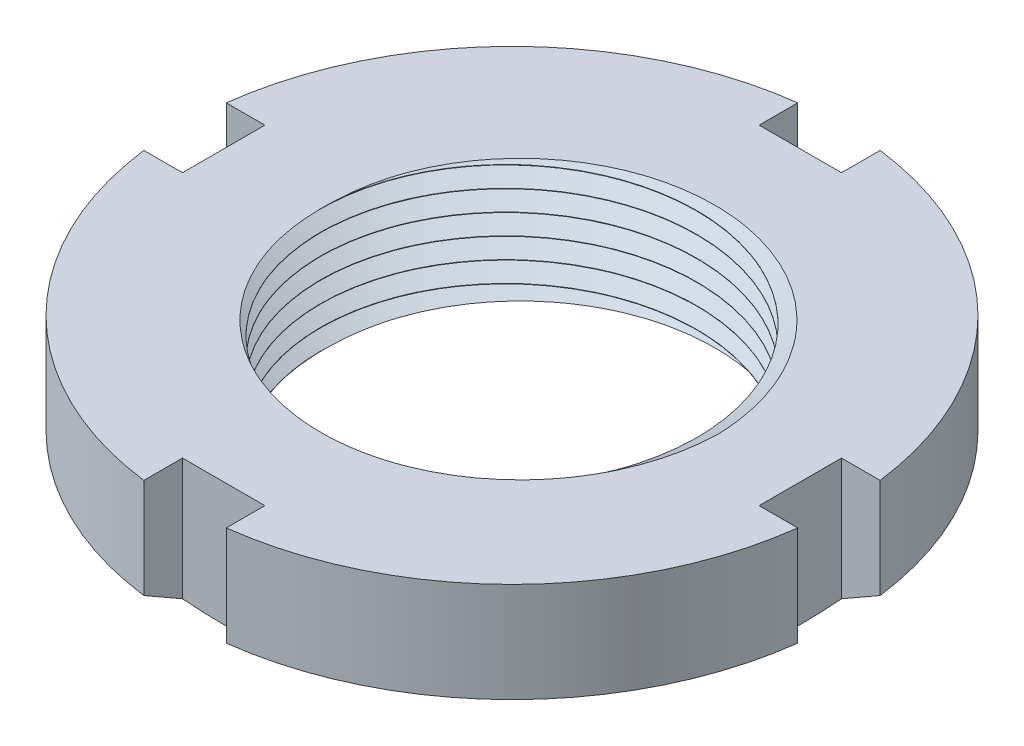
ISO-10303-21;
HEADER;
FILE_DESCRIPTION(('STEP AP214'),'2;1');
FILE_NAME('part.step','',(''),(''),'','','');
FILE_SCHEMA(('AUTOMOTIVE_DESIGN { 1 0 10303 214 1 1 1 1 }'));
ENDSEC;
DATA;
#1=APPLICATION_CONTEXT('core data for automotive mechanical design processes');
#2=APPLICATION_PROTOCOL_DEFINITION('international standard','automotive_design',2000,#1);
#3=PRODUCT_CONTEXT('',#1,'mechanical');
#4=PRODUCT('Part','Part','',(#3));
#5=PRODUCT_RELATED_PRODUCT_CATEGORY('part','',(#4));
#6=PRODUCT_DEFINITION_FORMATION('','',#4);
#7=PRODUCT_DEFINITION_CONTEXT('part definition',#1,'design');
#8=PRODUCT_DEFINITION('design','',#6,#7);
#9=PRODUCT_DEFINITION_SHAPE('','',#8);
#10=(LENGTH_UNIT() NAMED_UNIT(*) SI_UNIT(.MILLI.,.METRE.));
#11=(NAMED_UNIT(*) PLANE_ANGLE_UNIT() SI_UNIT($,.RADIAN.));
#12=(NAMED_UNIT(*) SI_UNIT($,.STERADIAN.) SOLID_ANGLE_UNIT());
#13=UNCERTAINTY_MEASURE_WITH_UNIT(LENGTH_MEASURE(1.E-05),#10,'distance_accuracy_value','');
#14=(GEOMETRIC_REPRESENTATION_CONTEXT(3) GLOBAL_UNCERTAINTY_ASSIGNED_CONTEXT((#13)) GLOBAL_UNIT_ASSIGNED_CONTEXT((#10,
#11,#12)) REPRESENTATION_CONTEXT('',''));
#15=CARTESIAN_POINT('',(0.,0.,0.));
#16=DIRECTION('',(0.,0.,1.));
#17=DIRECTION('',(1.,0.,0.));
#18=AXIS2_PLACEMENT_3D('',#15,#16,#17);
#19=CARTESIAN_POINT('',(9.13397459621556,6.,0.));
#20=DIRECTION('',(0.,1.,0.));
#21=DIRECTION('',(0.,0.,1.));
#22=AXIS2_PLACEMENT_3D('',#19,#20,#21);
#23=PLANE('',#22);
#24=CARTESIAN_POINT('',(0.,6.,0.));
#25=DIRECTION('',(0.,-1.,0.));
#26=DIRECTION('',(0.,0.,-1.));
#27=AXIS2_PLACEMENT_3D('',#24,#25,#26);
#28=CIRCLE('',#27,16.);
#29=CARTESIAN_POINT('',(15.8745078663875,6.,2.));
#30=VERTEX_POINT('',#29);
#31=CARTESIAN_POINT('',(2.,6.,15.8745078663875));
#32=VERTEX_POINT('',#31);
#33=EDGE_CURVE('E465',#30,#32,#28,.T.);
#34=ORIENTED_EDGE('',*,*,#33,.F.);
#35=DIRECTION('',(-1.,0.,0.));
#36=VECTOR('',#35,1.);
#37=CARTESIAN_POINT('',(16.,6.,2.));
#38=LINE('',#37,#36);
#39=CARTESIAN_POINT('',(14.,6.,2.00000000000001));
#40=VERTEX_POINT('',#39);
#41=EDGE_CURVE('E205',#30,#40,#38,.T.);
#42=ORIENTED_EDGE('',*,*,#41,.T.);
#43=DIRECTION('',(0.,0.,-1.));
#44=VECTOR('',#43,1.);
#45=CARTESIAN_POINT('',(14.,6.,2.00000000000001));
#46=LINE('',#45,#44);
#47=CARTESIAN_POINT('',(14.,6.,-2.));
#48=VERTEX_POINT('',#47);
#49=EDGE_CURVE('E208',#40,#48,#46,.T.);
#50=ORIENTED_EDGE('',*,*,#49,.T.);
#51=DIRECTION('',(1.,0.,0.));
#52=VECTOR('',#51,1.);
#53=CARTESIAN_POINT('',(16.,6.,-1.99999999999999));
#54=LINE('',#53,#52);
#55=CARTESIAN_POINT('',(15.8745078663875,6.,-2.));
#56=VERTEX_POINT('',#55);
#57=EDGE_CURVE('E526',#48,#56,#54,.T.);
#58=ORIENTED_EDGE('',*,*,#57,.T.);
#59=CARTESIAN_POINT('',(2.,6.,-15.8745078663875));
#60=VERTEX_POINT('',#59);
#61=EDGE_CURVE('E463',#60,#56,#28,.T.);
#62=ORIENTED_EDGE('',*,*,#61,.F.);
#63=DIRECTION('',(0.,0.,1.));
#64=VECTOR('',#63,1.);
#65=CARTESIAN_POINT('',(2.,6.,-16.));
#66=LINE('',#65,#64);
#67=CARTESIAN_POINT('',(2.,6.,-14.));
#68=VERTEX_POINT('',#67);
#69=EDGE_CURVE('E415',#60,#68,#66,.T.);
#70=ORIENTED_EDGE('',*,*,#69,.T.);
#71=DIRECTION('',(-1.,0.,0.));
#72=VECTOR('',#71,1.);
#73=CARTESIAN_POINT('',(2.,6.,-14.));
#74=LINE('',#73,#72);
#75=CARTESIAN_POINT('',(-2.,6.,-14.));
#76=VERTEX_POINT('',#75);
#77=EDGE_CURVE('E420',#68,#76,#74,.T.);
#78=ORIENTED_EDGE('',*,*,#77,.T.);
#79=DIRECTION('',(0.,0.,-1.));
#80=VECTOR('',#79,1.);
#81=CARTESIAN_POINT('',(-2.,6.,-16.));
#82=LINE('',#81,#80);
#83=CARTESIAN_POINT('',(-2.,6.,-15.8745078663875));
#84=VERTEX_POINT('',#83);
#85=EDGE_CURVE('E423',#76,#84,#82,.T.);
#86=ORIENTED_EDGE('',*,*,#85,.T.);
#87=CARTESIAN_POINT('',(-15.8745078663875,6.,-2.));
#88=VERTEX_POINT('',#87);
#89=EDGE_CURVE('E460',#88,#84,#28,.T.);
#90=ORIENTED_EDGE('',*,*,#89,.F.);
#91=DIRECTION('',(1.,0.,0.));
#92=VECTOR('',#91,1.);
#93=CARTESIAN_POINT('',(-16.,6.,-2.));
#94=LINE('',#93,#92);
#95=CARTESIAN_POINT('',(-14.,6.,-2.));
#96=VERTEX_POINT('',#95);
#97=EDGE_CURVE('E359',#88,#96,#94,.T.);
#98=ORIENTED_EDGE('',*,*,#97,.T.);
#99=DIRECTION('',(0.,0.,1.));
#100=VECTOR('',#99,1.);
#101=CARTESIAN_POINT('',(-14.,6.,2.));
#102=LINE('',#101,#100);
#103=CARTESIAN_POINT('',(-14.,6.,2.));
#104=VERTEX_POINT('',#103);
#105=EDGE_CURVE('E353',#96,#104,#102,.T.);
#106=ORIENTED_EDGE('',*,*,#105,.T.);
#107=DIRECTION('',(-1.,0.,0.));
#108=VECTOR('',#107,1.);
#109=CARTESIAN_POINT('',(-16.,6.,2.));
#110=LINE('',#109,#108);
#111=CARTESIAN_POINT('',(-15.8745078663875,6.,2.));
#112=VERTEX_POINT('',#111);
#113=EDGE_CURVE('E356',#104,#112,#110,.T.);
#114=ORIENTED_EDGE('',*,*,#113,.T.);
#115=CARTESIAN_POINT('',(-2.,6.,15.8745078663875));
#116=VERTEX_POINT('',#115);
#117=EDGE_CURVE('E466',#116,#112,#28,.T.);
#118=ORIENTED_EDGE('',*,*,#117,.F.);
#119=DIRECTION('',(0.,0.,-1.));
#120=VECTOR('',#119,1.);
#121=CARTESIAN_POINT('',(-2.,6.,16.));
#122=LINE('',#121,#120);
#123=CARTESIAN_POINT('',(-2.,6.,14.));
#124=VERTEX_POINT('',#123);
#125=EDGE_CURVE('E383',#116,#124,#122,.T.);
#126=ORIENTED_EDGE('',*,*,#125,.T.);
#127=DIRECTION('',(1.,0.,0.));
#128=VECTOR('',#127,1.);
#129=CARTESIAN_POINT('',(2.,6.,14.));
#130=LINE('',#129,#128);
#131=CARTESIAN_POINT('',(2.,6.,14.));
#132=VERTEX_POINT('',#131);
#133=EDGE_CURVE('E388',#124,#132,#130,.T.);
#134=ORIENTED_EDGE('',*,*,#133,.T.);
#135=DIRECTION('',(0.,0.,1.));
#136=VECTOR('',#135,1.);
#137=CARTESIAN_POINT('',(2.,6.,16.));
#138=LINE('',#137,#136);
#139=EDGE_CURVE('E391',#132,#32,#138,.T.);
#140=ORIENTED_EDGE('',*,*,#139,.T.);
#141=EDGE_LOOP('',(#34,#42,#50,#58,#62,#70,#78,#86,#90,#98,#106,#114,#118,#126,#134,#140));
#142=FACE_BOUND('',#141,.T.);
#143=CARTESIAN_POINT('',(0.,6.,0.));
#144=DIRECTION('',(0.,-1.,0.));
#145=DIRECTION('',(0.,0.,-1.));
#146=AXIS2_PLACEMENT_3D('',#143,#144,#145);
#147=CIRCLE('',#146,9.13397459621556);
#148=CARTESIAN_POINT('',(-9.11432518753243,6.,0.598805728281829));
#149=VERTEX_POINT('',#148);
#150=CARTESIAN_POINT('',(-9.11432518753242,6.,-0.598805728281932));
#151=VERTEX_POINT('',#150);
#152=EDGE_CURVE('E204',#149,#151,#147,.T.);
#153=ORIENTED_EDGE('',*,*,#152,.T.);
#154=CARTESIAN_POINT('',(-9.11954180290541,5.99999999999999,-0.159741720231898));
#155=CARTESIAN_POINT('',(-9.12169182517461,6.,-0.340239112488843));
#156=CARTESIAN_POINT('',(-9.11854523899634,6.,-0.52074835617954));
#157=CARTESIAN_POINT('',(-9.10167403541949,6.,-0.881235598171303));
#158=CARTESIAN_POINT('',(-9.08795153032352,6.,-1.06121369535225));
#159=CARTESIAN_POINT('',(-9.03089573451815,6.,-1.60005510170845));
#160=CARTESIAN_POINT('',(-8.97166908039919,6.,-1.95739303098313));
#161=CARTESIAN_POINT('',(-8.83438499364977,6.,-2.56271590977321));
#162=CARTESIAN_POINT('',(-8.76638270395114,6.,-2.81305971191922));
#163=CARTESIAN_POINT('',(-8.60951149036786,6.,-3.30722715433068));
#164=CARTESIAN_POINT('',(-8.52063806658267,6.,-3.55104937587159));
#165=CARTESIAN_POINT('',(-8.32265711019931,6.,-4.03035650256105));
#166=CARTESIAN_POINT('',(-8.21354716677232,6.,-4.26584041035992));
#167=CARTESIAN_POINT('',(-7.97587536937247,6.,-4.72678182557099));
#168=CARTESIAN_POINT('',(-7.84731370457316,6.,-4.95223943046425));
#169=CARTESIAN_POINT('',(-7.57171493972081,6.,-5.39142054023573));
#170=CARTESIAN_POINT('',(-7.42468556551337,6.,-5.60514889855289));
#171=CARTESIAN_POINT('',(-7.11313800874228,6.,-6.0195011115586));
#172=CARTESIAN_POINT('',(-6.9486198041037,6.,-6.22012494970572));
#173=CARTESIAN_POINT('',(-6.68961277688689,6.,-6.51008127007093));
#174=CARTESIAN_POINT('',(-6.60121855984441,6.,-6.60492261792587));
#175=CARTESIAN_POINT('',(-6.42059969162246,6.,-6.79088178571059));
#176=CARTESIAN_POINT('',(-6.3283750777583,6.,-6.88199964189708));
#177=CARTESIAN_POINT('',(-6.0461890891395,6.,-7.14954164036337));
#178=CARTESIAN_POINT('',(-5.85068641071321,6.,-7.32018680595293));
#179=CARTESIAN_POINT('',(-5.4444140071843,6.,-7.64633015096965));
#180=CARTESIAN_POINT('',(-5.23351734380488,6.,-7.80166975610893));
#181=CARTESIAN_POINT('',(-4.79955372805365,6.,-8.09429961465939));
#182=CARTESIAN_POINT('',(-4.5764871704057,6.,-8.23159045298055));
#183=CARTESIAN_POINT('',(-4.11976501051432,6.,-8.48714954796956));
#184=CARTESIAN_POINT('',(-3.88611129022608,6.,-8.60542116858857));
#185=CARTESIAN_POINT('',(-3.40979024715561,6.,-8.82215688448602));
#186=CARTESIAN_POINT('',(-3.1671228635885,6.,-8.92062084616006));
#187=CARTESIAN_POINT('',(-2.67085624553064,6.,-9.09834628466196));
#188=CARTESIAN_POINT('',(-2.41714926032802,6.,-9.17730714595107));
#189=CARTESIAN_POINT('',(-1.90400224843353,6.,-9.31357602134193));
#190=CARTESIAN_POINT('',(-1.64456235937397,6.,-9.37088455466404));
#191=CARTESIAN_POINT('',(-1.12169938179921,6.,-9.46345317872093));
#192=CARTESIAN_POINT('',(-0.858275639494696,6.,-9.49870960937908));
#193=CARTESIAN_POINT('',(-0.461679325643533,6.,-9.53486356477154));
#194=CARTESIAN_POINT('',(-0.329220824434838,6.,-9.54412654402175));
#195=CARTESIAN_POINT('',(-0.0640297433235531,6.,-9.55705304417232));
#196=CARTESIAN_POINT('',(0.0687028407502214,6.,-9.56071647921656));
#197=CARTESIAN_POINT('',(0.467083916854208,6.,-9.56350819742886));
#198=CARTESIAN_POINT('',(0.732835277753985,6.,-9.55443069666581));
#199=CARTESIAN_POINT('',(1.26265254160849,6.,-9.51441015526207));
#200=CARTESIAN_POINT('',(1.5267184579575,6.,-9.48346728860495));
#201=CARTESIAN_POINT('',(2.05143334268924,6.,-9.39993499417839));
#202=CARTESIAN_POINT('',(2.31208205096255,6.,-9.34734392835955));
#203=CARTESIAN_POINT('',(2.82815841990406,6.,-9.22086913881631));
#204=CARTESIAN_POINT('',(3.08358606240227,6.,-9.14698534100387));
#205=CARTESIAN_POINT('',(3.59323691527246,6.,-8.97650341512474));
#206=CARTESIAN_POINT('',(3.84729991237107,6.,-8.87942585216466));
#207=CARTESIAN_POINT('',(4.34635011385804,6.,-8.6642078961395));
#208=CARTESIAN_POINT('',(4.59133700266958,6.,-8.54606677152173));
#209=CARTESIAN_POINT('',(5.0704453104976,6.,-8.28958445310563));
#210=CARTESIAN_POINT('',(5.30456865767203,6.,-8.15124686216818));
#211=CARTESIAN_POINT('',(5.76032430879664,6.,-7.85535039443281));
#212=CARTESIAN_POINT('',(5.98195662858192,6.,-7.69779154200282));
#213=CARTESIAN_POINT('',(6.41101899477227,6.,-7.36466459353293));
#214=CARTESIAN_POINT('',(6.61845985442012,6.,-7.18911046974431));
#215=CARTESIAN_POINT('',(6.91794962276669,6.,-6.91321601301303));
#216=CARTESIAN_POINT('',(7.01584455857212,6.,-6.8191461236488));
#217=CARTESIAN_POINT('',(7.20770347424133,6.,-6.62706314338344));
#218=CARTESIAN_POINT('',(7.30166708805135,6.,-6.5290496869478));
#219=CARTESIAN_POINT('',(7.57747372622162,6.,-6.22921457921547));
#220=CARTESIAN_POINT('',(7.75316044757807,6.,-6.02166465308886));
#221=CARTESIAN_POINT('',(8.08681778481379,6.,-5.59284258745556));
#222=CARTESIAN_POINT('',(8.24478929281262,6.,-5.37157113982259));
#223=CARTESIAN_POINT('',(8.54450913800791,6.,-4.9128928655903));
#224=CARTESIAN_POINT('',(8.68593588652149,6.,-4.6752756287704));
#225=CARTESIAN_POINT('',(8.94839093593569,6.,-4.18903390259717));
#226=CARTESIAN_POINT('',(9.06941930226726,6.,-3.94040944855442));
#227=CARTESIAN_POINT('',(9.29004494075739,6.,-3.43432707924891));
#228=CARTESIAN_POINT('',(9.38967760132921,6.,-3.17688457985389));
#229=CARTESIAN_POINT('',(9.56703058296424,6.,-2.65467588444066));
#230=CARTESIAN_POINT('',(9.64476183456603,6.,-2.3899134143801));
#231=CARTESIAN_POINT('',(9.75421586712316,6.,-1.94979918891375));
#232=CARTESIAN_POINT('',(9.79247828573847,6.,-1.77604415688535));
#233=CARTESIAN_POINT('',(9.85955074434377,6.,-1.42685153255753));
#234=CARTESIAN_POINT('',(9.88836826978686,6.,-1.25141538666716));
#235=CARTESIAN_POINT('',(9.93678927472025,6.,-0.897152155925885));
#236=CARTESIAN_POINT('',(9.95627908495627,6.,-0.718309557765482));
#237=CARTESIAN_POINT('',(9.98549167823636,6.,-0.359689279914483));
#238=CARTESIAN_POINT('',(9.99520689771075,6.,-0.179910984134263));
#239=CARTESIAN_POINT('',(10.,6.,0.));
#240=B_SPLINE_CURVE_WITH_KNOTS('',3,(#154,#155,#156,#157,#158,#159,#160,#161,#162,#163,#164,
#165,#166,#167,#168,#169,#170,#171,#172,#173,#174,#175,#176,#177,#178,#179,#180,#181,#182,#183,
#184,#185,#186,#187,#188,#189,#190,#191,#192,#193,#194,#195,#196,#197,#198,#199,#200,#201,#202,
#203,#204,#205,#206,#207,#208,#209,#210,#211,#212,#213,#214,#215,#216,#217,#218,#219,#220,#221,
#222,#223,#224,#225,#226,#227,#228,#229,#230,#231,#232,#233,#234,#235,#236,#237,#238,#239),
.UNSPECIFIED.,.F.,.F.,(4,2,2,2,2,2,2,2,2,2,2,2,2,2,2,2,2,2,2,2,2,2,2,2,2,2,2,2,2,2,2,2,2,2,2,2,
2,2,2,2,2,2,4),(0.,0.54135044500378,1.08259279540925,2.1663672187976,2.9437932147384,
3.72138698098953,4.49907344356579,5.27675234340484,6.05410698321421,6.83146260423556,
7.22030711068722,7.60914782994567,8.38669847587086,9.17160527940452,9.95648664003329,
10.7412290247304,11.5259767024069,12.3221557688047,13.1183157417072,13.9146078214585,
14.3128512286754,14.7111007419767,15.5078413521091,16.3045756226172,17.1013701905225,
17.8981675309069,18.7131300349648,19.5281208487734,20.3429664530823,21.1578110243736,
21.9720276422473,22.3792267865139,22.786463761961,23.6012309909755,24.4159571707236,
25.244539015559,26.0731182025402,26.9003161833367,27.7271005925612,28.2606213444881,
28.7937182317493,29.3331558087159,29.8730104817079),.UNSPECIFIED.);
#241=CARTESIAN_POINT('',(10.,6.,0.));
#242=VERTEX_POINT('',#241);
#243=EDGE_CURVE('E200',#151,#242,#240,.T.);
#244=ORIENTED_EDGE('',*,*,#243,.T.);
#245=CARTESIAN_POINT('',(10.,6.,0.));
#246=CARTESIAN_POINT('',(9.99519211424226,6.,0.180214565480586));
#247=CARTESIAN_POINT('',(9.98545814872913,6.,0.360254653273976));
#248=CARTESIAN_POINT('',(9.95616580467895,6.,0.719545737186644));
#249=CARTESIAN_POINT('',(9.93660677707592,6.,0.898796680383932));
#250=CARTESIAN_POINT('',(9.8631905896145,6.,1.43499893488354));
#251=CARTESIAN_POINT('',(9.79460327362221,5.99999999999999,1.79006588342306));
#252=CARTESIAN_POINT('',(9.63930085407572,5.99999999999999,2.40969750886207));
#253=CARTESIAN_POINT('',(9.56039990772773,6.,2.67627045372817));
#254=CARTESIAN_POINT('',(9.3804034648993,6.,3.20192846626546));
#255=CARTESIAN_POINT('',(9.2793024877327,6.,3.46101166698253));
#256=CARTESIAN_POINT('',(9.05559881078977,6.,3.96982786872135));
#257=CARTESIAN_POINT('',(8.93298801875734,6.,4.21955730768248));
#258=CARTESIAN_POINT('',(8.6671009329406,6.,4.707908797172));
#259=CARTESIAN_POINT('',(8.52381563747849,6.,4.94652594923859));
#260=CARTESIAN_POINT('',(8.21766782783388,6.,5.41079697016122));
#261=CARTESIAN_POINT('',(8.05480774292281,6.,5.63645244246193));
#262=CARTESIAN_POINT('',(7.71069482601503,6.,6.0731710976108));
#263=CARTESIAN_POINT('',(7.52944961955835,6.,6.28424026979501));
#264=CARTESIAN_POINT('',(7.24477121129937,6.,6.58879091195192));
#265=CARTESIAN_POINT('',(7.14772651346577,6.,6.68831411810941));
#266=CARTESIAN_POINT('',(6.94955817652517,6.,6.88316201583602));
#267=CARTESIAN_POINT('',(6.8484356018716,6.,6.97848778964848));
#268=CARTESIAN_POINT('',(6.53902140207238,6.,7.25778344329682));
#269=CARTESIAN_POINT('',(6.3246536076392,6.,7.4351035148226));
#270=CARTESIAN_POINT('',(5.88288910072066,6.,7.7695300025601));
#271=CARTESIAN_POINT('',(5.65558410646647,6.,7.9267580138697));
#272=CARTESIAN_POINT('',(5.18834229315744,6.,8.22117961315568));
#273=CARTESIAN_POINT('',(4.94840569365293,6.,8.35837354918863));
#274=CARTESIAN_POINT('',(4.4576389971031,6.,8.61173173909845));
#275=CARTESIAN_POINT('',(4.20680748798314,6.,8.72789325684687));
#276=CARTESIAN_POINT('',(3.69612752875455,6.,8.9383091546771));
#277=CARTESIAN_POINT('',(3.43627940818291,6.,9.03256433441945));
#278=CARTESIAN_POINT('',(2.91369858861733,6.,9.1971473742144));
#279=CARTESIAN_POINT('',(2.65107919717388,6.,9.2678351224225));
#280=CARTESIAN_POINT('',(2.12082360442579,6.,9.38683458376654));
#281=CARTESIAN_POINT('',(1.85318732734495,6.,9.43514595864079));
#282=CARTESIAN_POINT('',(1.31478329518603,6.,9.50905014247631));
#283=CARTESIAN_POINT('',(1.04401582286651,6.,9.53464498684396));
#284=CARTESIAN_POINT('',(0.637046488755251,6.,9.55585390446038));
#285=CARTESIAN_POINT('',(0.501239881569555,6.,9.56005920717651));
#286=CARTESIAN_POINT('',(0.229559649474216,6.,9.56276504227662));
#287=CARTESIAN_POINT('',(0.0936860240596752,6.,9.56126553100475));
#288=CARTESIAN_POINT('',(-0.177983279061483,6.,9.5524470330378));
#289=CARTESIAN_POINT('',(-0.313778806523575,6.,9.54512337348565));
#290=CARTESIAN_POINT('',(-0.584910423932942,6.,9.52461155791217));
#291=CARTESIAN_POINT('',(-0.720246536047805,6.,9.51142368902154));
#292=CARTESIAN_POINT('',(-1.12520739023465,6.,9.46311232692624));
#293=CARTESIAN_POINT('',(-1.39384337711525,6.,9.41923916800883));
#294=CARTESIAN_POINT('',(-1.92619466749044,6.,9.30850474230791));
#295=CARTESIAN_POINT('',(-2.18991168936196,6.,9.2416516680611));
#296=CARTESIAN_POINT('',(-2.71072710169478,6.,9.08541433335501));
#297=CARTESIAN_POINT('',(-2.96782245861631,6.,8.99601994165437));
#298=CARTESIAN_POINT('',(-3.46741057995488,6.,8.79773534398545));
#299=CARTESIAN_POINT('',(-3.71010434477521,6.,8.68935098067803));
#300=CARTESIAN_POINT('',(-4.18538538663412,6.,8.45257270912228));
#301=CARTESIAN_POINT('',(-4.41797737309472,6.,8.32418825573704));
#302=CARTESIAN_POINT('',(-4.87159822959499,6.,8.0482381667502));
#303=CARTESIAN_POINT('',(-5.09262323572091,6.,7.90066617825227));
#304=CARTESIAN_POINT('',(-5.52145780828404,6.,7.58742446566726));
#305=CARTESIAN_POINT('',(-5.72926676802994,6.,7.42175391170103));
#306=CARTESIAN_POINT('',(-6.13030641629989,6.,7.07338973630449));
#307=CARTESIAN_POINT('',(-6.32353025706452,6.,6.89068820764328));
#308=CARTESIAN_POINT('',(-6.60124876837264,6.,6.60495675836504));
#309=CARTESIAN_POINT('',(-6.69180957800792,6.,6.507757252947));
#310=CARTESIAN_POINT('',(-6.8686356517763,6.,6.30952358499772));
#311=CARTESIAN_POINT('',(-6.95490086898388,6.,6.20848938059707));
#312=CARTESIAN_POINT('',(-7.20700537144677,6.,5.89997051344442));
#313=CARTESIAN_POINT('',(-7.36621666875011,6.,5.68700463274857));
#314=CARTESIAN_POINT('',(-7.66564317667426,6.,5.24815319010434));
#315=CARTESIAN_POINT('',(-7.80585836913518,6.,5.02226761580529));
#316=CARTESIAN_POINT('',(-8.06415649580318,6.,4.56300760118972));
#317=CARTESIAN_POINT('',(-8.18256275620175,6.,4.3298150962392));
#318=CARTESIAN_POINT('',(-8.39914924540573,6.,3.85422172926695));
#319=CARTESIAN_POINT('',(-8.49732954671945,6.,3.61182090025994));
#320=CARTESIAN_POINT('',(-8.67270980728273,6.,3.11968781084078));
#321=CARTESIAN_POINT('',(-8.74992085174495,6.,2.86995950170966));
#322=CARTESIAN_POINT('',(-8.88285543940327,6.,2.36493901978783));
#323=CARTESIAN_POINT('',(-8.93858585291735,6.,2.10964865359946));
#324=CARTESIAN_POINT('',(-9.03206429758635,6.,1.57295765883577));
#325=CARTESIAN_POINT('',(-9.06783638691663,6.,1.29121091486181));
#326=CARTESIAN_POINT('',(-9.11325926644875,6.,0.726166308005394));
#327=CARTESIAN_POINT('',(-9.12296015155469,6.00000000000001,0.442872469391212));
#328=CARTESIAN_POINT('',(-9.11954180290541,6.00000000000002,0.159741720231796));
#329=B_SPLINE_CURVE_WITH_KNOTS('',3,(#245,#246,#247,#248,#249,#250,#251,#252,#253,#254,#255,
#256,#257,#258,#259,#260,#261,#262,#263,#264,#265,#266,#267,#268,#269,#270,#271,#272,#273,#274,
#275,#276,#277,#278,#279,#280,#281,#282,#283,#284,#285,#286,#287,#288,#289,#290,#291,#292,#293,
#294,#295,#296,#297,#298,#299,#300,#301,#302,#303,#304,#305,#306,#307,#308,#309,#310,#311,#312,
#313,#314,#315,#316,#317,#318,#319,#320,#321,#322,#323,#324,#325,#326,#327,#328),.UNSPECIFIED.,
.F.,.F.,(4,2,2,2,2,2,2,2,2,2,2,2,2,2,2,2,2,2,2,2,2,2,2,2,2,2,2,2,2,2,2,2,2,2,2,2,2,2,2,2,2,4),
(0.,0.540682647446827,1.08140101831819,2.16383418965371,2.99694844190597,3.83026860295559,
4.66390294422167,5.49790135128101,6.33179636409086,7.16534690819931,7.58225756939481,
7.99906009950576,8.83253494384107,9.66069919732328,10.4888490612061,11.3171065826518,
12.1453338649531,12.9602627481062,13.775203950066,14.5900721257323,14.9975888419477,
15.4051086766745,15.8129558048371,16.2207829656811,17.0362616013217,17.8514498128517,
18.6670050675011,19.4634525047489,20.2595245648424,21.0558608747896,21.8522337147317,
22.6489781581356,23.0474212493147,23.4458686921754,24.2424926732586,25.0391174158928,
25.8227651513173,26.6064100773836,27.3896399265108,28.1726190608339,29.0234244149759,
29.8725938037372),.UNSPECIFIED.);
#330=EDGE_CURVE('E188',#242,#149,#329,.T.);
#331=ORIENTED_EDGE('',*,*,#330,.T.);
#332=EDGE_LOOP('',(#153,#244,#331));
#333=FACE_BOUND('',#332,.T.);
#334=ADVANCED_FACE('F42',(#142,#333),#23,.T.);
#335=CARTESIAN_POINT('',(0.,0.,0.));
#336=DIRECTION('',(0.,-1.,0.));
#337=DIRECTION('',(0.,0.,-1.));
#338=AXIS2_PLACEMENT_3D('',#335,#336,#337);
#339=CYLINDRICAL_SURFACE('',#338,9.13397459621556);
#340=CARTESIAN_POINT('',(0.,0.,0.));
#341=DIRECTION('',(0.,-1.,0.));
#342=DIRECTION('',(0.,0.,-1.));
#343=AXIS2_PLACEMENT_3D('',#340,#341,#342);
#344=CIRCLE('',#343,9.13397459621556);
#345=CARTESIAN_POINT('',(-9.11432518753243,0.,0.598805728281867));
#346=VERTEX_POINT('',#345);
#347=CARTESIAN_POINT('',(-9.11432518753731,0.,-0.598805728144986));
#348=VERTEX_POINT('',#347);
#349=EDGE_CURVE('E445',#346,#348,#344,.T.);
#350=ORIENTED_EDGE('',*,*,#349,.T.);
#351=CARTESIAN_POINT('',(9.13397459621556,-1.48997359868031,0.));
#352=CARTESIAN_POINT('',(9.13397459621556,-1.42747359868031,-3.7834161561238));
#353=CARTESIAN_POINT('',(6.45869537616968,-1.36497359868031,-6.45869537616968));
#354=CARTESIAN_POINT('',(3.7834161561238,-1.30247359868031,-9.13397459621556));
#355=CARTESIAN_POINT('',(0.,-1.23997359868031,-9.13397459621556));
#356=CARTESIAN_POINT('',(-3.7834161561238,-1.17747359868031,-9.13397459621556));
#357=CARTESIAN_POINT('',(-6.45869537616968,-1.11497359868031,-6.45869537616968));
#358=CARTESIAN_POINT('',(-9.13397459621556,-1.05247359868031,-3.7834161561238));
#359=CARTESIAN_POINT('',(-9.13397459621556,-0.989973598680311,0.));
#360=CARTESIAN_POINT('',(-9.13397459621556,-0.927473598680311,3.7834161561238));
#361=CARTESIAN_POINT('',(-6.45869537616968,-0.864973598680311,6.45869537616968));
#362=CARTESIAN_POINT('',(-3.78341615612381,-0.802473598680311,9.13397459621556));
#363=CARTESIAN_POINT('',(0.,-0.739973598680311,9.13397459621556));
#364=CARTESIAN_POINT('',(3.7834161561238,-0.677473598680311,9.13397459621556));
#365=CARTESIAN_POINT('',(6.45869537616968,-0.614973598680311,6.45869537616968));
#366=CARTESIAN_POINT('',(9.13397459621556,-0.552473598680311,3.78341615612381));
#367=CARTESIAN_POINT('',(9.13397459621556,-0.489973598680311,0.));
#368=CARTESIAN_POINT('',(9.13397459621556,-0.427473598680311,-3.7834161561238));
#369=CARTESIAN_POINT('',(6.45869537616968,-0.364973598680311,-6.45869537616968));
#370=CARTESIAN_POINT('',(3.7834161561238,-0.302473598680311,-9.13397459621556));
#371=CARTESIAN_POINT('',(0.,-0.239973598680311,-9.13397459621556));
#372=CARTESIAN_POINT('',(-3.7834161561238,-0.177473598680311,-9.13397459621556));
#373=CARTESIAN_POINT('',(-6.45869537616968,-0.114973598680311,-6.45869537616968));
#374=CARTESIAN_POINT('',(-9.13397459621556,-0.0524735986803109,-3.7834161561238));
#375=CARTESIAN_POINT('',(-9.13397459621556,0.0100264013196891,0.));
#376=CARTESIAN_POINT('',(-9.13397459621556,0.0725264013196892,3.7834161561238));
#377=CARTESIAN_POINT('',(-6.45869537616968,0.135026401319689,6.45869537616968));
#378=CARTESIAN_POINT('',(-3.78341615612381,0.197526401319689,9.13397459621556));
#379=CARTESIAN_POINT('',(0.,0.260026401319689,9.13397459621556));
#380=CARTESIAN_POINT('',(3.7834161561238,0.322526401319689,9.13397459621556));
#381=CARTESIAN_POINT('',(6.45869537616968,0.385026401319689,6.45869537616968));
#382=CARTESIAN_POINT('',(9.13397459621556,0.447526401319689,3.78341615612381));
#383=CARTESIAN_POINT('',(9.13397459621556,0.510026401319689,0.));
#384=CARTESIAN_POINT('',(9.13397459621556,0.572526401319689,-3.7834161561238));
#385=CARTESIAN_POINT('',(6.45869537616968,0.635026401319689,-6.45869537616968));
#386=CARTESIAN_POINT('',(3.7834161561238,0.697526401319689,-9.13397459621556));
#387=CARTESIAN_POINT('',(0.,0.760026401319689,-9.13397459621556));
#388=CARTESIAN_POINT('',(-3.7834161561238,0.822526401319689,-9.13397459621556));
#389=CARTESIAN_POINT('',(-6.45869537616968,0.885026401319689,-6.45869537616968));
#390=CARTESIAN_POINT('',(-9.13397459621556,0.947526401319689,-3.7834161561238));
#391=CARTESIAN_POINT('',(-9.13397459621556,1.01002640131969,0.));
#392=CARTESIAN_POINT('',(-9.13397459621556,1.07252640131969,3.7834161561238));
#393=CARTESIAN_POINT('',(-6.45869537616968,1.13502640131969,6.45869537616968));
#394=CARTESIAN_POINT('',(-3.78341615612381,1.19752640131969,9.13397459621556));
#395=CARTESIAN_POINT('',(0.,1.26002640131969,9.13397459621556));
#396=CARTESIAN_POINT('',(3.7834161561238,1.32252640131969,9.13397459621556));
#397=CARTESIAN_POINT('',(6.45869537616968,1.38502640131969,6.45869537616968));
#398=CARTESIAN_POINT('',(9.13397459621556,1.44752640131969,3.78341615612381));
#399=CARTESIAN_POINT('',(9.13397459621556,1.51002640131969,0.));
#400=CARTESIAN_POINT('',(9.13397459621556,1.57252640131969,-3.7834161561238));
#401=CARTESIAN_POINT('',(6.45869537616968,1.63502640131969,-6.45869537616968));
#402=CARTESIAN_POINT('',(3.7834161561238,1.69752640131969,-9.13397459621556));
#403=CARTESIAN_POINT('',(0.,1.76002640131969,-9.13397459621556));
#404=CARTESIAN_POINT('',(-3.7834161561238,1.82252640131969,-9.13397459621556));
#405=CARTESIAN_POINT('',(-6.45869537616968,1.88502640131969,-6.45869537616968));
#406=CARTESIAN_POINT('',(-9.13397459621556,1.94752640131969,-3.7834161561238));
#407=CARTESIAN_POINT('',(-9.13397459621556,2.01002640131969,0.));
#408=CARTESIAN_POINT('',(-9.13397459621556,2.07252640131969,3.7834161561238));
#409=CARTESIAN_POINT('',(-6.45869537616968,2.13502640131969,6.45869537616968));
#410=CARTESIAN_POINT('',(-3.78341615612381,2.19752640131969,9.13397459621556));
#411=CARTESIAN_POINT('',(0.,2.26002640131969,9.13397459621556));
#412=CARTESIAN_POINT('',(3.7834161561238,2.32252640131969,9.13397459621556));
#413=CARTESIAN_POINT('',(6.45869537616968,2.38502640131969,6.45869537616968));
#414=CARTESIAN_POINT('',(9.13397459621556,2.44752640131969,3.78341615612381));
#415=CARTESIAN_POINT('',(9.13397459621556,2.51002640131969,0.));
#416=CARTESIAN_POINT('',(9.13397459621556,2.57252640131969,-3.7834161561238));
#417=CARTESIAN_POINT('',(6.45869537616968,2.63502640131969,-6.45869537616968));
#418=CARTESIAN_POINT('',(3.7834161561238,2.69752640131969,-9.13397459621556));
#419=CARTESIAN_POINT('',(0.,2.76002640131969,-9.13397459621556));
#420=CARTESIAN_POINT('',(-3.7834161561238,2.82252640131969,-9.13397459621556));
#421=CARTESIAN_POINT('',(-6.45869537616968,2.88502640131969,-6.45869537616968));
#422=CARTESIAN_POINT('',(-9.13397459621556,2.94752640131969,-3.7834161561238));
#423=CARTESIAN_POINT('',(-9.13397459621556,3.01002640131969,0.));
#424=CARTESIAN_POINT('',(-9.13397459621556,3.07252640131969,3.7834161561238));
#425=CARTESIAN_POINT('',(-6.45869537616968,3.13502640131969,6.45869537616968));
#426=CARTESIAN_POINT('',(-3.78341615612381,3.19752640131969,9.13397459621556));
#427=CARTESIAN_POINT('',(0.,3.26002640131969,9.13397459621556));
#428=CARTESIAN_POINT('',(3.7834161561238,3.32252640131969,9.13397459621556));
#429=CARTESIAN_POINT('',(6.45869537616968,3.38502640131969,6.45869537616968));
#430=CARTESIAN_POINT('',(9.13397459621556,3.44752640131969,3.78341615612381));
#431=CARTESIAN_POINT('',(9.13397459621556,3.51002640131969,0.));
#432=CARTESIAN_POINT('',(9.13397459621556,3.57252640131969,-3.7834161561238));
#433=CARTESIAN_POINT('',(6.45869537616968,3.63502640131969,-6.45869537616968));
#434=CARTESIAN_POINT('',(3.7834161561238,3.69752640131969,-9.13397459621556));
#435=CARTESIAN_POINT('',(0.,3.76002640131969,-9.13397459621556));
#436=CARTESIAN_POINT('',(-3.7834161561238,3.82252640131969,-9.13397459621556));
#437=CARTESIAN_POINT('',(-6.45869537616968,3.88502640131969,-6.45869537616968));
#438=CARTESIAN_POINT('',(-9.13397459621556,3.94752640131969,-3.7834161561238));
#439=CARTESIAN_POINT('',(-9.13397459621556,4.01002640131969,0.));
#440=CARTESIAN_POINT('',(-9.13397459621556,4.07252640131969,3.7834161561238));
#441=CARTESIAN_POINT('',(-6.45869537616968,4.13502640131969,6.45869537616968));
#442=CARTESIAN_POINT('',(-3.78341615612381,4.19752640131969,9.13397459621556));
#443=CARTESIAN_POINT('',(0.,4.26002640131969,9.13397459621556));
#444=CARTESIAN_POINT('',(3.7834161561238,4.32252640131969,9.13397459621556));
#445=CARTESIAN_POINT('',(6.45869537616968,4.38502640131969,6.45869537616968));
#446=CARTESIAN_POINT('',(9.13397459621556,4.44752640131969,3.78341615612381));
#447=CARTESIAN_POINT('',(9.13397459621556,4.51002640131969,0.));
#448=CARTESIAN_POINT('',(9.13397459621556,4.57252640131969,-3.7834161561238));
#449=CARTESIAN_POINT('',(6.45869537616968,4.63502640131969,-6.45869537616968));
#450=CARTESIAN_POINT('',(3.7834161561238,4.69752640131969,-9.13397459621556));
#451=CARTESIAN_POINT('',(0.,4.76002640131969,-9.13397459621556));
#452=CARTESIAN_POINT('',(-3.7834161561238,4.82252640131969,-9.13397459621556));
#453=CARTESIAN_POINT('',(-6.45869537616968,4.88502640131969,-6.45869537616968));
#454=CARTESIAN_POINT('',(-9.13397459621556,4.94752640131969,-3.7834161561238));
#455=CARTESIAN_POINT('',(-9.13397459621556,5.01002640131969,0.));
#456=CARTESIAN_POINT('',(-9.13397459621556,5.07252640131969,3.7834161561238));
#457=CARTESIAN_POINT('',(-6.45869537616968,5.13502640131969,6.45869537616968));
#458=CARTESIAN_POINT('',(-3.78341615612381,5.19752640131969,9.13397459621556));
#459=CARTESIAN_POINT('',(0.,5.26002640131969,9.13397459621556));
#460=CARTESIAN_POINT('',(3.7834161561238,5.32252640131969,9.13397459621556));
#461=CARTESIAN_POINT('',(6.45869537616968,5.38502640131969,6.45869537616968));
#462=CARTESIAN_POINT('',(9.13397459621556,5.44752640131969,3.78341615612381));
#463=CARTESIAN_POINT('',(9.13397459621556,5.51002640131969,0.));
#464=CARTESIAN_POINT('',(9.13397459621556,5.57252640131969,-3.7834161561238));
#465=CARTESIAN_POINT('',(6.45869537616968,5.63502640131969,-6.45869537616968));
#466=CARTESIAN_POINT('',(3.7834161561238,5.69752640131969,-9.13397459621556));
#467=CARTESIAN_POINT('',(0.,5.76002640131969,-9.13397459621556));
#468=CARTESIAN_POINT('',(-3.7834161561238,5.82252640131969,-9.13397459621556));
#469=CARTESIAN_POINT('',(-6.45869537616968,5.88502640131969,-6.45869537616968));
#470=CARTESIAN_POINT('',(-9.13397459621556,5.94752640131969,-3.7834161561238));
#471=CARTESIAN_POINT('',(-9.13397459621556,6.01002640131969,0.));
#472=CARTESIAN_POINT('',(-9.13397459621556,6.07252640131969,3.7834161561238));
#473=CARTESIAN_POINT('',(-6.45869537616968,6.13502640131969,6.45869537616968));
#474=CARTESIAN_POINT('',(-3.78341615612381,6.19752640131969,9.13397459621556));
#475=CARTESIAN_POINT('',(0.,6.26002640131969,9.13397459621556));
#476=CARTESIAN_POINT('',(3.7834161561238,6.32252640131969,9.13397459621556));
#477=CARTESIAN_POINT('',(6.45869537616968,6.38502640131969,6.45869537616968));
#478=CARTESIAN_POINT('',(9.13397459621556,6.44752640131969,3.78341615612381));
#479=CARTESIAN_POINT('',(9.13397459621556,6.51002640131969,0.));
#480=(BOUNDED_CURVE() B_SPLINE_CURVE(2,(#351,#352,#353,#354,#355,#356,#357,#358,#359,#360,#361,
#362,#363,#364,#365,#366,#367,#368,#369,#370,#371,#372,#373,#374,#375,#376,#377,#378,#379,#380,
#381,#382,#383,#384,#385,#386,#387,#388,#389,#390,#391,#392,#393,#394,#395,#396,#397,#398,#399,
#400,#401,#402,#403,#404,#405,#406,#407,#408,#409,#410,#411,#412,#413,#414,#415,#416,#417,#418,
#419,#420,#421,#422,#423,#424,#425,#426,#427,#428,#429,#430,#431,#432,#433,#434,#435,#436,#437,
#438,#439,#440,#441,#442,#443,#444,#445,#446,#447,#448,#449,#450,#451,#452,#453,#454,#455,#456,
#457,#458,#459,#460,#461,#462,#463,#464,#465,#466,#467,#468,#469,#470,#471,#472,#473,#474,#475,
#476,#477,#478,#479),.UNSPECIFIED.,.F.,.F.) B_SPLINE_CURVE_WITH_KNOTS((3,2,2,2,2,2,2,2,2,2,2,2,
2,2,2,2,2,2,2,2,2,2,2,2,2,2,2,2,2,2,2,2,2,2,2,2,2,2,2,2,2,2,2,2,2,2,2,2,2,2,2,2,2,2,2,2,2,2,2,2,
2,2,2,2,3),(0.,0.015625,0.03125,0.046875,0.0625,0.078125,0.09375,0.109375,0.125,0.140625,
0.15625,0.171875,0.1875,0.203125,0.21875,0.234375,0.25,0.265625,0.28125,0.296875,0.3125,
0.328125,0.34375,0.359375,0.375,0.390625,0.40625,0.421875,0.4375,0.453125,0.46875,0.484375,0.5,
0.515625,0.53125,0.546875,0.5625,0.578125,0.59375,0.609375,0.625,0.640625,0.65625,0.671875,
0.6875,0.703125,0.71875,0.734375,0.75,0.765625,0.78125,0.796875,0.8125,0.828125,0.84375,
0.859375,0.875,0.890625,0.90625,0.921875,0.9375,0.953125,0.96875,0.984375,1.),
.UNSPECIFIED.) CURVE() GEOMETRIC_REPRESENTATION_ITEM() RATIONAL_B_SPLINE_CURVE((1.,
0.923879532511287,1.,0.923879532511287,1.,0.923879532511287,1.,0.923879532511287,1.,
0.923879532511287,1.,0.923879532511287,1.,0.923879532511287,1.,0.923879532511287,1.,
0.923879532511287,1.,0.923879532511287,1.,0.923879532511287,1.,0.923879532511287,1.,
0.923879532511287,1.,0.923879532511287,1.,0.923879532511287,1.,0.923879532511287,1.,
0.923879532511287,1.,0.923879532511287,1.,0.923879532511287,1.,0.923879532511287,1.,
0.923879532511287,1.,0.923879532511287,1.,0.923879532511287,1.,0.923879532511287,1.,
0.923879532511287,1.,0.923879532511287,1.,0.923879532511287,1.,0.923879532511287,1.,
0.923879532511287,1.,0.923879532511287,1.,0.923879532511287,1.,0.923879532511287,1.,
0.923879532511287,1.,0.923879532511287,1.,0.923879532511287,1.,0.923879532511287,1.,
0.923879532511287,1.,0.923879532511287,1.,0.923879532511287,1.,0.923879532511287,1.,
0.923879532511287,1.,0.923879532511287,1.,0.923879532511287,1.,0.923879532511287,1.,
0.923879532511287,1.,0.923879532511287,1.,0.923879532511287,1.,0.923879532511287,1.,
0.923879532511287,1.,0.923879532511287,1.,0.923879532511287,1.,0.923879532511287,1.,
0.923879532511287,1.,0.923879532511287,1.,0.923879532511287,1.,0.923879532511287,1.,
0.923879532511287,1.,0.923879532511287,1.,0.923879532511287,1.,0.923879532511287,1.,
0.923879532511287,1.,0.923879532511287,1.,0.923879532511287,1.,0.923879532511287,1.)) REPRESENTATION_ITEM(''));
#481=EDGE_CURVE('E196',#348,#151,#480,.T.);
#482=ORIENTED_EDGE('',*,*,#481,.T.);
#483=ORIENTED_EDGE('',*,*,#152,.F.);
#484=CARTESIAN_POINT('',(9.13397459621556,-0.510026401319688,0.));
#485=CARTESIAN_POINT('',(9.13397459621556,-0.447526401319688,-3.7834161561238));
#486=CARTESIAN_POINT('',(6.45869537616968,-0.385026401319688,-6.45869537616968));
#487=CARTESIAN_POINT('',(3.7834161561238,-0.322526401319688,-9.13397459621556));
#488=CARTESIAN_POINT('',(0.,-0.260026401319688,-9.13397459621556));
#489=CARTESIAN_POINT('',(-3.7834161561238,-0.197526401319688,-9.13397459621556));
#490=CARTESIAN_POINT('',(-6.45869537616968,-0.135026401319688,-6.45869537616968));
#491=CARTESIAN_POINT('',(-9.13397459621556,-0.0725264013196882,-3.7834161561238));
#492=CARTESIAN_POINT('',(-9.13397459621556,-0.0100264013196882,0.));
#493=CARTESIAN_POINT('',(-9.13397459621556,0.0524735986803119,3.7834161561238));
#494=CARTESIAN_POINT('',(-6.45869537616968,0.114973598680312,6.45869537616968));
#495=CARTESIAN_POINT('',(-3.78341615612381,0.177473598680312,9.13397459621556));
#496=CARTESIAN_POINT('',(0.,0.239973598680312,9.13397459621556));
#497=CARTESIAN_POINT('',(3.7834161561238,0.302473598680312,9.13397459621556));
#498=CARTESIAN_POINT('',(6.45869537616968,0.364973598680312,6.45869537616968));
#499=CARTESIAN_POINT('',(9.13397459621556,0.427473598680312,3.78341615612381));
#500=CARTESIAN_POINT('',(9.13397459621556,0.489973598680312,0.));
#501=CARTESIAN_POINT('',(9.13397459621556,0.552473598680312,-3.7834161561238));
#502=CARTESIAN_POINT('',(6.45869537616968,0.614973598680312,-6.45869537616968));
#503=CARTESIAN_POINT('',(3.7834161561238,0.677473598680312,-9.13397459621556));
#504=CARTESIAN_POINT('',(0.,0.739973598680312,-9.13397459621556));
#505=CARTESIAN_POINT('',(-3.7834161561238,0.802473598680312,-9.13397459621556));
#506=CARTESIAN_POINT('',(-6.45869537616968,0.864973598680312,-6.45869537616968));
#507=CARTESIAN_POINT('',(-9.13397459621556,0.927473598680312,-3.7834161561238));
#508=CARTESIAN_POINT('',(-9.13397459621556,0.989973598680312,0.));
#509=CARTESIAN_POINT('',(-9.13397459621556,1.05247359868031,3.7834161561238));
#510=CARTESIAN_POINT('',(-6.45869537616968,1.11497359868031,6.45869537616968));
#511=CARTESIAN_POINT('',(-3.78341615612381,1.17747359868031,9.13397459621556));
#512=CARTESIAN_POINT('',(0.,1.23997359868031,9.13397459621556));
#513=CARTESIAN_POINT('',(3.7834161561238,1.30247359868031,9.13397459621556));
#514=CARTESIAN_POINT('',(6.45869537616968,1.36497359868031,6.45869537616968));
#515=CARTESIAN_POINT('',(9.13397459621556,1.42747359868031,3.78341615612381));
#516=CARTESIAN_POINT('',(9.13397459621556,1.48997359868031,0.));
#517=CARTESIAN_POINT('',(9.13397459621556,1.55247359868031,-3.7834161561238));
#518=CARTESIAN_POINT('',(6.45869537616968,1.61497359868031,-6.45869537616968));
#519=CARTESIAN_POINT('',(3.7834161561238,1.67747359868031,-9.13397459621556));
#520=CARTESIAN_POINT('',(0.,1.73997359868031,-9.13397459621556));
#521=CARTESIAN_POINT('',(-3.7834161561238,1.80247359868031,-9.13397459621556));
#522=CARTESIAN_POINT('',(-6.45869537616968,1.86497359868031,-6.45869537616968));
#523=CARTESIAN_POINT('',(-9.13397459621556,1.92747359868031,-3.7834161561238));
#524=CARTESIAN_POINT('',(-9.13397459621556,1.98997359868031,0.));
#525=CARTESIAN_POINT('',(-9.13397459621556,2.05247359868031,3.7834161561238));
#526=CARTESIAN_POINT('',(-6.45869537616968,2.11497359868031,6.45869537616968));
#527=CARTESIAN_POINT('',(-3.78341615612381,2.17747359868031,9.13397459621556));
#528=CARTESIAN_POINT('',(0.,2.23997359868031,9.13397459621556));
#529=CARTESIAN_POINT('',(3.7834161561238,2.30247359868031,9.13397459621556));
#530=CARTESIAN_POINT('',(6.45869537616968,2.36497359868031,6.45869537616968));
#531=CARTESIAN_POINT('',(9.13397459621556,2.42747359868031,3.78341615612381));
#532=CARTESIAN_POINT('',(9.13397459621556,2.48997359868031,0.));
#533=CARTESIAN_POINT('',(9.13397459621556,2.55247359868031,-3.7834161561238));
#534=CARTESIAN_POINT('',(6.45869537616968,2.61497359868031,-6.45869537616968));
#535=CARTESIAN_POINT('',(3.7834161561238,2.67747359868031,-9.13397459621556));
#536=CARTESIAN_POINT('',(0.,2.73997359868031,-9.13397459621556));
#537=CARTESIAN_POINT('',(-3.7834161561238,2.80247359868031,-9.13397459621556));
#538=CARTESIAN_POINT('',(-6.45869537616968,2.86497359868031,-6.45869537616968));
#539=CARTESIAN_POINT('',(-9.13397459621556,2.92747359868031,-3.7834161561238));
#540=CARTESIAN_POINT('',(-9.13397459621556,2.98997359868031,0.));
#541=CARTESIAN_POINT('',(-9.13397459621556,3.05247359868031,3.7834161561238));
#542=CARTESIAN_POINT('',(-6.45869537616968,3.11497359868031,6.45869537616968));
#543=CARTESIAN_POINT('',(-3.78341615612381,3.17747359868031,9.13397459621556));
#544=CARTESIAN_POINT('',(0.,3.23997359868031,9.13397459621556));
#545=CARTESIAN_POINT('',(3.7834161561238,3.30247359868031,9.13397459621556));
#546=CARTESIAN_POINT('',(6.45869537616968,3.36497359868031,6.45869537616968));
#547=CARTESIAN_POINT('',(9.13397459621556,3.42747359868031,3.78341615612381));
#548=CARTESIAN_POINT('',(9.13397459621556,3.48997359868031,0.));
#549=CARTESIAN_POINT('',(9.13397459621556,3.55247359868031,-3.7834161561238));
#550=CARTESIAN_POINT('',(6.45869537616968,3.61497359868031,-6.45869537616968));
#551=CARTESIAN_POINT('',(3.7834161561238,3.67747359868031,-9.13397459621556));
#552=CARTESIAN_POINT('',(0.,3.73997359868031,-9.13397459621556));
#553=CARTESIAN_POINT('',(-3.7834161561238,3.80247359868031,-9.13397459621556));
#554=CARTESIAN_POINT('',(-6.45869537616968,3.86497359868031,-6.45869537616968));
#555=CARTESIAN_POINT('',(-9.13397459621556,3.92747359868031,-3.7834161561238));
#556=CARTESIAN_POINT('',(-9.13397459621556,3.98997359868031,0.));
#557=CARTESIAN_POINT('',(-9.13397459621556,4.05247359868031,3.7834161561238));
#558=CARTESIAN_POINT('',(-6.45869537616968,4.11497359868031,6.45869537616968));
#559=CARTESIAN_POINT('',(-3.78341615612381,4.17747359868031,9.13397459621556));
#560=CARTESIAN_POINT('',(0.,4.23997359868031,9.13397459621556));
#561=CARTESIAN_POINT('',(3.7834161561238,4.30247359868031,9.13397459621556));
#562=CARTESIAN_POINT('',(6.45869537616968,4.36497359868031,6.45869537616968));
#563=CARTESIAN_POINT('',(9.13397459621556,4.42747359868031,3.78341615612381));
#564=CARTESIAN_POINT('',(9.13397459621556,4.48997359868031,0.));
#565=CARTESIAN_POINT('',(9.13397459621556,4.55247359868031,-3.7834161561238));
#566=CARTESIAN_POINT('',(6.45869537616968,4.61497359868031,-6.45869537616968));
#567=CARTESIAN_POINT('',(3.7834161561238,4.67747359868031,-9.13397459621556));
#568=CARTESIAN_POINT('',(0.,4.73997359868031,-9.13397459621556));
#569=CARTESIAN_POINT('',(-3.7834161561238,4.80247359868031,-9.13397459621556));
#570=CARTESIAN_POINT('',(-6.45869537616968,4.86497359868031,-6.45869537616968));
#571=CARTESIAN_POINT('',(-9.13397459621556,4.92747359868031,-3.7834161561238));
#572=CARTESIAN_POINT('',(-9.13397459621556,4.98997359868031,0.));
#573=CARTESIAN_POINT('',(-9.13397459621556,5.05247359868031,3.7834161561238));
#574=CARTESIAN_POINT('',(-6.45869537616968,5.11497359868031,6.45869537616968));
#575=CARTESIAN_POINT('',(-3.78341615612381,5.17747359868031,9.13397459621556));
#576=CARTESIAN_POINT('',(0.,5.23997359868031,9.13397459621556));
#577=CARTESIAN_POINT('',(3.7834161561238,5.30247359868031,9.13397459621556));
#578=CARTESIAN_POINT('',(6.45869537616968,5.36497359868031,6.45869537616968));
#579=CARTESIAN_POINT('',(9.13397459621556,5.42747359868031,3.78341615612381));
#580=CARTESIAN_POINT('',(9.13397459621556,5.48997359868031,0.));
#581=CARTESIAN_POINT('',(9.13397459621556,5.55247359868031,-3.7834161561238));
#582=CARTESIAN_POINT('',(6.45869537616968,5.61497359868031,-6.45869537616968));
#583=CARTESIAN_POINT('',(3.7834161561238,5.67747359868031,-9.13397459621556));
#584=CARTESIAN_POINT('',(0.,5.73997359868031,-9.13397459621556));
#585=CARTESIAN_POINT('',(-3.7834161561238,5.80247359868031,-9.13397459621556));
#586=CARTESIAN_POINT('',(-6.45869537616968,5.86497359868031,-6.45869537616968));
#587=CARTESIAN_POINT('',(-9.13397459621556,5.92747359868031,-3.7834161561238));
#588=CARTESIAN_POINT('',(-9.13397459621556,5.98997359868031,0.));
#589=CARTESIAN_POINT('',(-9.13397459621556,6.05247359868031,3.7834161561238));
#590=CARTESIAN_POINT('',(-6.45869537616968,6.11497359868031,6.45869537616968));
#591=CARTESIAN_POINT('',(-3.78341615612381,6.17747359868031,9.13397459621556));
#592=CARTESIAN_POINT('',(0.,6.23997359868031,9.13397459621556));
#593=CARTESIAN_POINT('',(3.7834161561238,6.30247359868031,9.13397459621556));
#594=CARTESIAN_POINT('',(6.45869537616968,6.36497359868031,6.45869537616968));
#595=CARTESIAN_POINT('',(9.13397459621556,6.42747359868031,3.78341615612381));
#596=CARTESIAN_POINT('',(9.13397459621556,6.48997359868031,0.));
#597=CARTESIAN_POINT('',(9.13397459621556,6.55247359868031,-3.7834161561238));
#598=CARTESIAN_POINT('',(6.45869537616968,6.61497359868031,-6.45869537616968));
#599=CARTESIAN_POINT('',(3.7834161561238,6.67747359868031,-9.13397459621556));
#600=CARTESIAN_POINT('',(0.,6.73997359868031,-9.13397459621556));
#601=CARTESIAN_POINT('',(-3.7834161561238,6.80247359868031,-9.13397459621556));
#602=CARTESIAN_POINT('',(-6.45869537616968,6.86497359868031,-6.45869537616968));
#603=CARTESIAN_POINT('',(-9.13397459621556,6.92747359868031,-3.7834161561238));
#604=CARTESIAN_POINT('',(-9.13397459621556,6.98997359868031,0.));
#605=CARTESIAN_POINT('',(-9.13397459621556,7.05247359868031,3.7834161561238));
#606=CARTESIAN_POINT('',(-6.45869537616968,7.11497359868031,6.45869537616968));
#607=CARTESIAN_POINT('',(-3.78341615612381,7.17747359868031,9.13397459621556));
#608=CARTESIAN_POINT('',(0.,7.23997359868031,9.13397459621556));
#609=CARTESIAN_POINT('',(3.7834161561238,7.30247359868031,9.13397459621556));
#610=CARTESIAN_POINT('',(6.45869537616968,7.36497359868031,6.45869537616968));
#611=CARTESIAN_POINT('',(9.13397459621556,7.42747359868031,3.78341615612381));
#612=CARTESIAN_POINT('',(9.13397459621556,7.48997359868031,0.));
#613=(BOUNDED_CURVE() B_SPLINE_CURVE(2,(#484,#485,#486,#487,#488,#489,#490,#491,#492,#493,#494,
#495,#496,#497,#498,#499,#500,#501,#502,#503,#504,#505,#506,#507,#508,#509,#510,#511,#512,#513,
#514,#515,#516,#517,#518,#519,#520,#521,#522,#523,#524,#525,#526,#527,#528,#529,#530,#531,#532,
#533,#534,#535,#536,#537,#538,#539,#540,#541,#542,#543,#544,#545,#546,#547,#548,#549,#550,#551,
#552,#553,#554,#555,#556,#557,#558,#559,#560,#561,#562,#563,#564,#565,#566,#567,#568,#569,#570,
#571,#572,#573,#574,#575,#576,#577,#578,#579,#580,#581,#582,#583,#584,#585,#586,#587,#588,#589,
#590,#591,#592,#593,#594,#595,#596,#597,#598,#599,#600,#601,#602,#603,#604,#605,#606,#607,#608,
#609,#610,#611,#612),.UNSPECIFIED.,.F.,.F.) B_SPLINE_CURVE_WITH_KNOTS((3,2,2,2,2,2,2,2,2,2,2,2,
2,2,2,2,2,2,2,2,2,2,2,2,2,2,2,2,2,2,2,2,2,2,2,2,2,2,2,2,2,2,2,2,2,2,2,2,2,2,2,2,2,2,2,2,2,2,2,2,
2,2,2,2,3),(0.,0.015625,0.03125,0.046875,0.0625,0.078125,0.09375,0.109375,0.125,0.140625,
0.15625,0.171875,0.1875,0.203125,0.21875,0.234375,0.25,0.265625,0.28125,0.296875,0.3125,
0.328125,0.34375,0.359375,0.375,0.390625,0.40625,0.421875,0.4375,0.453125,0.46875,0.484375,0.5,
0.515625,0.53125,0.546875,0.5625,0.578125,0.59375,0.609375,0.625,0.640625,0.65625,0.671875,
0.6875,0.703125,0.71875,0.734375,0.75,0.765625,0.78125,0.796875,0.8125,0.828125,0.84375,
0.859375,0.875,0.890625,0.90625,0.921875,0.9375,0.953125,0.96875,0.984375,1.),
.UNSPECIFIED.) CURVE() GEOMETRIC_REPRESENTATION_ITEM() RATIONAL_B_SPLINE_CURVE((1.,
0.923879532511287,1.,0.923879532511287,1.,0.923879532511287,1.,0.923879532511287,1.,
0.923879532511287,1.,0.923879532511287,1.,0.923879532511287,1.,0.923879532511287,1.,
0.923879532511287,1.,0.923879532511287,1.,0.923879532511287,1.,0.923879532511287,1.,
0.923879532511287,1.,0.923879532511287,1.,0.923879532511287,1.,0.923879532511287,1.,
0.923879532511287,1.,0.923879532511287,1.,0.923879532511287,1.,0.923879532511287,1.,
0.923879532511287,1.,0.923879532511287,1.,0.923879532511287,1.,0.923879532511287,1.,
0.923879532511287,1.,0.923879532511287,1.,0.923879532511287,1.,0.923879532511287,1.,
0.923879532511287,1.,0.923879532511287,1.,0.923879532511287,1.,0.923879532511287,1.,
0.923879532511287,1.,0.923879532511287,1.,0.923879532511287,1.,0.923879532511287,1.,
0.923879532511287,1.,0.923879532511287,1.,0.923879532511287,1.,0.923879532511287,1.,
0.923879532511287,1.,0.923879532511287,1.,0.923879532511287,1.,0.923879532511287,1.,
0.923879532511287,1.,0.923879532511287,1.,0.923879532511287,1.,0.923879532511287,1.,
0.923879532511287,1.,0.923879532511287,1.,0.923879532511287,1.,0.923879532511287,1.,
0.923879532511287,1.,0.923879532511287,1.,0.923879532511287,1.,0.923879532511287,1.,
0.923879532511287,1.,0.923879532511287,1.,0.923879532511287,1.,0.923879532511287,1.,
0.923879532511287,1.,0.923879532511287,1.,0.923879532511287,1.,0.923879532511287,1.)) REPRESENTATION_ITEM(''));
#614=EDGE_CURVE('E191',#149,#346,#613,.F.);
#615=ORIENTED_EDGE('',*,*,#614,.T.);
#616=EDGE_LOOP('',(#350,#482,#483,#615));
#617=FACE_BOUND('',#616,.T.);
#618=ADVANCED_FACE('F44',(#617),#339,.F.);
#619=CARTESIAN_POINT('',(14.,0.,0.));
#620=DIRECTION('',(0.,-1.,0.));
#621=DIRECTION('',(0.,0.,-1.));
#622=AXIS2_PLACEMENT_3D('',#619,#620,#621);
#623=PLANE('',#622);
#624=CARTESIAN_POINT('',(0.,0.,0.));
#625=DIRECTION('',(0.,-1.,0.));
#626=DIRECTION('',(0.,0.,-1.));
#627=AXIS2_PLACEMENT_3D('',#624,#625,#626);
#628=CIRCLE('',#627,14.);
#629=CARTESIAN_POINT('',(0.,0.,-14.));
#630=VERTEX_POINT('',#629);
#631=CARTESIAN_POINT('',(14.,0.,0.));
#632=VERTEX_POINT('',#631);
#633=EDGE_CURVE('E451',#630,#632,#628,.T.);
#634=ORIENTED_EDGE('',*,*,#633,.T.);
#635=CARTESIAN_POINT('',(0.,0.,14.));
#636=VERTEX_POINT('',#635);
#637=EDGE_CURVE('E455',#632,#636,#628,.T.);
#638=ORIENTED_EDGE('',*,*,#637,.T.);
#639=CARTESIAN_POINT('',(-14.,0.,0.));
#640=VERTEX_POINT('',#639);
#641=EDGE_CURVE('E456',#636,#640,#628,.T.);
#642=ORIENTED_EDGE('',*,*,#641,.T.);
#643=EDGE_CURVE('E450',#640,#630,#628,.T.);
#644=ORIENTED_EDGE('',*,*,#643,.T.);
#645=EDGE_LOOP('',(#634,#638,#642,#644));
#646=FACE_BOUND('',#645,.T.);
#647=CARTESIAN_POINT('',(-9.11954180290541,0.,0.159741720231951));
#648=CARTESIAN_POINT('',(-9.12169182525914,0.,0.340239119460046));
#649=CARTESIAN_POINT('',(-9.11854523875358,0.,0.520748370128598));
#650=CARTESIAN_POINT('',(-9.10167403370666,0.,0.881235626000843));
#651=CARTESIAN_POINT('',(-9.08795152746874,0.,1.06121373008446));
#652=CARTESIAN_POINT('',(-9.03089572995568,0.,1.6000551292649));
#653=CARTESIAN_POINT('',(-8.97166907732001,0.,1.95739304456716));
#654=CARTESIAN_POINT('',(-8.83438499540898,0.,2.5627159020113));
#655=CARTESIAN_POINT('',(-8.76638270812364,0.,2.81305969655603));
#656=CARTESIAN_POINT('',(-8.60951150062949,0.,3.30722712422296));
#657=CARTESIAN_POINT('',(-8.52063808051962,0.,3.55104933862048));
#658=CARTESIAN_POINT('',(-8.32265712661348,0.,4.03035646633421));
#659=CARTESIAN_POINT('',(-8.21354718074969,0.,4.26584038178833));
#660=CARTESIAN_POINT('',(-7.97587537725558,0.,4.72678181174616));
#661=CARTESIAN_POINT('',(-7.84731370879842,0.,4.95223942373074));
#662=CARTESIAN_POINT('',(-7.57171493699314,0.,5.39142054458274));
#663=CARTESIAN_POINT('',(-7.42468555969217,0.,5.60514890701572));
#664=CARTESIAN_POINT('',(-7.11313799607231,0.,6.01950112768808));
#665=CARTESIAN_POINT('',(-6.94861978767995,0.,6.22012496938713));
#666=CARTESIAN_POINT('',(-6.68961275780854,0.,6.51008129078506));
#667=CARTESIAN_POINT('',(-6.60121854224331,0.,6.60492263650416));
#668=CARTESIAN_POINT('',(-6.42059967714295,0.,6.79088180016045));
#669=CARTESIAN_POINT('',(-6.3283750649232,0.,6.88199965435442));
#670=CARTESIAN_POINT('',(-6.04618908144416,0.,7.14954164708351));
#671=CARTESIAN_POINT('',(-5.85068640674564,0.,7.32018680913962));
#672=CARTESIAN_POINT('',(-5.4444139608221,0.,7.64633018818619));
#673=CARTESIAN_POINT('',(-5.23351724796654,0.,7.80166982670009));
#674=CARTESIAN_POINT('',(-4.79955352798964,0.,8.09429974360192));
#675=CARTESIAN_POINT('',(-4.57648691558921,0.,8.23159060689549));
#676=CARTESIAN_POINT('',(-4.11976474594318,0.,8.48714968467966));
#677=CARTESIAN_POINT('',(-3.88611107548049,0.,8.60542127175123));
#678=CARTESIAN_POINT('',(-3.40979013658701,0.,8.82215692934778));
#679=CARTESIAN_POINT('',(-3.16712280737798,0.,8.92062086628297));
#680=CARTESIAN_POINT('',(-2.6708567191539,0.,9.09834611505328));
#681=CARTESIAN_POINT('',(-2.41715022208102,0.,9.17730684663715));
#682=CARTESIAN_POINT('',(-1.90400420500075,0.,9.3135755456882));
#683=CARTESIAN_POINT('',(-1.64456482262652,0.,9.37088403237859));
#684=CARTESIAN_POINT('',(-1.12170187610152,0.,9.46345282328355));
#685=CARTESIAN_POINT('',(-0.85827764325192,0.,9.49870938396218));
#686=CARTESIAN_POINT('',(-0.46168058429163,0.,9.53486347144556));
#687=CARTESIAN_POINT('',(-0.329221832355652,0.,9.54412648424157));
#688=CARTESIAN_POINT('',(-0.0640302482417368,0.,9.55705303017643));
#689=CARTESIAN_POINT('',(0.0687025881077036,0.,9.5607164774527));
#690=CARTESIAN_POINT('',(0.467086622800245,0.,9.56350821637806));
#691=CARTESIAN_POINT('',(0.732840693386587,0.,9.55443051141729));
#692=CARTESIAN_POINT('',(1.26266332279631,0.,9.51440911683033));
#693=CARTESIAN_POINT('',(1.52673189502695,0.,9.48346560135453));
#694=CARTESIAN_POINT('',(2.05144663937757,0.,9.39993242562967));
#695=CARTESIAN_POINT('',(2.31209262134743,0.,9.34734156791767));
#696=CARTESIAN_POINT('',(2.82816362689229,0.,9.22086763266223));
#697=CARTESIAN_POINT('',(3.08358863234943,0.,9.14698448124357));
#698=CARTESIAN_POINT('',(3.59322514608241,0.,8.976507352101));
#699=CARTESIAN_POINT('',(3.84727670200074,0.,8.87943472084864));
#700=CARTESIAN_POINT('',(4.3463048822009,0.,8.66422854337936));
#701=CARTESIAN_POINT('',(4.59128119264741,0.,8.5460942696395));
#702=CARTESIAN_POINT('',(5.07039145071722,0.,8.28961566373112));
#703=CARTESIAN_POINT('',(5.30452633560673,0.,8.15127308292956));
#704=CARTESIAN_POINT('',(5.76030399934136,0.,7.85536483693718));
#705=CARTESIAN_POINT('',(5.98194679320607,0.,7.6977991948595));
#706=CARTESIAN_POINT('',(6.41105808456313,0.,7.36463422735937));
#707=CARTESIAN_POINT('',(6.61853548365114,0.,7.18904640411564));
#708=CARTESIAN_POINT('',(6.91807527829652,0.,6.91309744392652));
#709=CARTESIAN_POINT('',(7.01598592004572,0.,6.81900891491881));
#710=CARTESIAN_POINT('',(7.20787475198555,0.,6.62688737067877));
#711=CARTESIAN_POINT('',(7.30185257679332,0.,6.52885399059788));
#712=CARTESIAN_POINT('',(7.57763215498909,0.,6.22903040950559));
#713=CARTESIAN_POINT('',(7.75328123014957,0.,6.02151564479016));
#714=CARTESIAN_POINT('',(8.08687229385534,0.,5.59276630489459));
#715=CARTESIAN_POINT('',(8.2448149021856,0.,5.3715322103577));
#716=CARTESIAN_POINT('',(8.54441244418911,0.,4.91304057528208));
#717=CARTESIAN_POINT('',(8.68575496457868,0.,4.67557860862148));
#718=CARTESIAN_POINT('',(8.9480689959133,0.,4.18966249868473));
#719=CARTESIAN_POINT('',(9.06904036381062,0.,3.94120827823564));
#720=CARTESIAN_POINT('',(9.28970791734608,0.,3.43517024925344));
#721=CARTESIAN_POINT('',(9.38941530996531,0.,3.17759133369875));
#722=CARTESIAN_POINT('',(9.56690951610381,0.,2.65509775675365));
#723=CARTESIAN_POINT('',(9.6447017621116,0.,2.39018493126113));
#724=CARTESIAN_POINT('',(9.79765913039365,0.,1.77507513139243));
#725=CARTESIAN_POINT('',(9.8651743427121,0.,1.42292779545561));
#726=CARTESIAN_POINT('',(9.93747508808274,0.,0.89119832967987));
#727=CARTESIAN_POINT('',(9.95674434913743,0.,0.713456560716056));
#728=CARTESIAN_POINT('',(9.98562300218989,0.,0.357200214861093));
#729=CARTESIAN_POINT('',(9.99523294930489,0.,0.178685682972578));
#730=CARTESIAN_POINT('',(10.,0.,0.));
#731=B_SPLINE_CURVE_WITH_KNOTS('',3,(#647,#648,#649,#650,#651,#652,#653,#654,#655,#656,#657,
#658,#659,#660,#661,#662,#663,#664,#665,#666,#667,#668,#669,#670,#671,#672,#673,#674,#675,#676,
#677,#678,#679,#680,#681,#682,#683,#684,#685,#686,#687,#688,#689,#690,#691,#692,#693,#694,#695,
#696,#697,#698,#699,#700,#701,#702,#703,#704,#705,#706,#707,#708,#709,#710,#711,#712,#713,#714,
#715,#716,#717,#718,#719,#720,#721,#722,#723,#724,#725,#726,#727,#728,#729,#730),.UNSPECIFIED.,
.F.,.F.,(4,2,2,2,2,2,2,2,2,2,2,2,2,2,2,2,2,2,2,2,2,2,2,2,2,2,2,2,2,2,2,2,2,2,2,2,2,2,2,2,2,4),
(0.,0.541350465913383,1.08259283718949,2.16636721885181,2.94379319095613,3.72138693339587,
4.49907341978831,5.27675234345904,6.05410699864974,6.8314626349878,7.22030713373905,
7.60914784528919,8.38669847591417,9.1716054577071,9.95648699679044,10.7412292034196,
11.5259767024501,12.3221542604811,13.1183127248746,13.9146063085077,14.3128504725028,
14.711100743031,15.5078494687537,16.3045918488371,17.1013783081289,17.8981675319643,
18.7130928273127,19.5280462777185,20.3429291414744,21.1578110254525,21.9721760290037,
22.3794478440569,22.7867574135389,23.6013715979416,24.4159572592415,25.2440088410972,
26.0720662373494,26.8996861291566,27.7271006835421,28.8003874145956,29.3365165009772,
29.872614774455),.UNSPECIFIED.);
#732=CARTESIAN_POINT('',(10.,0.,0.));
#733=VERTEX_POINT('',#732);
#734=EDGE_CURVE('E55',#346,#733,#731,.T.);
#735=ORIENTED_EDGE('',*,*,#734,.T.);
#736=CARTESIAN_POINT('',(10.,0.,0.));
#737=CARTESIAN_POINT('',(9.99519211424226,0.,-0.180214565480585));
#738=CARTESIAN_POINT('',(9.98545814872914,0.,-0.360254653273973));
#739=CARTESIAN_POINT('',(9.95616580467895,0.,-0.719545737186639));
#740=CARTESIAN_POINT('',(9.93660677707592,0.,-0.898796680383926));
#741=CARTESIAN_POINT('',(9.8631905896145,0.,-1.43499893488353));
#742=CARTESIAN_POINT('',(9.79460327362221,0.,-1.79006588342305));
#743=CARTESIAN_POINT('',(9.63930085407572,0.,-2.40969750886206));
#744=CARTESIAN_POINT('',(9.56039990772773,0.,-2.67627045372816));
#745=CARTESIAN_POINT('',(9.38040346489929,0.,-3.20192846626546));
#746=CARTESIAN_POINT('',(9.2793024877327,0.,-3.46101166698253));
#747=CARTESIAN_POINT('',(9.05559881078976,0.,-3.96982786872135));
#748=CARTESIAN_POINT('',(8.93298801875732,0.,-4.21955730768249));
#749=CARTESIAN_POINT('',(8.66710093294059,0.,-4.70790879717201));
#750=CARTESIAN_POINT('',(8.52381563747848,0.,-4.9465259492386));
#751=CARTESIAN_POINT('',(8.21766782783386,0.,-5.41079697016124));
#752=CARTESIAN_POINT('',(8.05480774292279,0.,-5.63645244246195));
#753=CARTESIAN_POINT('',(7.71069482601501,0.,-6.07317109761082));
#754=CARTESIAN_POINT('',(7.52944961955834,0.,-6.28424026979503));
#755=CARTESIAN_POINT('',(7.24477121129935,0.,-6.58879091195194));
#756=CARTESIAN_POINT('',(7.14772651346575,0.,-6.68831411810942));
#757=CARTESIAN_POINT('',(6.94955817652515,0.,-6.88316201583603));
#758=CARTESIAN_POINT('',(6.84843560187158,0.,-6.9784877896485));
#759=CARTESIAN_POINT('',(6.53902140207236,0.,-7.25778344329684));
#760=CARTESIAN_POINT('',(6.32465360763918,0.,-7.43510351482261));
#761=CARTESIAN_POINT('',(5.88288910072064,0.,-7.76953000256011));
#762=CARTESIAN_POINT('',(5.65558410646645,0.,-7.92675801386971));
#763=CARTESIAN_POINT('',(5.18834229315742,0.,-8.22117961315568));
#764=CARTESIAN_POINT('',(4.94840569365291,0.,-8.35837354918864));
#765=CARTESIAN_POINT('',(4.4576389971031,0.,-8.61173173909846));
#766=CARTESIAN_POINT('',(4.20680748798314,0.,-8.72789325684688));
#767=CARTESIAN_POINT('',(3.69612752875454,0.,-8.9383091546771));
#768=CARTESIAN_POINT('',(3.43627940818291,0.,-9.03256433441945));
#769=CARTESIAN_POINT('',(2.91369858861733,0.,-9.1971473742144));
#770=CARTESIAN_POINT('',(2.65107919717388,0.,-9.2678351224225));
#771=CARTESIAN_POINT('',(2.12082360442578,0.,-9.38683458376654));
#772=CARTESIAN_POINT('',(1.85318732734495,0.,-9.43514595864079));
#773=CARTESIAN_POINT('',(1.31478329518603,0.,-9.50905014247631));
#774=CARTESIAN_POINT('',(1.0440158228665,0.,-9.53464498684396));
#775=CARTESIAN_POINT('',(0.637046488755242,0.,-9.55585390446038));
#776=CARTESIAN_POINT('',(0.501239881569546,0.,-9.56005920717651));
#777=CARTESIAN_POINT('',(0.229559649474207,0.,-9.56276504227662));
#778=CARTESIAN_POINT('',(0.0936860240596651,0.,-9.56126553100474));
#779=CARTESIAN_POINT('',(-0.177983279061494,0.,-9.5524470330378));
#780=CARTESIAN_POINT('',(-0.313778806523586,0.,-9.54512337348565));
#781=CARTESIAN_POINT('',(-0.584910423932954,0.,-9.52461155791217));
#782=CARTESIAN_POINT('',(-0.720246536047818,0.,-9.51142368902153));
#783=CARTESIAN_POINT('',(-1.12520739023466,0.,-9.46311232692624));
#784=CARTESIAN_POINT('',(-1.39384337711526,0.,-9.41923916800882));
#785=CARTESIAN_POINT('',(-1.92619466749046,0.,-9.3085047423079));
#786=CARTESIAN_POINT('',(-2.18991168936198,0.,-9.24165166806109));
#787=CARTESIAN_POINT('',(-2.7107271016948,0.,-9.085414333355));
#788=CARTESIAN_POINT('',(-2.96782245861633,0.,-8.99601994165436));
#789=CARTESIAN_POINT('',(-3.4674105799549,0.,-8.79773534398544));
#790=CARTESIAN_POINT('',(-3.71010434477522,0.,-8.68935098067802));
#791=CARTESIAN_POINT('',(-4.18538538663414,0.,-8.45257270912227));
#792=CARTESIAN_POINT('',(-4.41797737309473,0.,-8.32418825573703));
#793=CARTESIAN_POINT('',(-4.871598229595,0.,-8.04823816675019));
#794=CARTESIAN_POINT('',(-5.09262323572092,0.,-7.90066617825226));
#795=CARTESIAN_POINT('',(-5.52145780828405,0.,-7.58742446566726));
#796=CARTESIAN_POINT('',(-5.72926676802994,0.,-7.42175391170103));
#797=CARTESIAN_POINT('',(-6.13030641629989,0.,-7.07338973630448));
#798=CARTESIAN_POINT('',(-6.32353025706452,0.,-6.89068820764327));
#799=CARTESIAN_POINT('',(-6.60124876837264,0.,-6.60495675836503));
#800=CARTESIAN_POINT('',(-6.69180957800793,0.,-6.50775725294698));
#801=CARTESIAN_POINT('',(-6.86863565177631,0.,-6.30952358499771));
#802=CARTESIAN_POINT('',(-6.95490086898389,0.,-6.20848938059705));
#803=CARTESIAN_POINT('',(-7.20700537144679,0.,-5.8999705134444));
#804=CARTESIAN_POINT('',(-7.36621666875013,0.,-5.68700463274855));
#805=CARTESIAN_POINT('',(-7.66564317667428,0.,-5.24815319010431));
#806=CARTESIAN_POINT('',(-7.80585836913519,0.,-5.02226761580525));
#807=CARTESIAN_POINT('',(-8.06415649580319,0.,-4.56300760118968));
#808=CARTESIAN_POINT('',(-8.18256275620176,0.,-4.32981509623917));
#809=CARTESIAN_POINT('',(-8.39914924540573,0.,-3.85422172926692));
#810=CARTESIAN_POINT('',(-8.49732954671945,0.,-3.61182090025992));
#811=CARTESIAN_POINT('',(-8.67270980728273,0.,-3.11968781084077));
#812=CARTESIAN_POINT('',(-8.74992085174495,0.,-2.86995950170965));
#813=CARTESIAN_POINT('',(-8.88285543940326,0.,-2.36493901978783));
#814=CARTESIAN_POINT('',(-8.93858585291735,0.,-2.10964865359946));
#815=CARTESIAN_POINT('',(-9.03206429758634,0.,-1.57295765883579));
#816=CARTESIAN_POINT('',(-9.06783638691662,0.,-1.29121091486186));
#817=CARTESIAN_POINT('',(-9.11325926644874,0.,-0.726166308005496));
#818=CARTESIAN_POINT('',(-9.12296015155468,0.,-0.442872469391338));
#819=CARTESIAN_POINT('',(-9.11954180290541,0.,-0.159741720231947));
#820=B_SPLINE_CURVE_WITH_KNOTS('',3,(#736,#737,#738,#739,#740,#741,#742,#743,#744,#745,#746,
#747,#748,#749,#750,#751,#752,#753,#754,#755,#756,#757,#758,#759,#760,#761,#762,#763,#764,#765,
#766,#767,#768,#769,#770,#771,#772,#773,#774,#775,#776,#777,#778,#779,#780,#781,#782,#783,#784,
#785,#786,#787,#788,#789,#790,#791,#792,#793,#794,#795,#796,#797,#798,#799,#800,#801,#802,#803,
#804,#805,#806,#807,#808,#809,#810,#811,#812,#813,#814,#815,#816,#817,#818,#819),.UNSPECIFIED.,
.F.,.F.,(4,2,2,2,2,2,2,2,2,2,2,2,2,2,2,2,2,2,2,2,2,2,2,2,2,2,2,2,2,2,2,2,2,2,2,2,2,2,2,2,2,4),
(0.,0.540682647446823,1.08140101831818,2.16383418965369,2.99694844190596,3.8302686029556,
4.66390294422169,5.49790135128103,6.33179636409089,7.16534690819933,7.58225756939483,
7.99906009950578,8.83253494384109,9.6606991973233,10.4888490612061,11.3171065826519,
12.1453338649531,12.9602627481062,13.775203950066,14.5900721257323,14.9975888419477,
15.4051086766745,15.8129558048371,16.2207829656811,17.0362616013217,17.8514498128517,
18.6670050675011,19.4634525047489,20.2595245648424,21.0558608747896,21.8522337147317,
22.6489781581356,23.0474212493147,23.4458686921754,24.2424926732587,25.0391174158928,
25.8227651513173,26.6064100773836,27.3896399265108,28.1726190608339,29.0234244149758,
29.8725938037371),.UNSPECIFIED.);
#821=EDGE_CURVE('E13',#733,#348,#820,.T.);
#822=ORIENTED_EDGE('',*,*,#821,.T.);
#823=ORIENTED_EDGE('',*,*,#349,.F.);
#824=EDGE_LOOP('',(#735,#822,#823));
#825=FACE_BOUND('',#824,.T.);
#826=ADVANCED_FACE('F268',(#646,#825),#623,.T.);
#827=CARTESIAN_POINT('',(0.,0.,0.));
#828=DIRECTION('',(0.,-1.,0.));
#829=DIRECTION('',(0.,0.,-1.));
#830=AXIS2_PLACEMENT_3D('',#827,#828,#829);
#831=CYLINDRICAL_SURFACE('',#830,16.);
#832=CARTESIAN_POINT('',(0.,1.15470053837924,0.));
#833=DIRECTION('',(0.,-1.,0.));
#834=DIRECTION('',(0.,0.,-1.));
#835=AXIS2_PLACEMENT_3D('',#832,#833,#834);
#836=CIRCLE('',#835,16.);
#837=CARTESIAN_POINT('',(15.8745078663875,1.15470053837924,2.));
#838=VERTEX_POINT('',#837);
#839=CARTESIAN_POINT('',(2.,1.15470053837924,15.8745078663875));
#840=VERTEX_POINT('',#839);
#841=EDGE_CURVE('E461',#838,#840,#836,.T.);
#842=ORIENTED_EDGE('',*,*,#841,.F.);
#843=DIRECTION('',(0.,-1.,0.));
#844=VECTOR('',#843,1.);
#845=CARTESIAN_POINT('',(15.8745078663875,0.,2.));
#846=LINE('',#845,#844);
#847=EDGE_CURVE('E350',#838,#30,#846,.F.);
#848=ORIENTED_EDGE('',*,*,#847,.T.);
#849=ORIENTED_EDGE('',*,*,#33,.T.);
#850=DIRECTION('',(0.,-1.,0.));
#851=VECTOR('',#850,1.);
#852=CARTESIAN_POINT('',(2.,0.,15.8745078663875));
#853=LINE('',#852,#851);
#854=EDGE_CURVE('E404',#32,#840,#853,.T.);
#855=ORIENTED_EDGE('',*,*,#854,.T.);
#856=EDGE_LOOP('',(#842,#848,#849,#855));
#857=FACE_BOUND('',#856,.T.);
#858=ADVANCED_FACE('F501',(#857),#831,.T.);
#859=ORIENTED_EDGE('',*,*,#61,.T.);
#860=DIRECTION('',(0.,-1.,0.));
#861=VECTOR('',#860,1.);
#862=CARTESIAN_POINT('',(15.8745078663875,0.,-2.));
#863=LINE('',#862,#861);
#864=CARTESIAN_POINT('',(15.8745078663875,1.15470053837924,-2.));
#865=VERTEX_POINT('',#864);
#866=EDGE_CURVE('E347',#56,#865,#863,.T.);
#867=ORIENTED_EDGE('',*,*,#866,.T.);
#868=CARTESIAN_POINT('',(2.,1.15470053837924,-15.8745078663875));
#869=VERTEX_POINT('',#868);
#870=EDGE_CURVE('E457',#869,#865,#836,.T.);
#871=ORIENTED_EDGE('',*,*,#870,.F.);
#872=DIRECTION('',(0.,-1.,0.));
#873=VECTOR('',#872,1.);
#874=CARTESIAN_POINT('',(2.,0.,-15.8745078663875));
#875=LINE('',#874,#873);
#876=EDGE_CURVE('E442',#869,#60,#875,.F.);
#877=ORIENTED_EDGE('',*,*,#876,.T.);
#878=EDGE_LOOP('',(#859,#867,#871,#877));
#879=FACE_BOUND('',#878,.T.);
#880=ADVANCED_FACE('F521',(#879),#831,.T.);
#881=CARTESIAN_POINT('',(0.,0.,0.));
#882=DIRECTION('',(0.,1.,0.));
#883=DIRECTION('',(0.,0.,1.));
#884=AXIS2_PLACEMENT_3D('',#881,#882,#883);
#885=CONICAL_SURFACE('',#884,14.,1.0471975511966);
#886=CARTESIAN_POINT('',(14.,1.66478349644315,-9.4367484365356));
#887=CARTESIAN_POINT('',(14.,1.56030058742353,-9.11293020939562));
#888=CARTESIAN_POINT('',(14.,1.45913743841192,-8.78802015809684));
#889=CARTESIAN_POINT('',(14.,1.26436562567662,-8.13587316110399));
#890=CARTESIAN_POINT('',(14.,1.17075854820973,-7.80863574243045));
#891=CARTESIAN_POINT('',(14.,0.99185146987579,-7.15106580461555));
#892=CARTESIAN_POINT('',(14.,0.906571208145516,-6.82072787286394));
#893=CARTESIAN_POINT('',(14.,0.745600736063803,-6.157761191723));
#894=CARTESIAN_POINT('',(14.,0.669909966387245,-5.82513257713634));
#895=CARTESIAN_POINT('',(14.,0.461957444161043,-4.83864391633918));
#896=CARTESIAN_POINT('',(14.,0.34472631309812,-4.18145926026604));
#897=CARTESIAN_POINT('',(14.,0.205234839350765,-3.19098740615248));
#898=CARTESIAN_POINT('',(14.,0.164806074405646,-2.86018503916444));
#899=CARTESIAN_POINT('',(14.,0.0967779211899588,-2.19724293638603));
#900=CARTESIAN_POINT('',(14.,0.0691784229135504,-1.8651032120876));
#901=CARTESIAN_POINT('',(14.,0.0272958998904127,-1.19846272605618));
#902=CARTESIAN_POINT('',(14.,0.0130741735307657,-0.863958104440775));
#903=CARTESIAN_POINT('',(14.,-0.00152475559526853,-0.19464199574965));
#904=CARTESIAN_POINT('',(14.,-0.00190188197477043,0.140169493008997));
#905=CARTESIAN_POINT('',(14.,0.011203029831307,0.809789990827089));
#906=CARTESIAN_POINT('',(14.,0.0246962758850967,1.14459877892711));
#907=CARTESIAN_POINT('',(14.,0.0652607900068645,1.8133816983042));
#908=CARTESIAN_POINT('',(14.,0.0923318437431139,2.14735584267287));
#909=CARTESIAN_POINT('',(14.,0.160229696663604,2.82140490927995));
#910=CARTESIAN_POINT('',(14.,0.201349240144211,3.16145017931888));
#911=CARTESIAN_POINT('',(14.,0.296347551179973,3.83977325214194));
#912=CARTESIAN_POINT('',(14.,0.35022741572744,4.17805090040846));
#913=CARTESIAN_POINT('',(14.,0.469676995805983,4.85207818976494));
#914=CARTESIAN_POINT('',(14.,0.535231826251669,5.18783048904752));
#915=CARTESIAN_POINT('',(14.,0.676993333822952,5.85699007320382));
#916=CARTESIAN_POINT('',(14.,0.753197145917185,6.1903979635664));
#917=CARTESIAN_POINT('',(14.,0.834201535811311,6.52259925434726));
#918=B_SPLINE_CURVE_WITH_KNOTS('',3,(#886,#887,#888,#889,#890,#891,#892,#893,#894,#895,#896,
#897,#898,#899,#900,#901,#902,#903,#904,#905,#906,#907,#908,#909,#910,#911,#912,#913,#914,#915,
#916,#917),.UNSPECIFIED.,.F.,.F.,(4,2,2,2,2,2,2,2,2,2,2,2,2,2,2,4),(0.,1.02078114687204,
2.04177603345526,3.06513529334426,4.08843483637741,6.08926488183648,7.08885574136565,
8.0884380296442,9.09257851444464,10.096724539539,11.101682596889,12.1066247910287,
13.1339334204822,14.1613303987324,15.187426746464,16.213247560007),.UNSPECIFIED.);
#919=CARTESIAN_POINT('',(14.,0.0820620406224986,2.00000000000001));
#920=VERTEX_POINT('',#919);
#921=EDGE_CURVE('E337',#632,#920,#918,.T.);
#922=ORIENTED_EDGE('',*,*,#921,.T.);
#923=CARTESIAN_POINT('',(10.3386960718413,-2.0031933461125,2.00000000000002));
#924=CARTESIAN_POINT('',(10.6673246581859,-1.81690606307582,2.00000000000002));
#925=CARTESIAN_POINT('',(10.9958219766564,-1.63038749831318,2.00000000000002));
#926=CARTESIAN_POINT('',(11.6526038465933,-1.2569764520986,2.00000000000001));
#927=CARTESIAN_POINT('',(11.9808883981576,-1.07008397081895,2.00000000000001));
#928=CARTESIAN_POINT('',(12.9654970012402,-0.508978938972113,2.00000000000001));
#929=CARTESIAN_POINT('',(13.6215770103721,-0.134338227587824,2.00000000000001));
#930=CARTESIAN_POINT('',(14.9333184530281,0.61567313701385,2.));
#931=CARTESIAN_POINT('',(15.588979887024,0.991043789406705,2.));
#932=CARTESIAN_POINT('',(16.900006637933,1.74230425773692,2.));
#933=CARTESIAN_POINT('',(17.5553719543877,2.11819407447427,1.99999999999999));
#934=CARTESIAN_POINT('',(18.210649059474,2.49423729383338,1.99999999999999));
#935=B_SPLINE_CURVE_WITH_KNOTS('',3,(#923,#924,#925,#926,#927,#928,#929,#930,#931,#932,#933,
#934),.UNSPECIFIED.,.F.,.F.,(4,2,2,2,2,4),(0.,1.13326811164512,2.26653570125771,
4.53306739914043,6.79959653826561,9.06612917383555),.UNSPECIFIED.);
#936=EDGE_CURVE('E251',#920,#838,#935,.T.);
#937=ORIENTED_EDGE('',*,*,#936,.T.);
#938=ORIENTED_EDGE('',*,*,#841,.T.);
#939=CARTESIAN_POINT('',(2.,2.49423729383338,18.210649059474));
#940=CARTESIAN_POINT('',(2.,2.11819407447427,17.5553719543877));
#941=CARTESIAN_POINT('',(2.,1.74230425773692,16.900006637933));
#942=CARTESIAN_POINT('',(2.,0.991043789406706,15.588979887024));
#943=CARTESIAN_POINT('',(2.,0.615673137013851,14.9333184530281));
#944=CARTESIAN_POINT('',(2.,-0.134338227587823,13.6215770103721));
#945=CARTESIAN_POINT('',(2.,-0.508978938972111,12.9654970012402));
#946=CARTESIAN_POINT('',(2.,-1.07008397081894,11.9808883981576));
#947=CARTESIAN_POINT('',(2.,-1.2569764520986,11.6526038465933));
#948=CARTESIAN_POINT('',(2.,-1.63038749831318,10.9958219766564));
#949=CARTESIAN_POINT('',(2.,-1.81690606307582,10.6673246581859));
#950=CARTESIAN_POINT('',(2.,-2.0031933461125,10.3386960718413));
#951=B_SPLINE_CURVE_WITH_KNOTS('',3,(#939,#940,#941,#942,#943,#944,#945,#946,#947,#948,#949,
#950),.UNSPECIFIED.,.F.,.F.,(4,2,2,2,2,4),(0.,2.26653263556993,4.53306177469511,
6.79959347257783,7.93286106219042,9.06612917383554),.UNSPECIFIED.);
#952=CARTESIAN_POINT('',(2.,0.0820620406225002,14.));
#953=VERTEX_POINT('',#952);
#954=EDGE_CURVE('E308',#840,#953,#951,.T.);
#955=ORIENTED_EDGE('',*,*,#954,.T.);
#956=CARTESIAN_POINT('',(6.52259925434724,0.834201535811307,14.));
#957=CARTESIAN_POINT('',(6.19039796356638,0.753197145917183,14.));
#958=CARTESIAN_POINT('',(5.8569900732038,0.676993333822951,14.));
#959=CARTESIAN_POINT('',(5.1878304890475,0.535231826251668,14.));
#960=CARTESIAN_POINT('',(4.85207818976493,0.469676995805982,14.));
#961=CARTESIAN_POINT('',(4.17805090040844,0.350227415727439,14.));
#962=CARTESIAN_POINT('',(3.83977325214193,0.296347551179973,14.));
#963=CARTESIAN_POINT('',(3.16145017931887,0.201349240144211,14.));
#964=CARTESIAN_POINT('',(2.82140490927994,0.160229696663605,14.));
#965=CARTESIAN_POINT('',(2.14735584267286,0.0923318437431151,14.));
#966=CARTESIAN_POINT('',(1.8133816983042,0.0652607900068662,14.));
#967=CARTESIAN_POINT('',(1.14459877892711,0.024696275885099,14.));
#968=CARTESIAN_POINT('',(0.809789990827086,0.0112030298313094,14.));
#969=CARTESIAN_POINT('',(0.140169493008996,-0.00190188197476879,14.));
#970=CARTESIAN_POINT('',(-0.194641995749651,-0.00152475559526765,14.));
#971=CARTESIAN_POINT('',(-0.863958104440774,0.0130741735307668,14.));
#972=CARTESIAN_POINT('',(-1.19846272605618,0.0272958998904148,14.));
#973=CARTESIAN_POINT('',(-1.86510321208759,0.0691784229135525,14.));
#974=CARTESIAN_POINT('',(-2.19724293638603,0.0967779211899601,14.));
#975=CARTESIAN_POINT('',(-2.86018503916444,0.164806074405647,14.));
#976=CARTESIAN_POINT('',(-3.19098740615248,0.205234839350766,14.));
#977=CARTESIAN_POINT('',(-4.18145926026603,0.344726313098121,14.));
#978=CARTESIAN_POINT('',(-4.83864391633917,0.461957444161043,14.));
#979=CARTESIAN_POINT('',(-5.82513257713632,0.669909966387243,14.));
#980=CARTESIAN_POINT('',(-6.15776119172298,0.745600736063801,14.));
#981=CARTESIAN_POINT('',(-6.82072787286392,0.906571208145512,14.));
#982=CARTESIAN_POINT('',(-7.15106580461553,0.991851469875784,14.));
#983=CARTESIAN_POINT('',(-7.80863574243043,1.17075854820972,14.));
#984=CARTESIAN_POINT('',(-8.13587316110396,1.26436562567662,14.));
#985=CARTESIAN_POINT('',(-8.78802015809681,1.45913743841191,14.));
#986=CARTESIAN_POINT('',(-9.11293020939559,1.56030058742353,14.));
#987=CARTESIAN_POINT('',(-9.43674843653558,1.66478349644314,14.));
#988=B_SPLINE_CURVE_WITH_KNOTS('',3,(#956,#957,#958,#959,#960,#961,#962,#963,#964,#965,#966,
#967,#968,#969,#970,#971,#972,#973,#974,#975,#976,#977,#978,#979,#980,#981,#982,#983,#984,#985,
#986,#987),.UNSPECIFIED.,.F.,.F.,(4,2,2,2,2,2,2,2,2,2,2,2,2,2,2,4),(0.,1.02582081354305,
2.05191716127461,3.07931413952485,4.1066227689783,5.11156496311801,6.11652302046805,
7.12066904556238,8.12480953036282,9.12439181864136,10.1239826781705,12.1248127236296,
13.1481122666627,14.1714715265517,15.1924664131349,16.213247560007),.UNSPECIFIED.);
#989=EDGE_CURVE('E400',#953,#636,#988,.T.);
#990=ORIENTED_EDGE('',*,*,#989,.T.);
#991=ORIENTED_EDGE('',*,*,#637,.F.);
#992=EDGE_LOOP('',(#922,#937,#938,#955,#990,#991));
#993=FACE_BOUND('',#992,.T.);
#994=ADVANCED_FACE('F267',(#993),#885,.T.);
#995=CARTESIAN_POINT('',(18.210649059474,2.49423729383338,-1.99999999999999));
#996=CARTESIAN_POINT('',(17.5553719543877,2.11819407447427,-1.99999999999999));
#997=CARTESIAN_POINT('',(16.900006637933,1.74230425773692,-1.99999999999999));
#998=CARTESIAN_POINT('',(15.588979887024,0.991043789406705,-2.));
#999=CARTESIAN_POINT('',(14.9333184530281,0.615673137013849,-2.));
#1000=CARTESIAN_POINT('',(13.6215770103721,-0.134338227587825,-2.));
#1001=CARTESIAN_POINT('',(12.9654970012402,-0.508978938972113,-2.00000000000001));
#1002=CARTESIAN_POINT('',(11.9808883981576,-1.07008397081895,-2.00000000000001));
#1003=CARTESIAN_POINT('',(11.6526038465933,-1.2569764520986,-2.00000000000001));
#1004=CARTESIAN_POINT('',(10.9958219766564,-1.63038749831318,-2.00000000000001));
#1005=CARTESIAN_POINT('',(10.6673246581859,-1.81690606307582,-2.00000000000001));
#1006=CARTESIAN_POINT('',(10.3386960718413,-2.0031933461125,-2.00000000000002));
#1007=B_SPLINE_CURVE_WITH_KNOTS('',3,(#995,#996,#997,#998,#999,#1000,#1001,#1002,#1003,#1004,
#1005,#1006),.UNSPECIFIED.,.F.,.F.,(4,2,2,2,2,4),(0.,2.26653263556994,4.53306177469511,
6.79959347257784,7.93286106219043,9.06612917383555),.UNSPECIFIED.);
#1008=CARTESIAN_POINT('',(14.,0.0820620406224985,-2.));
#1009=VERTEX_POINT('',#1008);
#1010=EDGE_CURVE('E243',#865,#1009,#1007,.T.);
#1011=ORIENTED_EDGE('',*,*,#1010,.T.);
#1012=EDGE_CURVE('E344',#1009,#632,#918,.T.);
#1013=ORIENTED_EDGE('',*,*,#1012,.T.);
#1014=ORIENTED_EDGE('',*,*,#633,.F.);
#1015=CARTESIAN_POINT('',(-9.43674843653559,1.66478349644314,-14.));
#1016=CARTESIAN_POINT('',(-9.1129302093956,1.56030058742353,-14.));
#1017=CARTESIAN_POINT('',(-8.78802015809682,1.45913743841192,-14.));
#1018=CARTESIAN_POINT('',(-8.13587316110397,1.26436562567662,-14.));
#1019=CARTESIAN_POINT('',(-7.80863574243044,1.17075854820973,-14.));
#1020=CARTESIAN_POINT('',(-7.15106580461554,0.991851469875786,-14.));
#1021=CARTESIAN_POINT('',(-6.82072787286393,0.906571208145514,-14.));
#1022=CARTESIAN_POINT('',(-6.15776119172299,0.745600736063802,-14.));
#1023=CARTESIAN_POINT('',(-5.82513257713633,0.669909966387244,-14.));
#1024=CARTESIAN_POINT('',(-4.83864391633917,0.461957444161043,-14.));
#1025=CARTESIAN_POINT('',(-4.18145926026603,0.34472631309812,-14.));
#1026=CARTESIAN_POINT('',(-3.19098740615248,0.205234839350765,-14.));
#1027=CARTESIAN_POINT('',(-2.86018503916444,0.164806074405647,-14.));
#1028=CARTESIAN_POINT('',(-2.19724293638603,0.09677792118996,-14.));
#1029=CARTESIAN_POINT('',(-1.8651032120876,0.0691784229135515,-14.));
#1030=CARTESIAN_POINT('',(-1.19846272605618,0.0272958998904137,-14.));
#1031=CARTESIAN_POINT('',(-0.863958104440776,0.0130741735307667,-14.));
#1032=CARTESIAN_POINT('',(-0.194641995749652,-0.00152475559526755,-14.));
#1033=CARTESIAN_POINT('',(0.140169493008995,-0.00190188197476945,-14.));
#1034=CARTESIAN_POINT('',(0.809789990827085,0.011203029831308,-14.));
#1035=CARTESIAN_POINT('',(1.14459877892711,0.0246962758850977,-14.));
#1036=CARTESIAN_POINT('',(1.8133816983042,0.0652607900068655,-14.));
#1037=CARTESIAN_POINT('',(2.14735584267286,0.0923318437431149,-14.));
#1038=CARTESIAN_POINT('',(2.82140490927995,0.160229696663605,-14.));
#1039=CARTESIAN_POINT('',(3.16145017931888,0.201349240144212,-14.));
#1040=CARTESIAN_POINT('',(3.83977325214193,0.296347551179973,-14.));
#1041=CARTESIAN_POINT('',(4.17805090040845,0.350227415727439,-14.));
#1042=CARTESIAN_POINT('',(4.85207818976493,0.469676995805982,-14.));
#1043=CARTESIAN_POINT('',(5.18783048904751,0.535231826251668,-14.));
#1044=CARTESIAN_POINT('',(5.85699007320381,0.676993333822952,-14.));
#1045=CARTESIAN_POINT('',(6.19039796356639,0.753197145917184,-14.));
#1046=CARTESIAN_POINT('',(6.52259925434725,0.834201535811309,-14.));
#1047=B_SPLINE_CURVE_WITH_KNOTS('',3,(#1015,#1016,#1017,#1018,#1019,#1020,#1021,#1022,#1023,
#1024,#1025,#1026,#1027,#1028,#1029,#1030,#1031,#1032,#1033,#1034,#1035,#1036,#1037,#1038,#1039,
#1040,#1041,#1042,#1043,#1044,#1045,#1046),.UNSPECIFIED.,.F.,.F.,(4,2,2,2,2,2,2,2,2,2,2,2,2,2,2,
4),(0.,1.02078114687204,2.04177603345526,3.06513529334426,4.08843483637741,6.08926488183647,
7.08885574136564,8.08843802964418,9.09257851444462,10.0967245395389,11.101682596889,
12.1066247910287,13.1339334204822,14.1613303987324,15.187426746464,16.213247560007),.UNSPECIFIED.);
#1048=CARTESIAN_POINT('',(2.,0.0820620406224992,-14.));
#1049=VERTEX_POINT('',#1048);
#1050=EDGE_CURVE('E275',#630,#1049,#1047,.T.);
#1051=ORIENTED_EDGE('',*,*,#1050,.T.);
#1052=CARTESIAN_POINT('',(2.,-1.21853956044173,-11.7200037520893));
#1053=CARTESIAN_POINT('',(2.,-0.844805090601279,-12.3766009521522));
#1054=CARTESIAN_POINT('',(2.,-0.470479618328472,-13.0328611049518));
#1055=CARTESIAN_POINT('',(2.,0.279037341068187,-14.3448859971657));
#1056=CARTESIAN_POINT('',(2.,0.654228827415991,-15.0006507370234));
#1057=CARTESIAN_POINT('',(2.,1.40516227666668,-16.3118642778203));
#1058=CARTESIAN_POINT('',(2.,1.78090423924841,-16.9673130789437));
#1059=CARTESIAN_POINT('',(2.,2.5327947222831,-18.2779782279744));
#1060=CARTESIAN_POINT('',(2.,2.90894324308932,-18.9331945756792));
#1061=CARTESIAN_POINT('',(2.,3.2852226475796,-19.5883356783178));
#1062=B_SPLINE_CURVE_WITH_KNOTS('',3,(#1052,#1053,#1054,#1055,#1056,#1057,#1058,#1059,#1060,
#1061),.UNSPECIFIED.,.F.,.F.,(4,2,2,2,4),(0.,2.26653282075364,4.53306361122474,6.79959307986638,
9.06612451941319),.UNSPECIFIED.);
#1063=EDGE_CURVE('E293',#1049,#869,#1062,.T.);
#1064=ORIENTED_EDGE('',*,*,#1063,.T.);
#1065=ORIENTED_EDGE('',*,*,#870,.T.);
#1066=EDGE_LOOP('',(#1011,#1013,#1014,#1051,#1064,#1065));
#1067=FACE_BOUND('',#1066,.T.);
#1068=ADVANCED_FACE('F513',(#1067),#885,.T.);
#1069=ORIENTED_EDGE('',*,*,#117,.T.);
#1070=DIRECTION('',(0.,-1.,0.));
#1071=VECTOR('',#1070,1.);
#1072=CARTESIAN_POINT('',(-15.8745078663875,0.,2.));
#1073=LINE('',#1072,#1071);
#1074=CARTESIAN_POINT('',(-15.8745078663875,1.15470053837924,2.));
#1075=VERTEX_POINT('',#1074);
#1076=EDGE_CURVE('E378',#112,#1075,#1073,.T.);
#1077=ORIENTED_EDGE('',*,*,#1076,.T.);
#1078=CARTESIAN_POINT('',(-2.,1.15470053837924,15.8745078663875));
#1079=VERTEX_POINT('',#1078);
#1080=EDGE_CURVE('E462',#1079,#1075,#836,.T.);
#1081=ORIENTED_EDGE('',*,*,#1080,.F.);
#1082=DIRECTION('',(0.,-1.,0.));
#1083=VECTOR('',#1082,1.);
#1084=CARTESIAN_POINT('',(-2.,0.,15.8745078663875));
#1085=LINE('',#1084,#1083);
#1086=EDGE_CURVE('E410',#1079,#116,#1085,.F.);
#1087=ORIENTED_EDGE('',*,*,#1086,.T.);
#1088=EDGE_LOOP('',(#1069,#1077,#1081,#1087));
#1089=FACE_BOUND('',#1088,.T.);
#1090=ADVANCED_FACE('F271',(#1089),#831,.T.);
#1091=CARTESIAN_POINT('',(-15.8745078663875,1.15470053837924,-2.));
#1092=VERTEX_POINT('',#1091);
#1093=CARTESIAN_POINT('',(-2.,1.15470053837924,-15.8745078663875));
#1094=VERTEX_POINT('',#1093);
#1095=EDGE_CURVE('E454',#1092,#1094,#836,.T.);
#1096=ORIENTED_EDGE('',*,*,#1095,.F.);
#1097=DIRECTION('',(0.,-1.,0.));
#1098=VECTOR('',#1097,1.);
#1099=CARTESIAN_POINT('',(-15.8745078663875,0.,-2.));
#1100=LINE('',#1099,#1098);
#1101=EDGE_CURVE('E374',#1092,#88,#1100,.F.);
#1102=ORIENTED_EDGE('',*,*,#1101,.T.);
#1103=ORIENTED_EDGE('',*,*,#89,.T.);
#1104=DIRECTION('',(0.,-1.,0.));
#1105=VECTOR('',#1104,1.);
#1106=CARTESIAN_POINT('',(-2.,0.,-15.8745078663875));
#1107=LINE('',#1106,#1105);
#1108=EDGE_CURVE('E438',#84,#1094,#1107,.T.);
#1109=ORIENTED_EDGE('',*,*,#1108,.T.);
#1110=EDGE_LOOP('',(#1096,#1102,#1103,#1109));
#1111=FACE_BOUND('',#1110,.T.);
#1112=ADVANCED_FACE('F265',(#1111),#831,.T.);
#1113=ORIENTED_EDGE('',*,*,#1080,.T.);
#1114=CARTESIAN_POINT('',(-19.5883356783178,3.2852226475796,2.));
#1115=CARTESIAN_POINT('',(-18.9331945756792,2.90894324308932,2.));
#1116=CARTESIAN_POINT('',(-18.2779782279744,2.5327947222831,2.));
#1117=CARTESIAN_POINT('',(-16.9673130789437,1.78090423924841,2.));
#1118=CARTESIAN_POINT('',(-16.3118642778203,1.40516227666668,2.));
#1119=CARTESIAN_POINT('',(-15.0006507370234,0.65422882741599,2.));
#1120=CARTESIAN_POINT('',(-14.3448859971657,0.279037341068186,2.));
#1121=CARTESIAN_POINT('',(-13.0328611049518,-0.470479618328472,2.));
#1122=CARTESIAN_POINT('',(-12.3766009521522,-0.844805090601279,2.));
#1123=CARTESIAN_POINT('',(-11.7200037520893,-1.21853956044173,2.));
#1124=B_SPLINE_CURVE_WITH_KNOTS('',3,(#1114,#1115,#1116,#1117,#1118,#1119,#1120,#1121,#1122,
#1123),.UNSPECIFIED.,.F.,.F.,(4,2,2,2,4),(0.,2.26653143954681,4.53306090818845,6.79959169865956,
9.0661245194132),.UNSPECIFIED.);
#1125=CARTESIAN_POINT('',(-14.,0.082062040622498,2.));
#1126=VERTEX_POINT('',#1125);
#1127=EDGE_CURVE('E252',#1075,#1126,#1124,.T.);
#1128=ORIENTED_EDGE('',*,*,#1127,.T.);
#1129=CARTESIAN_POINT('',(-14.,0.834201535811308,6.52259925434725));
#1130=CARTESIAN_POINT('',(-14.,0.753197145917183,6.19039796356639));
#1131=CARTESIAN_POINT('',(-14.,0.676993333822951,5.85699007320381));
#1132=CARTESIAN_POINT('',(-14.,0.535231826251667,5.18783048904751));
#1133=CARTESIAN_POINT('',(-14.,0.469676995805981,4.85207818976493));
#1134=CARTESIAN_POINT('',(-14.,0.350227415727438,4.17805090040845));
#1135=CARTESIAN_POINT('',(-14.,0.296347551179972,3.83977325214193));
#1136=CARTESIAN_POINT('',(-14.,0.20134924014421,3.16145017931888));
#1137=CARTESIAN_POINT('',(-14.,0.160229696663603,2.82140490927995));
#1138=CARTESIAN_POINT('',(-14.,0.0923318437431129,2.14735584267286));
#1139=CARTESIAN_POINT('',(-14.,0.0652607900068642,1.8133816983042));
#1140=CARTESIAN_POINT('',(-14.,0.0246962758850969,1.14459877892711));
#1141=CARTESIAN_POINT('',(-14.,0.0112030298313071,0.809789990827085));
#1142=CARTESIAN_POINT('',(-14.,-0.00190188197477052,0.140169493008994));
#1143=CARTESIAN_POINT('',(-14.,-0.00152475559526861,-0.194641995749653));
#1144=CARTESIAN_POINT('',(-14.,0.0130741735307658,-0.863958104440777));
#1145=CARTESIAN_POINT('',(-14.,0.0272958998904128,-1.19846272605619));
#1146=CARTESIAN_POINT('',(-14.,0.0691784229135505,-1.8651032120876));
#1147=CARTESIAN_POINT('',(-14.,0.0967779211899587,-2.19724293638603));
#1148=CARTESIAN_POINT('',(-14.,0.164806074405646,-2.86018503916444));
#1149=CARTESIAN_POINT('',(-14.,0.205234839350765,-3.19098740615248));
#1150=CARTESIAN_POINT('',(-14.,0.34472631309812,-4.18145926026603));
#1151=CARTESIAN_POINT('',(-14.,0.461957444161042,-4.83864391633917));
#1152=CARTESIAN_POINT('',(-14.,0.669909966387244,-5.82513257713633));
#1153=CARTESIAN_POINT('',(-14.,0.745600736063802,-6.15776119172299));
#1154=CARTESIAN_POINT('',(-14.,0.906571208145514,-6.82072787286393));
#1155=CARTESIAN_POINT('',(-14.,0.991851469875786,-7.15106580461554));
#1156=CARTESIAN_POINT('',(-14.,1.17075854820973,-7.80863574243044));
#1157=CARTESIAN_POINT('',(-14.,1.26436562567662,-8.13587316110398));
#1158=CARTESIAN_POINT('',(-14.,1.45913743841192,-8.78802015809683));
#1159=CARTESIAN_POINT('',(-14.,1.56030058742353,-9.11293020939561));
#1160=CARTESIAN_POINT('',(-14.,1.66478349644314,-9.43674843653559));
#1161=B_SPLINE_CURVE_WITH_KNOTS('',3,(#1129,#1130,#1131,#1132,#1133,#1134,#1135,#1136,#1137,
#1138,#1139,#1140,#1141,#1142,#1143,#1144,#1145,#1146,#1147,#1148,#1149,#1150,#1151,#1152,#1153,
#1154,#1155,#1156,#1157,#1158,#1159,#1160),.UNSPECIFIED.,.F.,.F.,(4,2,2,2,2,2,2,2,2,2,2,2,2,2,2,
4),(0.,1.02582081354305,2.05191716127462,3.07931413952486,4.1066227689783,5.11156496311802,
6.11652302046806,7.12066904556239,8.12480953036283,9.12439181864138,10.1239826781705,
12.1248127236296,13.1481122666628,14.1714715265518,15.192466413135,16.213247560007),.UNSPECIFIED.);
#1162=EDGE_CURVE('E369',#1126,#640,#1161,.T.);
#1163=ORIENTED_EDGE('',*,*,#1162,.T.);
#1164=ORIENTED_EDGE('',*,*,#641,.F.);
#1165=CARTESIAN_POINT('',(-2.,0.0820620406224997,14.));
#1166=VERTEX_POINT('',#1165);
#1167=EDGE_CURVE('E300',#636,#1166,#988,.T.);
#1168=ORIENTED_EDGE('',*,*,#1167,.T.);
#1169=CARTESIAN_POINT('',(-2.,-2.0031933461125,10.3386960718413));
#1170=CARTESIAN_POINT('',(-2.,-1.81690606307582,10.6673246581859));
#1171=CARTESIAN_POINT('',(-2.,-1.63038749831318,10.9958219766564));
#1172=CARTESIAN_POINT('',(-2.,-1.2569764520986,11.6526038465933));
#1173=CARTESIAN_POINT('',(-2.,-1.07008397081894,11.9808883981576));
#1174=CARTESIAN_POINT('',(-2.,-0.508978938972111,12.9654970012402));
#1175=CARTESIAN_POINT('',(-2.,-0.134338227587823,13.6215770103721));
#1176=CARTESIAN_POINT('',(-2.,0.615673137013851,14.9333184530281));
#1177=CARTESIAN_POINT('',(-2.,0.991043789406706,15.588979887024));
#1178=CARTESIAN_POINT('',(-2.,1.74230425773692,16.900006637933));
#1179=CARTESIAN_POINT('',(-2.,2.11819407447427,17.5553719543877));
#1180=CARTESIAN_POINT('',(-2.,2.49423729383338,18.210649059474));
#1181=B_SPLINE_CURVE_WITH_KNOTS('',3,(#1169,#1170,#1171,#1172,#1173,#1174,#1175,#1176,#1177,
#1178,#1179,#1180),.UNSPECIFIED.,.F.,.F.,(4,2,2,2,2,4),(0.,1.13326811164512,2.26653570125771,
4.53306739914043,6.79959653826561,9.06612917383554),.UNSPECIFIED.);
#1182=EDGE_CURVE('E315',#1166,#1079,#1181,.T.);
#1183=ORIENTED_EDGE('',*,*,#1182,.T.);
#1184=EDGE_LOOP('',(#1113,#1128,#1163,#1164,#1168,#1183));
#1185=FACE_BOUND('',#1184,.T.);
#1186=ADVANCED_FACE('F261',(#1185),#885,.T.);
#1187=ORIENTED_EDGE('',*,*,#643,.F.);
#1188=CARTESIAN_POINT('',(-14.,0.0820620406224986,-2.));
#1189=VERTEX_POINT('',#1188);
#1190=EDGE_CURVE('E322',#640,#1189,#1161,.T.);
#1191=ORIENTED_EDGE('',*,*,#1190,.T.);
#1192=CARTESIAN_POINT('',(-11.7200037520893,-1.21853956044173,-2.));
#1193=CARTESIAN_POINT('',(-12.3766009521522,-0.844805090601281,-2.));
#1194=CARTESIAN_POINT('',(-13.0328611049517,-0.470479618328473,-2.));
#1195=CARTESIAN_POINT('',(-14.3448859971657,0.279037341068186,-2.));
#1196=CARTESIAN_POINT('',(-15.0006507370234,0.654228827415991,-2.));
#1197=CARTESIAN_POINT('',(-16.3118642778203,1.40516227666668,-2.));
#1198=CARTESIAN_POINT('',(-16.9673130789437,1.78090423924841,-2.));
#1199=CARTESIAN_POINT('',(-18.2779782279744,2.5327947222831,-2.));
#1200=CARTESIAN_POINT('',(-18.9331945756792,2.90894324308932,-2.));
#1201=CARTESIAN_POINT('',(-19.5883356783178,3.2852226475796,-2.));
#1202=B_SPLINE_CURVE_WITH_KNOTS('',3,(#1192,#1193,#1194,#1195,#1196,#1197,#1198,#1199,#1200,
#1201),.UNSPECIFIED.,.F.,.F.,(4,2,2,2,4),(0.,2.26653282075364,4.53306361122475,6.79959307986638,
9.0661245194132),.UNSPECIFIED.);
#1203=EDGE_CURVE('E330',#1189,#1092,#1202,.T.);
#1204=ORIENTED_EDGE('',*,*,#1203,.T.);
#1205=ORIENTED_EDGE('',*,*,#1095,.T.);
#1206=CARTESIAN_POINT('',(-2.,3.2852226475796,-19.5883356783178));
#1207=CARTESIAN_POINT('',(-2.,2.90894324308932,-18.9331945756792));
#1208=CARTESIAN_POINT('',(-2.,2.5327947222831,-18.2779782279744));
#1209=CARTESIAN_POINT('',(-2.,1.78090423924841,-16.9673130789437));
#1210=CARTESIAN_POINT('',(-2.,1.40516227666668,-16.3118642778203));
#1211=CARTESIAN_POINT('',(-2.,0.65422882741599,-15.0006507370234));
#1212=CARTESIAN_POINT('',(-2.,0.279037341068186,-14.3448859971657));
#1213=CARTESIAN_POINT('',(-2.,-0.470479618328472,-13.0328611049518));
#1214=CARTESIAN_POINT('',(-2.,-0.844805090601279,-12.3766009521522));
#1215=CARTESIAN_POINT('',(-2.,-1.21853956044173,-11.7200037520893));
#1216=B_SPLINE_CURVE_WITH_KNOTS('',3,(#1206,#1207,#1208,#1209,#1210,#1211,#1212,#1213,#1214,
#1215),.UNSPECIFIED.,.F.,.F.,(4,2,2,2,4),(0.,2.26653143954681,4.53306090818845,6.79959169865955,
9.06612451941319),.UNSPECIFIED.);
#1217=CARTESIAN_POINT('',(-2.,0.0820620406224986,-14.));
#1218=VERTEX_POINT('',#1217);
#1219=EDGE_CURVE('E285',#1094,#1218,#1216,.T.);
#1220=ORIENTED_EDGE('',*,*,#1219,.T.);
#1221=EDGE_CURVE('E432',#1218,#630,#1047,.T.);
#1222=ORIENTED_EDGE('',*,*,#1221,.T.);
#1223=EDGE_LOOP('',(#1187,#1191,#1204,#1205,#1220,#1222));
#1224=FACE_BOUND('',#1223,.T.);
#1225=ADVANCED_FACE('F264',(#1224),#885,.T.);
#1226=CARTESIAN_POINT('',(2.,0.,-16.));
#1227=DIRECTION('',(-1.,0.,0.));
#1228=DIRECTION('',(0.,0.,1.));
#1229=AXIS2_PLACEMENT_3D('',#1226,#1227,#1228);
#1230=PLANE('',#1229);
#1231=ORIENTED_EDGE('',*,*,#1063,.F.);
#1232=DIRECTION('',(0.,1.,0.));
#1233=VECTOR('',#1232,1.);
#1234=CARTESIAN_POINT('',(2.,0.,-14.));
#1235=LINE('',#1234,#1233);
#1236=EDGE_CURVE('E427',#1049,#68,#1235,.T.);
#1237=ORIENTED_EDGE('',*,*,#1236,.T.);
#1238=ORIENTED_EDGE('',*,*,#69,.F.);
#1239=ORIENTED_EDGE('',*,*,#876,.F.);
#1240=EDGE_LOOP('',(#1231,#1237,#1238,#1239));
#1241=FACE_BOUND('',#1240,.T.);
#1242=ADVANCED_FACE('F486',(#1241),#1230,.T.);
#1243=CARTESIAN_POINT('',(2.,0.,-14.));
#1244=DIRECTION('',(0.,0.,-1.));
#1245=DIRECTION('',(-1.,0.,0.));
#1246=AXIS2_PLACEMENT_3D('',#1243,#1244,#1245);
#1247=PLANE('',#1246);
#1248=DIRECTION('',(0.,1.,0.));
#1249=VECTOR('',#1248,1.);
#1250=CARTESIAN_POINT('',(-2.,0.,-14.));
#1251=LINE('',#1250,#1249);
#1252=EDGE_CURVE('E426',#1218,#76,#1251,.T.);
#1253=ORIENTED_EDGE('',*,*,#1252,.T.);
#1254=ORIENTED_EDGE('',*,*,#77,.F.);
#1255=ORIENTED_EDGE('',*,*,#1236,.F.);
#1256=ORIENTED_EDGE('',*,*,#1050,.F.);
#1257=ORIENTED_EDGE('',*,*,#1221,.F.);
#1258=EDGE_LOOP('',(#1253,#1254,#1255,#1256,#1257));
#1259=FACE_BOUND('',#1258,.T.);
#1260=ADVANCED_FACE('F484',(#1259),#1247,.T.);
#1261=CARTESIAN_POINT('',(-2.,0.,-16.));
#1262=DIRECTION('',(1.,0.,0.));
#1263=DIRECTION('',(0.,0.,-1.));
#1264=AXIS2_PLACEMENT_3D('',#1261,#1262,#1263);
#1265=PLANE('',#1264);
#1266=ORIENTED_EDGE('',*,*,#85,.F.);
#1267=ORIENTED_EDGE('',*,*,#1252,.F.);
#1268=ORIENTED_EDGE('',*,*,#1219,.F.);
#1269=ORIENTED_EDGE('',*,*,#1108,.F.);
#1270=EDGE_LOOP('',(#1266,#1267,#1268,#1269));
#1271=FACE_BOUND('',#1270,.T.);
#1272=ADVANCED_FACE('F480',(#1271),#1265,.T.);
#1273=CARTESIAN_POINT('',(-2.,0.,16.));
#1274=DIRECTION('',(1.,0.,0.));
#1275=DIRECTION('',(0.,0.,-1.));
#1276=AXIS2_PLACEMENT_3D('',#1273,#1274,#1275);
#1277=PLANE('',#1276);
#1278=ORIENTED_EDGE('',*,*,#1182,.F.);
#1279=DIRECTION('',(0.,1.,0.));
#1280=VECTOR('',#1279,1.);
#1281=CARTESIAN_POINT('',(-2.,0.,14.));
#1282=LINE('',#1281,#1280);
#1283=EDGE_CURVE('E395',#1166,#124,#1282,.T.);
#1284=ORIENTED_EDGE('',*,*,#1283,.T.);
#1285=ORIENTED_EDGE('',*,*,#125,.F.);
#1286=ORIENTED_EDGE('',*,*,#1086,.F.);
#1287=EDGE_LOOP('',(#1278,#1284,#1285,#1286));
#1288=FACE_BOUND('',#1287,.T.);
#1289=ADVANCED_FACE('F491',(#1288),#1277,.T.);
#1290=CARTESIAN_POINT('',(2.,0.,14.));
#1291=DIRECTION('',(0.,0.,1.));
#1292=DIRECTION('',(1.,0.,0.));
#1293=AXIS2_PLACEMENT_3D('',#1290,#1291,#1292);
#1294=PLANE('',#1293);
#1295=DIRECTION('',(0.,1.,0.));
#1296=VECTOR('',#1295,1.);
#1297=CARTESIAN_POINT('',(2.,0.,14.));
#1298=LINE('',#1297,#1296);
#1299=EDGE_CURVE('E394',#953,#132,#1298,.T.);
#1300=ORIENTED_EDGE('',*,*,#1299,.T.);
#1301=ORIENTED_EDGE('',*,*,#133,.F.);
#1302=ORIENTED_EDGE('',*,*,#1283,.F.);
#1303=ORIENTED_EDGE('',*,*,#1167,.F.);
#1304=ORIENTED_EDGE('',*,*,#989,.F.);
#1305=EDGE_LOOP('',(#1300,#1301,#1302,#1303,#1304));
#1306=FACE_BOUND('',#1305,.T.);
#1307=ADVANCED_FACE('F535',(#1306),#1294,.T.);
#1308=CARTESIAN_POINT('',(2.,0.,16.));
#1309=DIRECTION('',(-1.,0.,0.));
#1310=DIRECTION('',(0.,0.,1.));
#1311=AXIS2_PLACEMENT_3D('',#1308,#1309,#1310);
#1312=PLANE('',#1311);
#1313=ORIENTED_EDGE('',*,*,#139,.F.);
#1314=ORIENTED_EDGE('',*,*,#1299,.F.);
#1315=ORIENTED_EDGE('',*,*,#954,.F.);
#1316=ORIENTED_EDGE('',*,*,#854,.F.);
#1317=EDGE_LOOP('',(#1313,#1314,#1315,#1316));
#1318=FACE_BOUND('',#1317,.T.);
#1319=ADVANCED_FACE('F533',(#1318),#1312,.T.);
#1320=CARTESIAN_POINT('',(-14.,0.,2.));
#1321=DIRECTION('',(-1.,0.,0.));
#1322=DIRECTION('',(0.,0.,1.));
#1323=AXIS2_PLACEMENT_3D('',#1320,#1321,#1322);
#1324=PLANE('',#1323);
#1325=DIRECTION('',(0.,1.,0.));
#1326=VECTOR('',#1325,1.);
#1327=CARTESIAN_POINT('',(-14.,0.,2.));
#1328=LINE('',#1327,#1326);
#1329=EDGE_CURVE('E363',#1126,#104,#1328,.T.);
#1330=ORIENTED_EDGE('',*,*,#1329,.T.);
#1331=ORIENTED_EDGE('',*,*,#105,.F.);
#1332=DIRECTION('',(0.,1.,0.));
#1333=VECTOR('',#1332,1.);
#1334=CARTESIAN_POINT('',(-14.,0.,-2.));
#1335=LINE('',#1334,#1333);
#1336=EDGE_CURVE('E362',#1189,#96,#1335,.T.);
#1337=ORIENTED_EDGE('',*,*,#1336,.F.);
#1338=ORIENTED_EDGE('',*,*,#1190,.F.);
#1339=ORIENTED_EDGE('',*,*,#1162,.F.);
#1340=EDGE_LOOP('',(#1330,#1331,#1337,#1338,#1339));
#1341=FACE_BOUND('',#1340,.T.);
#1342=ADVANCED_FACE('F545',(#1341),#1324,.T.);
#1343=CARTESIAN_POINT('',(-16.,0.,2.));
#1344=DIRECTION('',(0.,0.,-1.));
#1345=DIRECTION('',(-1.,0.,0.));
#1346=AXIS2_PLACEMENT_3D('',#1343,#1344,#1345);
#1347=PLANE('',#1346);
#1348=ORIENTED_EDGE('',*,*,#113,.F.);
#1349=ORIENTED_EDGE('',*,*,#1329,.F.);
#1350=ORIENTED_EDGE('',*,*,#1127,.F.);
#1351=ORIENTED_EDGE('',*,*,#1076,.F.);
#1352=EDGE_LOOP('',(#1348,#1349,#1350,#1351));
#1353=FACE_BOUND('',#1352,.T.);
#1354=ADVANCED_FACE('F473',(#1353),#1347,.T.);
#1355=CARTESIAN_POINT('',(-16.,0.,-2.));
#1356=DIRECTION('',(0.,0.,1.));
#1357=DIRECTION('',(1.,0.,0.));
#1358=AXIS2_PLACEMENT_3D('',#1355,#1356,#1357);
#1359=PLANE('',#1358);
#1360=ORIENTED_EDGE('',*,*,#1203,.F.);
#1361=ORIENTED_EDGE('',*,*,#1336,.T.);
#1362=ORIENTED_EDGE('',*,*,#97,.F.);
#1363=ORIENTED_EDGE('',*,*,#1101,.F.);
#1364=EDGE_LOOP('',(#1360,#1361,#1362,#1363));
#1365=FACE_BOUND('',#1364,.T.);
#1366=ADVANCED_FACE('F550',(#1365),#1359,.T.);
#1367=CARTESIAN_POINT('',(16.,0.,2.));
#1368=DIRECTION('',(0.,0.,-1.));
#1369=DIRECTION('',(-1.,0.,0.));
#1370=AXIS2_PLACEMENT_3D('',#1367,#1368,#1369);
#1371=PLANE('',#1370);
#1372=ORIENTED_EDGE('',*,*,#936,.F.);
#1373=DIRECTION('',(0.,1.,0.));
#1374=VECTOR('',#1373,1.);
#1375=CARTESIAN_POINT('',(14.,0.,2.00000000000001));
#1376=LINE('',#1375,#1374);
#1377=EDGE_CURVE('E345',#920,#40,#1376,.T.);
#1378=ORIENTED_EDGE('',*,*,#1377,.T.);
#1379=ORIENTED_EDGE('',*,*,#41,.F.);
#1380=ORIENTED_EDGE('',*,*,#847,.F.);
#1381=EDGE_LOOP('',(#1372,#1378,#1379,#1380));
#1382=FACE_BOUND('',#1381,.T.);
#1383=ADVANCED_FACE('F530',(#1382),#1371,.T.);
#1384=CARTESIAN_POINT('',(14.,0.,2.00000000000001));
#1385=DIRECTION('',(1.,0.,0.));
#1386=DIRECTION('',(0.,0.,-1.));
#1387=AXIS2_PLACEMENT_3D('',#1384,#1385,#1386);
#1388=PLANE('',#1387);
#1389=DIRECTION('',(0.,1.,0.));
#1390=VECTOR('',#1389,1.);
#1391=CARTESIAN_POINT('',(14.,0.,-2.));
#1392=LINE('',#1391,#1390);
#1393=EDGE_CURVE('E70',#1009,#48,#1392,.T.);
#1394=ORIENTED_EDGE('',*,*,#1393,.T.);
#1395=ORIENTED_EDGE('',*,*,#49,.F.);
#1396=ORIENTED_EDGE('',*,*,#1377,.F.);
#1397=ORIENTED_EDGE('',*,*,#921,.F.);
#1398=ORIENTED_EDGE('',*,*,#1012,.F.);
#1399=EDGE_LOOP('',(#1394,#1395,#1396,#1397,#1398));
#1400=FACE_BOUND('',#1399,.T.);
#1401=ADVANCED_FACE('F239',(#1400),#1388,.T.);
#1402=CARTESIAN_POINT('',(16.,0.,-1.99999999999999));
#1403=DIRECTION('',(0.,0.,1.));
#1404=DIRECTION('',(1.,0.,0.));
#1405=AXIS2_PLACEMENT_3D('',#1402,#1403,#1404);
#1406=PLANE('',#1405);
#1407=ORIENTED_EDGE('',*,*,#57,.F.);
#1408=ORIENTED_EDGE('',*,*,#1393,.F.);
#1409=ORIENTED_EDGE('',*,*,#1010,.F.);
#1410=ORIENTED_EDGE('',*,*,#866,.F.);
#1411=EDGE_LOOP('',(#1407,#1408,#1409,#1410));
#1412=FACE_BOUND('',#1411,.T.);
#1413=ADVANCED_FACE('F225',(#1412),#1406,.T.);
#1414=CARTESIAN_POINT('',(9.1209407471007,-1.4973477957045,0.));
#1415=CARTESIAN_POINT('',(9.1209407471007,-1.4348477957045,-3.7780173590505));
#1416=CARTESIAN_POINT('',(6.4494790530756,-1.3723477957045,-6.4494790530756));
#1417=CARTESIAN_POINT('',(3.7780173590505,-1.3098477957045,-9.1209407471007));
#1418=CARTESIAN_POINT('',(0.,-1.2473477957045,-9.1209407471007));
#1419=CARTESIAN_POINT('',(-3.7780173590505,-1.1848477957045,-9.1209407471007));
#1420=CARTESIAN_POINT('',(-6.4494790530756,-1.1223477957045,-6.4494790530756));
#1421=CARTESIAN_POINT('',(-9.1209407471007,-1.0598477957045,-3.7780173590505));
#1422=CARTESIAN_POINT('',(-9.1209407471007,-0.997347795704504,0.));
#1423=CARTESIAN_POINT('',(-9.12094074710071,-0.934847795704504,3.7780173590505));
#1424=CARTESIAN_POINT('',(-6.4494790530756,-0.872347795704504,6.4494790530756));
#1425=CARTESIAN_POINT('',(-3.77801735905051,-0.809847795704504,9.1209407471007));
#1426=CARTESIAN_POINT('',(0.,-0.747347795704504,9.1209407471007));
#1427=CARTESIAN_POINT('',(3.7780173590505,-0.684847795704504,9.1209407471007));
#1428=CARTESIAN_POINT('',(6.4494790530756,-0.622347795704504,6.4494790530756));
#1429=CARTESIAN_POINT('',(9.1209407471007,-0.559847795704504,3.77801735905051));
#1430=CARTESIAN_POINT('',(9.1209407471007,-0.497347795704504,0.));
#1431=CARTESIAN_POINT('',(9.1209407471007,-0.434847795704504,-3.7780173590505));
#1432=CARTESIAN_POINT('',(6.4494790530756,-0.372347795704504,-6.4494790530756));
#1433=CARTESIAN_POINT('',(3.7780173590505,-0.309847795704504,-9.1209407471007));
#1434=CARTESIAN_POINT('',(0.,-0.247347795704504,-9.1209407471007));
#1435=CARTESIAN_POINT('',(-3.7780173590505,-0.184847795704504,-9.1209407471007));
#1436=CARTESIAN_POINT('',(-6.4494790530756,-0.122347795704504,-6.4494790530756));
#1437=CARTESIAN_POINT('',(-9.1209407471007,-0.059847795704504,-3.7780173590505));
#1438=CARTESIAN_POINT('',(-9.1209407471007,0.00265220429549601,0.));
#1439=CARTESIAN_POINT('',(-9.12094074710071,0.0651522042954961,3.7780173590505));
#1440=CARTESIAN_POINT('',(-6.4494790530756,0.127652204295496,6.4494790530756));
#1441=CARTESIAN_POINT('',(-3.77801735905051,0.190152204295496,9.1209407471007));
#1442=CARTESIAN_POINT('',(0.,0.252652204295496,9.1209407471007));
#1443=CARTESIAN_POINT('',(3.7780173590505,0.315152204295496,9.1209407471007));
#1444=CARTESIAN_POINT('',(6.4494790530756,0.377652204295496,6.4494790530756));
#1445=CARTESIAN_POINT('',(9.1209407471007,0.440152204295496,3.77801735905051));
#1446=CARTESIAN_POINT('',(9.1209407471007,0.502652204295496,0.));
#1447=CARTESIAN_POINT('',(9.1209407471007,0.565152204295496,-3.7780173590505));
#1448=CARTESIAN_POINT('',(6.4494790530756,0.627652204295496,-6.4494790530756));
#1449=CARTESIAN_POINT('',(3.7780173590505,0.690152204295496,-9.1209407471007));
#1450=CARTESIAN_POINT('',(0.,0.752652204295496,-9.1209407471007));
#1451=CARTESIAN_POINT('',(-3.7780173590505,0.815152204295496,-9.1209407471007));
#1452=CARTESIAN_POINT('',(-6.4494790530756,0.877652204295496,-6.4494790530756));
#1453=CARTESIAN_POINT('',(-9.1209407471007,0.940152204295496,-3.7780173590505));
#1454=CARTESIAN_POINT('',(-9.1209407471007,1.0026522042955,0.));
#1455=CARTESIAN_POINT('',(-9.12094074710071,1.0651522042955,3.7780173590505));
#1456=CARTESIAN_POINT('',(-6.4494790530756,1.1276522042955,6.4494790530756));
#1457=CARTESIAN_POINT('',(-3.77801735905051,1.1901522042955,9.1209407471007));
#1458=CARTESIAN_POINT('',(0.,1.2526522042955,9.1209407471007));
#1459=CARTESIAN_POINT('',(3.7780173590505,1.3151522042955,9.1209407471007));
#1460=CARTESIAN_POINT('',(6.4494790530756,1.3776522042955,6.4494790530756));
#1461=CARTESIAN_POINT('',(9.1209407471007,1.4401522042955,3.77801735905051));
#1462=CARTESIAN_POINT('',(9.1209407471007,1.5026522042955,0.));
#1463=CARTESIAN_POINT('',(9.1209407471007,1.5651522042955,-3.7780173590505));
#1464=CARTESIAN_POINT('',(6.4494790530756,1.6276522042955,-6.4494790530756));
#1465=CARTESIAN_POINT('',(3.7780173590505,1.6901522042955,-9.1209407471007));
#1466=CARTESIAN_POINT('',(0.,1.7526522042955,-9.1209407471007));
#1467=CARTESIAN_POINT('',(-3.7780173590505,1.8151522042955,-9.1209407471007));
#1468=CARTESIAN_POINT('',(-6.4494790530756,1.8776522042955,-6.4494790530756));
#1469=CARTESIAN_POINT('',(-9.1209407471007,1.9401522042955,-3.7780173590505));
#1470=CARTESIAN_POINT('',(-9.1209407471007,2.0026522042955,0.));
#1471=CARTESIAN_POINT('',(-9.12094074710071,2.0651522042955,3.7780173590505));
#1472=CARTESIAN_POINT('',(-6.4494790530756,2.1276522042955,6.4494790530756));
#1473=CARTESIAN_POINT('',(-3.77801735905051,2.1901522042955,9.1209407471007));
#1474=CARTESIAN_POINT('',(0.,2.2526522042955,9.1209407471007));
#1475=CARTESIAN_POINT('',(3.7780173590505,2.3151522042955,9.1209407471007));
#1476=CARTESIAN_POINT('',(6.4494790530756,2.3776522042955,6.4494790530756));
#1477=CARTESIAN_POINT('',(9.1209407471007,2.4401522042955,3.77801735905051));
#1478=CARTESIAN_POINT('',(9.1209407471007,2.5026522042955,0.));
#1479=CARTESIAN_POINT('',(9.1209407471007,2.5651522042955,-3.7780173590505));
#1480=CARTESIAN_POINT('',(6.4494790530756,2.6276522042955,-6.4494790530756));
#1481=CARTESIAN_POINT('',(3.7780173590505,2.6901522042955,-9.1209407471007));
#1482=CARTESIAN_POINT('',(0.,2.7526522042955,-9.1209407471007));
#1483=CARTESIAN_POINT('',(-3.7780173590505,2.8151522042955,-9.1209407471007));
#1484=CARTESIAN_POINT('',(-6.4494790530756,2.8776522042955,-6.4494790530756));
#1485=CARTESIAN_POINT('',(-9.1209407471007,2.9401522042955,-3.7780173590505));
#1486=CARTESIAN_POINT('',(-9.1209407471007,3.0026522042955,0.));
#1487=CARTESIAN_POINT('',(-9.12094074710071,3.0651522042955,3.7780173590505));
#1488=CARTESIAN_POINT('',(-6.4494790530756,3.1276522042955,6.4494790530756));
#1489=CARTESIAN_POINT('',(-3.77801735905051,3.1901522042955,9.1209407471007));
#1490=CARTESIAN_POINT('',(0.,3.2526522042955,9.1209407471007));
#1491=CARTESIAN_POINT('',(3.7780173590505,3.3151522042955,9.1209407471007));
#1492=CARTESIAN_POINT('',(6.4494790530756,3.3776522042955,6.4494790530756));
#1493=CARTESIAN_POINT('',(9.1209407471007,3.4401522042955,3.77801735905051));
#1494=CARTESIAN_POINT('',(9.1209407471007,3.5026522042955,0.));
#1495=CARTESIAN_POINT('',(9.1209407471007,3.5651522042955,-3.7780173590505));
#1496=CARTESIAN_POINT('',(6.4494790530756,3.6276522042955,-6.4494790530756));
#1497=CARTESIAN_POINT('',(3.7780173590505,3.6901522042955,-9.1209407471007));
#1498=CARTESIAN_POINT('',(0.,3.7526522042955,-9.1209407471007));
#1499=CARTESIAN_POINT('',(-3.7780173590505,3.8151522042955,-9.1209407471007));
#1500=CARTESIAN_POINT('',(-6.4494790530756,3.8776522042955,-6.4494790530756));
#1501=CARTESIAN_POINT('',(-9.1209407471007,3.9401522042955,-3.7780173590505));
#1502=CARTESIAN_POINT('',(-9.1209407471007,4.0026522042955,0.));
#1503=CARTESIAN_POINT('',(-9.12094074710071,4.0651522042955,3.7780173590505));
#1504=CARTESIAN_POINT('',(-6.4494790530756,4.1276522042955,6.4494790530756));
#1505=CARTESIAN_POINT('',(-3.77801735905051,4.1901522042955,9.1209407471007));
#1506=CARTESIAN_POINT('',(0.,4.2526522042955,9.1209407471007));
#1507=CARTESIAN_POINT('',(3.7780173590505,4.3151522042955,9.1209407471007));
#1508=CARTESIAN_POINT('',(6.4494790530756,4.3776522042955,6.4494790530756));
#1509=CARTESIAN_POINT('',(9.1209407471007,4.4401522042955,3.77801735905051));
#1510=CARTESIAN_POINT('',(9.1209407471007,4.5026522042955,0.));
#1511=CARTESIAN_POINT('',(9.1209407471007,4.5651522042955,-3.7780173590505));
#1512=CARTESIAN_POINT('',(6.4494790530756,4.6276522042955,-6.4494790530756));
#1513=CARTESIAN_POINT('',(3.7780173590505,4.6901522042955,-9.1209407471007));
#1514=CARTESIAN_POINT('',(0.,4.7526522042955,-9.1209407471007));
#1515=CARTESIAN_POINT('',(-3.7780173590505,4.8151522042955,-9.1209407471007));
#1516=CARTESIAN_POINT('',(-6.4494790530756,4.8776522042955,-6.4494790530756));
#1517=CARTESIAN_POINT('',(-9.1209407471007,4.9401522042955,-3.7780173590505));
#1518=CARTESIAN_POINT('',(-9.1209407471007,5.0026522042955,0.));
#1519=CARTESIAN_POINT('',(-9.12094074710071,5.0651522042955,3.7780173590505));
#1520=CARTESIAN_POINT('',(-6.4494790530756,5.1276522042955,6.4494790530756));
#1521=CARTESIAN_POINT('',(-3.77801735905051,5.1901522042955,9.1209407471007));
#1522=CARTESIAN_POINT('',(0.,5.2526522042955,9.1209407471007));
#1523=CARTESIAN_POINT('',(3.7780173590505,5.3151522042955,9.1209407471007));
#1524=CARTESIAN_POINT('',(6.4494790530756,5.3776522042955,6.4494790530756));
#1525=CARTESIAN_POINT('',(9.1209407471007,5.4401522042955,3.77801735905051));
#1526=CARTESIAN_POINT('',(9.1209407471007,5.5026522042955,0.));
#1527=CARTESIAN_POINT('',(9.1209407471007,5.5651522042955,-3.7780173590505));
#1528=CARTESIAN_POINT('',(6.4494790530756,5.6276522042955,-6.4494790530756));
#1529=CARTESIAN_POINT('',(3.7780173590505,5.6901522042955,-9.1209407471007));
#1530=CARTESIAN_POINT('',(0.,5.7526522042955,-9.1209407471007));
#1531=CARTESIAN_POINT('',(-3.7780173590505,5.8151522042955,-9.1209407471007));
#1532=CARTESIAN_POINT('',(-6.4494790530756,5.8776522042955,-6.4494790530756));
#1533=CARTESIAN_POINT('',(-9.1209407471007,5.9401522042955,-3.7780173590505));
#1534=CARTESIAN_POINT('',(-9.1209407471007,6.0026522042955,0.));
#1535=CARTESIAN_POINT('',(-9.12094074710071,6.0651522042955,3.7780173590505));
#1536=CARTESIAN_POINT('',(-6.4494790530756,6.1276522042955,6.4494790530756));
#1537=CARTESIAN_POINT('',(-3.77801735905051,6.1901522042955,9.1209407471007));
#1538=CARTESIAN_POINT('',(0.,6.2526522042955,9.1209407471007));
#1539=CARTESIAN_POINT('',(3.7780173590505,6.3151522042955,9.1209407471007));
#1540=CARTESIAN_POINT('',(6.4494790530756,6.3776522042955,6.4494790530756));
#1541=CARTESIAN_POINT('',(9.1209407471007,6.4401522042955,3.77801735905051));
#1542=CARTESIAN_POINT('',(9.1209407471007,6.5026522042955,0.));
#1543=CARTESIAN_POINT('',(10.,-0.999999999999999,0.));
#1544=CARTESIAN_POINT('',(10.,-0.937499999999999,-4.14213562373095));
#1545=CARTESIAN_POINT('',(7.07106781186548,-0.874999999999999,-7.07106781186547));
#1546=CARTESIAN_POINT('',(4.14213562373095,-0.812499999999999,-10.));
#1547=CARTESIAN_POINT('',(0.,-0.749999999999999,-10.));
#1548=CARTESIAN_POINT('',(-4.14213562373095,-0.687499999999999,-10.));
#1549=CARTESIAN_POINT('',(-7.07106781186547,-0.624999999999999,-7.07106781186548));
#1550=CARTESIAN_POINT('',(-10.,-0.562499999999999,-4.14213562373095));
#1551=CARTESIAN_POINT('',(-10.,-0.499999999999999,0.));
#1552=CARTESIAN_POINT('',(-10.,-0.437499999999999,4.14213562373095));
#1553=CARTESIAN_POINT('',(-7.07106781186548,-0.374999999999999,7.07106781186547));
#1554=CARTESIAN_POINT('',(-4.14213562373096,-0.312499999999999,10.));
#1555=CARTESIAN_POINT('',(0.,-0.249999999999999,10.));
#1556=CARTESIAN_POINT('',(4.14213562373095,-0.187499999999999,10.));
#1557=CARTESIAN_POINT('',(7.07106781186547,-0.124999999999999,7.07106781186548));
#1558=CARTESIAN_POINT('',(10.,-0.0624999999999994,4.14213562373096));
#1559=CARTESIAN_POINT('',(10.,0.,0.));
#1560=CARTESIAN_POINT('',(10.,0.0625000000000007,-4.14213562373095));
#1561=CARTESIAN_POINT('',(7.07106781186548,0.125000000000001,-7.07106781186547));
#1562=CARTESIAN_POINT('',(4.14213562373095,0.187500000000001,-10.));
#1563=CARTESIAN_POINT('',(0.,0.250000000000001,-10.));
#1564=CARTESIAN_POINT('',(-4.14213562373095,0.312500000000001,-10.));
#1565=CARTESIAN_POINT('',(-7.07106781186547,0.375000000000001,-7.07106781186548));
#1566=CARTESIAN_POINT('',(-10.,0.437500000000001,-4.14213562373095));
#1567=CARTESIAN_POINT('',(-10.,0.500000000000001,0.));
#1568=CARTESIAN_POINT('',(-10.,0.562500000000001,4.14213562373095));
#1569=CARTESIAN_POINT('',(-7.07106781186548,0.625000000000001,7.07106781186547));
#1570=CARTESIAN_POINT('',(-4.14213562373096,0.687500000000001,10.));
#1571=CARTESIAN_POINT('',(0.,0.750000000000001,10.));
#1572=CARTESIAN_POINT('',(4.14213562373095,0.812500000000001,10.));
#1573=CARTESIAN_POINT('',(7.07106781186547,0.875000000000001,7.07106781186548));
#1574=CARTESIAN_POINT('',(10.,0.937500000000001,4.14213562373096));
#1575=CARTESIAN_POINT('',(10.,1.,0.));
#1576=CARTESIAN_POINT('',(10.,1.0625,-4.14213562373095));
#1577=CARTESIAN_POINT('',(7.07106781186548,1.125,-7.07106781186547));
#1578=CARTESIAN_POINT('',(4.14213562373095,1.1875,-10.));
#1579=CARTESIAN_POINT('',(0.,1.25,-10.));
#1580=CARTESIAN_POINT('',(-4.14213562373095,1.3125,-10.));
#1581=CARTESIAN_POINT('',(-7.07106781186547,1.375,-7.07106781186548));
#1582=CARTESIAN_POINT('',(-10.,1.4375,-4.14213562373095));
#1583=CARTESIAN_POINT('',(-10.,1.5,0.));
#1584=CARTESIAN_POINT('',(-10.,1.5625,4.14213562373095));
#1585=CARTESIAN_POINT('',(-7.07106781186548,1.625,7.07106781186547));
#1586=CARTESIAN_POINT('',(-4.14213562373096,1.6875,10.));
#1587=CARTESIAN_POINT('',(0.,1.75,10.));
#1588=CARTESIAN_POINT('',(4.14213562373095,1.8125,10.));
#1589=CARTESIAN_POINT('',(7.07106781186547,1.875,7.07106781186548));
#1590=CARTESIAN_POINT('',(10.,1.9375,4.14213562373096));
#1591=CARTESIAN_POINT('',(10.,2.,0.));
#1592=CARTESIAN_POINT('',(10.,2.0625,-4.14213562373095));
#1593=CARTESIAN_POINT('',(7.07106781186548,2.125,-7.07106781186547));
#1594=CARTESIAN_POINT('',(4.14213562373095,2.1875,-10.));
#1595=CARTESIAN_POINT('',(0.,2.25,-10.));
#1596=CARTESIAN_POINT('',(-4.14213562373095,2.3125,-10.));
#1597=CARTESIAN_POINT('',(-7.07106781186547,2.375,-7.07106781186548));
#1598=CARTESIAN_POINT('',(-10.,2.4375,-4.14213562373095));
#1599=CARTESIAN_POINT('',(-10.,2.5,0.));
#1600=CARTESIAN_POINT('',(-10.,2.5625,4.14213562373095));
#1601=CARTESIAN_POINT('',(-7.07106781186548,2.625,7.07106781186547));
#1602=CARTESIAN_POINT('',(-4.14213562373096,2.6875,10.));
#1603=CARTESIAN_POINT('',(0.,2.75,10.));
#1604=CARTESIAN_POINT('',(4.14213562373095,2.8125,10.));
#1605=CARTESIAN_POINT('',(7.07106781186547,2.875,7.07106781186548));
#1606=CARTESIAN_POINT('',(10.,2.9375,4.14213562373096));
#1607=CARTESIAN_POINT('',(10.,3.,0.));
#1608=CARTESIAN_POINT('',(10.,3.0625,-4.14213562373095));
#1609=CARTESIAN_POINT('',(7.07106781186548,3.125,-7.07106781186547));
#1610=CARTESIAN_POINT('',(4.14213562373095,3.1875,-10.));
#1611=CARTESIAN_POINT('',(0.,3.25,-10.));
#1612=CARTESIAN_POINT('',(-4.14213562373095,3.3125,-10.));
#1613=CARTESIAN_POINT('',(-7.07106781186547,3.375,-7.07106781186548));
#1614=CARTESIAN_POINT('',(-10.,3.4375,-4.14213562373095));
#1615=CARTESIAN_POINT('',(-10.,3.5,0.));
#1616=CARTESIAN_POINT('',(-10.,3.5625,4.14213562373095));
#1617=CARTESIAN_POINT('',(-7.07106781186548,3.625,7.07106781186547));
#1618=CARTESIAN_POINT('',(-4.14213562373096,3.6875,10.));
#1619=CARTESIAN_POINT('',(0.,3.75,10.));
#1620=CARTESIAN_POINT('',(4.14213562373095,3.8125,10.));
#1621=CARTESIAN_POINT('',(7.07106781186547,3.875,7.07106781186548));
#1622=CARTESIAN_POINT('',(10.,3.9375,4.14213562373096));
#1623=CARTESIAN_POINT('',(10.,4.,0.));
#1624=CARTESIAN_POINT('',(10.,4.0625,-4.14213562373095));
#1625=CARTESIAN_POINT('',(7.07106781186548,4.125,-7.07106781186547));
#1626=CARTESIAN_POINT('',(4.14213562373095,4.1875,-10.));
#1627=CARTESIAN_POINT('',(0.,4.25,-10.));
#1628=CARTESIAN_POINT('',(-4.14213562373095,4.3125,-10.));
#1629=CARTESIAN_POINT('',(-7.07106781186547,4.375,-7.07106781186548));
#1630=CARTESIAN_POINT('',(-10.,4.4375,-4.14213562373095));
#1631=CARTESIAN_POINT('',(-10.,4.5,0.));
#1632=CARTESIAN_POINT('',(-10.,4.5625,4.14213562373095));
#1633=CARTESIAN_POINT('',(-7.07106781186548,4.625,7.07106781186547));
#1634=CARTESIAN_POINT('',(-4.14213562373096,4.6875,10.));
#1635=CARTESIAN_POINT('',(0.,4.75,10.));
#1636=CARTESIAN_POINT('',(4.14213562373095,4.8125,10.));
#1637=CARTESIAN_POINT('',(7.07106781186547,4.875,7.07106781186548));
#1638=CARTESIAN_POINT('',(10.,4.9375,4.14213562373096));
#1639=CARTESIAN_POINT('',(10.,5.,0.));
#1640=CARTESIAN_POINT('',(10.,5.0625,-4.14213562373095));
#1641=CARTESIAN_POINT('',(7.07106781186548,5.125,-7.07106781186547));
#1642=CARTESIAN_POINT('',(4.14213562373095,5.1875,-10.));
#1643=CARTESIAN_POINT('',(0.,5.25,-10.));
#1644=CARTESIAN_POINT('',(-4.14213562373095,5.3125,-10.));
#1645=CARTESIAN_POINT('',(-7.07106781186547,5.375,-7.07106781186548));
#1646=CARTESIAN_POINT('',(-10.,5.4375,-4.14213562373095));
#1647=CARTESIAN_POINT('',(-10.,5.5,0.));
#1648=CARTESIAN_POINT('',(-10.,5.5625,4.14213562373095));
#1649=CARTESIAN_POINT('',(-7.07106781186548,5.625,7.07106781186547));
#1650=CARTESIAN_POINT('',(-4.14213562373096,5.6875,10.));
#1651=CARTESIAN_POINT('',(0.,5.75,10.));
#1652=CARTESIAN_POINT('',(4.14213562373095,5.8125,10.));
#1653=CARTESIAN_POINT('',(7.07106781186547,5.875,7.07106781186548));
#1654=CARTESIAN_POINT('',(10.,5.9375,4.14213562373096));
#1655=CARTESIAN_POINT('',(10.,6.,0.));
#1656=CARTESIAN_POINT('',(10.,6.0625,-4.14213562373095));
#1657=CARTESIAN_POINT('',(7.07106781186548,6.125,-7.07106781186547));
#1658=CARTESIAN_POINT('',(4.14213562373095,6.1875,-10.));
#1659=CARTESIAN_POINT('',(0.,6.25,-10.));
#1660=CARTESIAN_POINT('',(-4.14213562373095,6.3125,-10.));
#1661=CARTESIAN_POINT('',(-7.07106781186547,6.375,-7.07106781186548));
#1662=CARTESIAN_POINT('',(-10.,6.4375,-4.14213562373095));
#1663=CARTESIAN_POINT('',(-10.,6.5,0.));
#1664=CARTESIAN_POINT('',(-10.,6.5625,4.14213562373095));
#1665=CARTESIAN_POINT('',(-7.07106781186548,6.625,7.07106781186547));
#1666=CARTESIAN_POINT('',(-4.14213562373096,6.6875,10.));
#1667=CARTESIAN_POINT('',(0.,6.75,10.));
#1668=CARTESIAN_POINT('',(4.14213562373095,6.8125,10.));
#1669=CARTESIAN_POINT('',(7.07106781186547,6.875,7.07106781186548));
#1670=CARTESIAN_POINT('',(10.,6.9375,4.14213562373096));
#1671=CARTESIAN_POINT('',(10.,7.,0.));
#1672=(BOUNDED_SURFACE() B_SPLINE_SURFACE(1,2,((#1414,#1415,#1416,#1417,#1418,#1419,#1420,#1421,
#1422,#1423,#1424,#1425,#1426,#1427,#1428,#1429,#1430,#1431,#1432,#1433,#1434,#1435,#1436,#1437,
#1438,#1439,#1440,#1441,#1442,#1443,#1444,#1445,#1446,#1447,#1448,#1449,#1450,#1451,#1452,#1453,
#1454,#1455,#1456,#1457,#1458,#1459,#1460,#1461,#1462,#1463,#1464,#1465,#1466,#1467,#1468,#1469,
#1470,#1471,#1472,#1473,#1474,#1475,#1476,#1477,#1478,#1479,#1480,#1481,#1482,#1483,#1484,#1485,
#1486,#1487,#1488,#1489,#1490,#1491,#1492,#1493,#1494,#1495,#1496,#1497,#1498,#1499,#1500,#1501,
#1502,#1503,#1504,#1505,#1506,#1507,#1508,#1509,#1510,#1511,#1512,#1513,#1514,#1515,#1516,#1517,
#1518,#1519,#1520,#1521,#1522,#1523,#1524,#1525,#1526,#1527,#1528,#1529,#1530,#1531,#1532,#1533,
#1534,#1535,#1536,#1537,#1538,#1539,#1540,#1541,#1542),(#1543,#1544,#1545,#1546,#1547,#1548,
#1549,#1550,#1551,#1552,#1553,#1554,#1555,#1556,#1557,#1558,#1559,#1560,#1561,#1562,#1563,#1564,
#1565,#1566,#1567,#1568,#1569,#1570,#1571,#1572,#1573,#1574,#1575,#1576,#1577,#1578,#1579,#1580,
#1581,#1582,#1583,#1584,#1585,#1586,#1587,#1588,#1589,#1590,#1591,#1592,#1593,#1594,#1595,#1596,
#1597,#1598,#1599,#1600,#1601,#1602,#1603,#1604,#1605,#1606,#1607,#1608,#1609,#1610,#1611,#1612,
#1613,#1614,#1615,#1616,#1617,#1618,#1619,#1620,#1621,#1622,#1623,#1624,#1625,#1626,#1627,#1628,
#1629,#1630,#1631,#1632,#1633,#1634,#1635,#1636,#1637,#1638,#1639,#1640,#1641,#1642,#1643,#1644,
#1645,#1646,#1647,#1648,#1649,#1650,#1651,#1652,#1653,#1654,#1655,#1656,#1657,#1658,#1659,#1660,
#1661,#1662,#1663,#1664,#1665,#1666,#1667,#1668,#1669,#1670,#1671)),.UNSPECIFIED.,.F.,.F.,
.F.) B_SPLINE_SURFACE_WITH_KNOTS((2,2),(3,2,2,2,2,2,2,2,2,2,2,2,2,2,2,2,2,2,2,2,2,2,2,2,2,2,2,2,
2,2,2,2,2,2,2,2,2,2,2,2,2,2,2,2,2,2,2,2,2,2,2,2,2,2,2,2,2,2,2,2,2,2,2,2,3),(0.,
0.251575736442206),(0.,0.015625,0.03125,0.046875,0.0625,0.078125,0.09375,0.109375,0.125,
0.140625,0.15625,0.171875,0.1875,0.203125,0.21875,0.234375,0.25,0.265625,0.28125,0.296875,
0.3125,0.328125,0.34375,0.359375,0.375,0.390625,0.40625,0.421875,0.4375,0.453125,0.46875,
0.484375,0.5,0.515625,0.53125,0.546875,0.5625,0.578125,0.59375,0.609375,0.625,0.640625,0.65625,
0.671875,0.6875,0.703125,0.71875,0.734375,0.75,0.765625,0.78125,0.796875,0.8125,0.828125,
0.84375,0.859375,0.875,0.890625,0.90625,0.921875,0.9375,0.953125,0.96875,0.984375,1.),
.UNSPECIFIED.) GEOMETRIC_REPRESENTATION_ITEM() RATIONAL_B_SPLINE_SURFACE(((1.,0.923879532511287,
1.,0.923879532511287,1.,0.923879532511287,1.,0.923879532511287,1.,0.923879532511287,1.,
0.923879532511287,1.,0.923879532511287,1.,0.923879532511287,1.,0.923879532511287,1.,
0.923879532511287,1.,0.923879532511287,1.,0.923879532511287,1.,0.923879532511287,1.,
0.923879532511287,1.,0.923879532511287,1.,0.923879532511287,1.,0.923879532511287,1.,
0.923879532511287,1.,0.923879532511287,1.,0.923879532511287,1.,0.923879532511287,1.,
0.923879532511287,1.,0.923879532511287,1.,0.923879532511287,1.,0.923879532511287,1.,
0.923879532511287,1.,0.923879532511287,1.,0.923879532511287,1.,0.923879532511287,1.,
0.923879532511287,1.,0.923879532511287,1.,0.923879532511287,1.,0.923879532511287,1.,
0.923879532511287,1.,0.923879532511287,1.,0.923879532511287,1.,0.923879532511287,1.,
0.923879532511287,1.,0.923879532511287,1.,0.923879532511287,1.,0.923879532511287,1.,
0.923879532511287,1.,0.923879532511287,1.,0.923879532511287,1.,0.923879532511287,1.,
0.923879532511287,1.,0.923879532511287,1.,0.923879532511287,1.,0.923879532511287,1.,
0.923879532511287,1.,0.923879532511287,1.,0.923879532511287,1.,0.923879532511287,1.,
0.923879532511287,1.,0.923879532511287,1.,0.923879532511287,1.,0.923879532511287,1.,
0.923879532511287,1.,0.923879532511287,1.,0.923879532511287,1.,0.923879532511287,1.,
0.923879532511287,1.,0.923879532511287,1.,0.923879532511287,1.),(1.,0.923879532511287,1.,
0.923879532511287,1.,0.923879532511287,1.,0.923879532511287,1.,0.923879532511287,1.,
0.923879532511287,1.,0.923879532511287,1.,0.923879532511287,1.,0.923879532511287,1.,
0.923879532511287,1.,0.923879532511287,1.,0.923879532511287,1.,0.923879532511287,1.,
0.923879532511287,1.,0.923879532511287,1.,0.923879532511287,1.,0.923879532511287,1.,
0.923879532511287,1.,0.923879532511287,1.,0.923879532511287,1.,0.923879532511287,1.,
0.923879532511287,1.,0.923879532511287,1.,0.923879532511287,1.,0.923879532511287,1.,
0.923879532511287,1.,0.923879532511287,1.,0.923879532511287,1.,0.923879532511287,1.,
0.923879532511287,1.,0.923879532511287,1.,0.923879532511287,1.,0.923879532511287,1.,
0.923879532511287,1.,0.923879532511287,1.,0.923879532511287,1.,0.923879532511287,1.,
0.923879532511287,1.,0.923879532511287,1.,0.923879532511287,1.,0.923879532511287,1.,
0.923879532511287,1.,0.923879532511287,1.,0.923879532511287,1.,0.923879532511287,1.,
0.923879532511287,1.,0.923879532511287,1.,0.923879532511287,1.,0.923879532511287,1.,
0.923879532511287,1.,0.923879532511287,1.,0.923879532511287,1.,0.923879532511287,1.,
0.923879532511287,1.,0.923879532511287,1.,0.923879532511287,1.,0.923879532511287,1.,
0.923879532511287,1.,0.923879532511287,1.,0.923879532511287,1.,0.923879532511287,1.,
0.923879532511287,1.,0.923879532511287,1.,0.923879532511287,1.))) REPRESENTATION_ITEM('') SURFACE());
#1673=CARTESIAN_POINT('',(10.,-0.999999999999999,0.));
#1674=CARTESIAN_POINT('',(10.,-0.937499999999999,-4.14213562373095));
#1675=CARTESIAN_POINT('',(7.07106781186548,-0.874999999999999,-7.07106781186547));
#1676=CARTESIAN_POINT('',(4.14213562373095,-0.812499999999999,-10.));
#1677=CARTESIAN_POINT('',(0.,-0.749999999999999,-10.));
#1678=CARTESIAN_POINT('',(-4.14213562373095,-0.687499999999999,-10.));
#1679=CARTESIAN_POINT('',(-7.07106781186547,-0.624999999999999,-7.07106781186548));
#1680=CARTESIAN_POINT('',(-10.,-0.562499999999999,-4.14213562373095));
#1681=CARTESIAN_POINT('',(-10.,-0.499999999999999,0.));
#1682=CARTESIAN_POINT('',(-10.,-0.437499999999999,4.14213562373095));
#1683=CARTESIAN_POINT('',(-7.07106781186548,-0.374999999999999,7.07106781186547));
#1684=CARTESIAN_POINT('',(-4.14213562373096,-0.312499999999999,10.));
#1685=CARTESIAN_POINT('',(0.,-0.249999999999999,10.));
#1686=CARTESIAN_POINT('',(4.14213562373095,-0.187499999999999,10.));
#1687=CARTESIAN_POINT('',(7.07106781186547,-0.124999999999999,7.07106781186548));
#1688=CARTESIAN_POINT('',(10.,-0.0624999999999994,4.14213562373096));
#1689=CARTESIAN_POINT('',(10.,0.,0.));
#1690=CARTESIAN_POINT('',(10.,0.0625000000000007,-4.14213562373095));
#1691=CARTESIAN_POINT('',(7.07106781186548,0.125000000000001,-7.07106781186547));
#1692=CARTESIAN_POINT('',(4.14213562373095,0.187500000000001,-10.));
#1693=CARTESIAN_POINT('',(0.,0.250000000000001,-10.));
#1694=CARTESIAN_POINT('',(-4.14213562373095,0.312500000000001,-10.));
#1695=CARTESIAN_POINT('',(-7.07106781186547,0.375000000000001,-7.07106781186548));
#1696=CARTESIAN_POINT('',(-10.,0.437500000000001,-4.14213562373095));
#1697=CARTESIAN_POINT('',(-10.,0.500000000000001,0.));
#1698=CARTESIAN_POINT('',(-10.,0.562500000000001,4.14213562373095));
#1699=CARTESIAN_POINT('',(-7.07106781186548,0.625000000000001,7.07106781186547));
#1700=CARTESIAN_POINT('',(-4.14213562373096,0.687500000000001,10.));
#1701=CARTESIAN_POINT('',(0.,0.750000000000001,10.));
#1702=CARTESIAN_POINT('',(4.14213562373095,0.812500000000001,10.));
#1703=CARTESIAN_POINT('',(7.07106781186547,0.875000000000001,7.07106781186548));
#1704=CARTESIAN_POINT('',(10.,0.937500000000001,4.14213562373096));
#1705=CARTESIAN_POINT('',(10.,1.,0.));
#1706=CARTESIAN_POINT('',(10.,1.0625,-4.14213562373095));
#1707=CARTESIAN_POINT('',(7.07106781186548,1.125,-7.07106781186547));
#1708=CARTESIAN_POINT('',(4.14213562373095,1.1875,-10.));
#1709=CARTESIAN_POINT('',(0.,1.25,-10.));
#1710=CARTESIAN_POINT('',(-4.14213562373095,1.3125,-10.));
#1711=CARTESIAN_POINT('',(-7.07106781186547,1.375,-7.07106781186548));
#1712=CARTESIAN_POINT('',(-10.,1.4375,-4.14213562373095));
#1713=CARTESIAN_POINT('',(-10.,1.5,0.));
#1714=CARTESIAN_POINT('',(-10.,1.5625,4.14213562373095));
#1715=CARTESIAN_POINT('',(-7.07106781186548,1.625,7.07106781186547));
#1716=CARTESIAN_POINT('',(-4.14213562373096,1.6875,10.));
#1717=CARTESIAN_POINT('',(0.,1.75,10.));
#1718=CARTESIAN_POINT('',(4.14213562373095,1.8125,10.));
#1719=CARTESIAN_POINT('',(7.07106781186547,1.875,7.07106781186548));
#1720=CARTESIAN_POINT('',(10.,1.9375,4.14213562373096));
#1721=CARTESIAN_POINT('',(10.,2.,0.));
#1722=CARTESIAN_POINT('',(10.,2.0625,-4.14213562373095));
#1723=CARTESIAN_POINT('',(7.07106781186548,2.125,-7.07106781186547));
#1724=CARTESIAN_POINT('',(4.14213562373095,2.1875,-10.));
#1725=CARTESIAN_POINT('',(0.,2.25,-10.));
#1726=CARTESIAN_POINT('',(-4.14213562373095,2.3125,-10.));
#1727=CARTESIAN_POINT('',(-7.07106781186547,2.375,-7.07106781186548));
#1728=CARTESIAN_POINT('',(-10.,2.4375,-4.14213562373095));
#1729=CARTESIAN_POINT('',(-10.,2.5,0.));
#1730=CARTESIAN_POINT('',(-10.,2.5625,4.14213562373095));
#1731=CARTESIAN_POINT('',(-7.07106781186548,2.625,7.07106781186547));
#1732=CARTESIAN_POINT('',(-4.14213562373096,2.6875,10.));
#1733=CARTESIAN_POINT('',(0.,2.75,10.));
#1734=CARTESIAN_POINT('',(4.14213562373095,2.8125,10.));
#1735=CARTESIAN_POINT('',(7.07106781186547,2.875,7.07106781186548));
#1736=CARTESIAN_POINT('',(10.,2.9375,4.14213562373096));
#1737=CARTESIAN_POINT('',(10.,3.,0.));
#1738=CARTESIAN_POINT('',(10.,3.0625,-4.14213562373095));
#1739=CARTESIAN_POINT('',(7.07106781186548,3.125,-7.07106781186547));
#1740=CARTESIAN_POINT('',(4.14213562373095,3.1875,-10.));
#1741=CARTESIAN_POINT('',(0.,3.25,-10.));
#1742=CARTESIAN_POINT('',(-4.14213562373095,3.3125,-10.));
#1743=CARTESIAN_POINT('',(-7.07106781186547,3.375,-7.07106781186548));
#1744=CARTESIAN_POINT('',(-10.,3.4375,-4.14213562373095));
#1745=CARTESIAN_POINT('',(-10.,3.5,0.));
#1746=CARTESIAN_POINT('',(-10.,3.5625,4.14213562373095));
#1747=CARTESIAN_POINT('',(-7.07106781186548,3.625,7.07106781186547));
#1748=CARTESIAN_POINT('',(-4.14213562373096,3.6875,10.));
#1749=CARTESIAN_POINT('',(0.,3.75,10.));
#1750=CARTESIAN_POINT('',(4.14213562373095,3.8125,10.));
#1751=CARTESIAN_POINT('',(7.07106781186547,3.875,7.07106781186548));
#1752=CARTESIAN_POINT('',(10.,3.9375,4.14213562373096));
#1753=CARTESIAN_POINT('',(10.,4.,0.));
#1754=CARTESIAN_POINT('',(10.,4.0625,-4.14213562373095));
#1755=CARTESIAN_POINT('',(7.07106781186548,4.125,-7.07106781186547));
#1756=CARTESIAN_POINT('',(4.14213562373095,4.1875,-10.));
#1757=CARTESIAN_POINT('',(0.,4.25,-10.));
#1758=CARTESIAN_POINT('',(-4.14213562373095,4.3125,-10.));
#1759=CARTESIAN_POINT('',(-7.07106781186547,4.375,-7.07106781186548));
#1760=CARTESIAN_POINT('',(-10.,4.4375,-4.14213562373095));
#1761=CARTESIAN_POINT('',(-10.,4.5,0.));
#1762=CARTESIAN_POINT('',(-10.,4.5625,4.14213562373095));
#1763=CARTESIAN_POINT('',(-7.07106781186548,4.625,7.07106781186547));
#1764=CARTESIAN_POINT('',(-4.14213562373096,4.6875,10.));
#1765=CARTESIAN_POINT('',(0.,4.75,10.));
#1766=CARTESIAN_POINT('',(4.14213562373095,4.8125,10.));
#1767=CARTESIAN_POINT('',(7.07106781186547,4.875,7.07106781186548));
#1768=CARTESIAN_POINT('',(10.,4.9375,4.14213562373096));
#1769=CARTESIAN_POINT('',(10.,5.,0.));
#1770=CARTESIAN_POINT('',(10.,5.0625,-4.14213562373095));
#1771=CARTESIAN_POINT('',(7.07106781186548,5.125,-7.07106781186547));
#1772=CARTESIAN_POINT('',(4.14213562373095,5.1875,-10.));
#1773=CARTESIAN_POINT('',(0.,5.25,-10.));
#1774=CARTESIAN_POINT('',(-4.14213562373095,5.3125,-10.));
#1775=CARTESIAN_POINT('',(-7.07106781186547,5.375,-7.07106781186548));
#1776=CARTESIAN_POINT('',(-10.,5.4375,-4.14213562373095));
#1777=CARTESIAN_POINT('',(-10.,5.5,0.));
#1778=CARTESIAN_POINT('',(-10.,5.5625,4.14213562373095));
#1779=CARTESIAN_POINT('',(-7.07106781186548,5.625,7.07106781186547));
#1780=CARTESIAN_POINT('',(-4.14213562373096,5.6875,10.));
#1781=CARTESIAN_POINT('',(0.,5.75,10.));
#1782=CARTESIAN_POINT('',(4.14213562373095,5.8125,10.));
#1783=CARTESIAN_POINT('',(7.07106781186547,5.875,7.07106781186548));
#1784=CARTESIAN_POINT('',(10.,5.9375,4.14213562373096));
#1785=CARTESIAN_POINT('',(10.,6.,0.));
#1786=CARTESIAN_POINT('',(10.,6.0625,-4.14213562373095));
#1787=CARTESIAN_POINT('',(7.07106781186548,6.125,-7.07106781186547));
#1788=CARTESIAN_POINT('',(4.14213562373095,6.1875,-10.));
#1789=CARTESIAN_POINT('',(0.,6.25,-10.));
#1790=CARTESIAN_POINT('',(-4.14213562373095,6.3125,-10.));
#1791=CARTESIAN_POINT('',(-7.07106781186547,6.375,-7.07106781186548));
#1792=CARTESIAN_POINT('',(-10.,6.4375,-4.14213562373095));
#1793=CARTESIAN_POINT('',(-10.,6.5,0.));
#1794=CARTESIAN_POINT('',(-10.,6.5625,4.14213562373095));
#1795=CARTESIAN_POINT('',(-7.07106781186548,6.625,7.07106781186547));
#1796=CARTESIAN_POINT('',(-4.14213562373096,6.6875,10.));
#1797=CARTESIAN_POINT('',(0.,6.75,10.));
#1798=CARTESIAN_POINT('',(4.14213562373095,6.8125,10.));
#1799=CARTESIAN_POINT('',(7.07106781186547,6.875,7.07106781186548));
#1800=CARTESIAN_POINT('',(10.,6.9375,4.14213562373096));
#1801=CARTESIAN_POINT('',(10.,7.,0.));
#1802=(BOUNDED_CURVE() B_SPLINE_CURVE(2,(#1673,#1674,#1675,#1676,#1677,#1678,#1679,#1680,#1681,
#1682,#1683,#1684,#1685,#1686,#1687,#1688,#1689,#1690,#1691,#1692,#1693,#1694,#1695,#1696,#1697,
#1698,#1699,#1700,#1701,#1702,#1703,#1704,#1705,#1706,#1707,#1708,#1709,#1710,#1711,#1712,#1713,
#1714,#1715,#1716,#1717,#1718,#1719,#1720,#1721,#1722,#1723,#1724,#1725,#1726,#1727,#1728,#1729,
#1730,#1731,#1732,#1733,#1734,#1735,#1736,#1737,#1738,#1739,#1740,#1741,#1742,#1743,#1744,#1745,
#1746,#1747,#1748,#1749,#1750,#1751,#1752,#1753,#1754,#1755,#1756,#1757,#1758,#1759,#1760,#1761,
#1762,#1763,#1764,#1765,#1766,#1767,#1768,#1769,#1770,#1771,#1772,#1773,#1774,#1775,#1776,#1777,
#1778,#1779,#1780,#1781,#1782,#1783,#1784,#1785,#1786,#1787,#1788,#1789,#1790,#1791,#1792,#1793,
#1794,#1795,#1796,#1797,#1798,#1799,#1800,#1801),.UNSPECIFIED.,.F.,
.F.) B_SPLINE_CURVE_WITH_KNOTS((3,2,2,2,2,2,2,2,2,2,2,2,2,2,2,2,2,2,2,2,2,2,2,2,2,2,2,2,2,2,2,2,
2,2,2,2,2,2,2,2,2,2,2,2,2,2,2,2,2,2,2,2,2,2,2,2,2,2,2,2,2,2,2,2,3),(0.,0.015625,0.03125,
0.046875,0.0625,0.078125,0.09375,0.109375,0.125,0.140625,0.15625,0.171875,0.1875,0.203125,
0.21875,0.234375,0.25,0.265625,0.28125,0.296875,0.3125,0.328125,0.34375,0.359375,0.375,0.390625,
0.40625,0.421875,0.4375,0.453125,0.46875,0.484375,0.5,0.515625,0.53125,0.546875,0.5625,0.578125,
0.59375,0.609375,0.625,0.640625,0.65625,0.671875,0.6875,0.703125,0.71875,0.734375,0.75,0.765625,
0.78125,0.796875,0.8125,0.828125,0.84375,0.859375,0.875,0.890625,0.90625,0.921875,0.9375,
0.953125,0.96875,0.984375,1.),
.UNSPECIFIED.) CURVE() GEOMETRIC_REPRESENTATION_ITEM() RATIONAL_B_SPLINE_CURVE((1.,
0.923879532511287,1.,0.923879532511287,1.,0.923879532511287,1.,0.923879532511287,1.,
0.923879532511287,1.,0.923879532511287,1.,0.923879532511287,1.,0.923879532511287,1.,
0.923879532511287,1.,0.923879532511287,1.,0.923879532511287,1.,0.923879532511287,1.,
0.923879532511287,1.,0.923879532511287,1.,0.923879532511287,1.,0.923879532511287,1.,
0.923879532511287,1.,0.923879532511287,1.,0.923879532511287,1.,0.923879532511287,1.,
0.923879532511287,1.,0.923879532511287,1.,0.923879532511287,1.,0.923879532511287,1.,
0.923879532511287,1.,0.923879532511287,1.,0.923879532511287,1.,0.923879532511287,1.,
0.923879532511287,1.,0.923879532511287,1.,0.923879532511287,1.,0.923879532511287,1.,
0.923879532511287,1.,0.923879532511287,1.,0.923879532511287,1.,0.923879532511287,1.,
0.923879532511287,1.,0.923879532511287,1.,0.923879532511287,1.,0.923879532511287,1.,
0.923879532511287,1.,0.923879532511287,1.,0.923879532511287,1.,0.923879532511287,1.,
0.923879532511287,1.,0.923879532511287,1.,0.923879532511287,1.,0.923879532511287,1.,
0.923879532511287,1.,0.923879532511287,1.,0.923879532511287,1.,0.923879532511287,1.,
0.923879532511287,1.,0.923879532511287,1.,0.923879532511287,1.,0.923879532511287,1.,
0.923879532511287,1.,0.923879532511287,1.,0.923879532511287,1.,0.923879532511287,1.,
0.923879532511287,1.,0.923879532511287,1.,0.923879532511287,1.,0.923879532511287,1.)) REPRESENTATION_ITEM(''));
#1803=EDGE_CURVE('E62',#733,#242,#1802,.T.);
#1804=ORIENTED_EDGE('',*,*,#481,.F.);
#1805=ORIENTED_EDGE('',*,*,#821,.F.);
#1806=ORIENTED_EDGE('',*,*,#1803,.T.);
#1807=ORIENTED_EDGE('',*,*,#243,.F.);
#1808=EDGE_LOOP('',(#1804,#1805,#1806,#1807));
#1809=FACE_BOUND('',#1808,.T.);
#1810=ADVANCED_FACE('F199',(#1809),#1672,.T.);
#1811=CARTESIAN_POINT('',(10.,-0.999999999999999,0.));
#1812=CARTESIAN_POINT('',(10.,-0.937499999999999,-4.14213562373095));
#1813=CARTESIAN_POINT('',(7.07106781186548,-0.874999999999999,-7.07106781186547));
#1814=CARTESIAN_POINT('',(4.14213562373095,-0.812499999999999,-10.));
#1815=CARTESIAN_POINT('',(0.,-0.749999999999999,-10.));
#1816=CARTESIAN_POINT('',(-4.14213562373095,-0.687499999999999,-10.));
#1817=CARTESIAN_POINT('',(-7.07106781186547,-0.624999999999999,-7.07106781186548));
#1818=CARTESIAN_POINT('',(-10.,-0.562499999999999,-4.14213562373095));
#1819=CARTESIAN_POINT('',(-10.,-0.499999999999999,0.));
#1820=CARTESIAN_POINT('',(-10.,-0.437499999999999,4.14213562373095));
#1821=CARTESIAN_POINT('',(-7.07106781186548,-0.374999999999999,7.07106781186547));
#1822=CARTESIAN_POINT('',(-4.14213562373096,-0.312499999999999,10.));
#1823=CARTESIAN_POINT('',(0.,-0.249999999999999,10.));
#1824=CARTESIAN_POINT('',(4.14213562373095,-0.187499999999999,10.));
#1825=CARTESIAN_POINT('',(7.07106781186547,-0.124999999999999,7.07106781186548));
#1826=CARTESIAN_POINT('',(10.,-0.0624999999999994,4.14213562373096));
#1827=CARTESIAN_POINT('',(10.,0.,0.));
#1828=CARTESIAN_POINT('',(10.,0.0625000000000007,-4.14213562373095));
#1829=CARTESIAN_POINT('',(7.07106781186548,0.125000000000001,-7.07106781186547));
#1830=CARTESIAN_POINT('',(4.14213562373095,0.187500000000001,-10.));
#1831=CARTESIAN_POINT('',(0.,0.250000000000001,-10.));
#1832=CARTESIAN_POINT('',(-4.14213562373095,0.312500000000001,-10.));
#1833=CARTESIAN_POINT('',(-7.07106781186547,0.375000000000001,-7.07106781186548));
#1834=CARTESIAN_POINT('',(-10.,0.437500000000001,-4.14213562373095));
#1835=CARTESIAN_POINT('',(-10.,0.500000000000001,0.));
#1836=CARTESIAN_POINT('',(-10.,0.562500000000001,4.14213562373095));
#1837=CARTESIAN_POINT('',(-7.07106781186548,0.625000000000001,7.07106781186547));
#1838=CARTESIAN_POINT('',(-4.14213562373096,0.687500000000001,10.));
#1839=CARTESIAN_POINT('',(0.,0.750000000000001,10.));
#1840=CARTESIAN_POINT('',(4.14213562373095,0.812500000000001,10.));
#1841=CARTESIAN_POINT('',(7.07106781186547,0.875000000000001,7.07106781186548));
#1842=CARTESIAN_POINT('',(10.,0.937500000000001,4.14213562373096));
#1843=CARTESIAN_POINT('',(10.,1.,0.));
#1844=CARTESIAN_POINT('',(10.,1.0625,-4.14213562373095));
#1845=CARTESIAN_POINT('',(7.07106781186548,1.125,-7.07106781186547));
#1846=CARTESIAN_POINT('',(4.14213562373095,1.1875,-10.));
#1847=CARTESIAN_POINT('',(0.,1.25,-10.));
#1848=CARTESIAN_POINT('',(-4.14213562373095,1.3125,-10.));
#1849=CARTESIAN_POINT('',(-7.07106781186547,1.375,-7.07106781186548));
#1850=CARTESIAN_POINT('',(-10.,1.4375,-4.14213562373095));
#1851=CARTESIAN_POINT('',(-10.,1.5,0.));
#1852=CARTESIAN_POINT('',(-10.,1.5625,4.14213562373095));
#1853=CARTESIAN_POINT('',(-7.07106781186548,1.625,7.07106781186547));
#1854=CARTESIAN_POINT('',(-4.14213562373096,1.6875,10.));
#1855=CARTESIAN_POINT('',(0.,1.75,10.));
#1856=CARTESIAN_POINT('',(4.14213562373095,1.8125,10.));
#1857=CARTESIAN_POINT('',(7.07106781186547,1.875,7.07106781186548));
#1858=CARTESIAN_POINT('',(10.,1.9375,4.14213562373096));
#1859=CARTESIAN_POINT('',(10.,2.,0.));
#1860=CARTESIAN_POINT('',(10.,2.0625,-4.14213562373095));
#1861=CARTESIAN_POINT('',(7.07106781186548,2.125,-7.07106781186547));
#1862=CARTESIAN_POINT('',(4.14213562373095,2.1875,-10.));
#1863=CARTESIAN_POINT('',(0.,2.25,-10.));
#1864=CARTESIAN_POINT('',(-4.14213562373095,2.3125,-10.));
#1865=CARTESIAN_POINT('',(-7.07106781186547,2.375,-7.07106781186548));
#1866=CARTESIAN_POINT('',(-10.,2.4375,-4.14213562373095));
#1867=CARTESIAN_POINT('',(-10.,2.5,0.));
#1868=CARTESIAN_POINT('',(-10.,2.5625,4.14213562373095));
#1869=CARTESIAN_POINT('',(-7.07106781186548,2.625,7.07106781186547));
#1870=CARTESIAN_POINT('',(-4.14213562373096,2.6875,10.));
#1871=CARTESIAN_POINT('',(0.,2.75,10.));
#1872=CARTESIAN_POINT('',(4.14213562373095,2.8125,10.));
#1873=CARTESIAN_POINT('',(7.07106781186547,2.875,7.07106781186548));
#1874=CARTESIAN_POINT('',(10.,2.9375,4.14213562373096));
#1875=CARTESIAN_POINT('',(10.,3.,0.));
#1876=CARTESIAN_POINT('',(10.,3.0625,-4.14213562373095));
#1877=CARTESIAN_POINT('',(7.07106781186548,3.125,-7.07106781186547));
#1878=CARTESIAN_POINT('',(4.14213562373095,3.1875,-10.));
#1879=CARTESIAN_POINT('',(0.,3.25,-10.));
#1880=CARTESIAN_POINT('',(-4.14213562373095,3.3125,-10.));
#1881=CARTESIAN_POINT('',(-7.07106781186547,3.375,-7.07106781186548));
#1882=CARTESIAN_POINT('',(-10.,3.4375,-4.14213562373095));
#1883=CARTESIAN_POINT('',(-10.,3.5,0.));
#1884=CARTESIAN_POINT('',(-10.,3.5625,4.14213562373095));
#1885=CARTESIAN_POINT('',(-7.07106781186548,3.625,7.07106781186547));
#1886=CARTESIAN_POINT('',(-4.14213562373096,3.6875,10.));
#1887=CARTESIAN_POINT('',(0.,3.75,10.));
#1888=CARTESIAN_POINT('',(4.14213562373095,3.8125,10.));
#1889=CARTESIAN_POINT('',(7.07106781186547,3.875,7.07106781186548));
#1890=CARTESIAN_POINT('',(10.,3.9375,4.14213562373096));
#1891=CARTESIAN_POINT('',(10.,4.,0.));
#1892=CARTESIAN_POINT('',(10.,4.0625,-4.14213562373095));
#1893=CARTESIAN_POINT('',(7.07106781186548,4.125,-7.07106781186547));
#1894=CARTESIAN_POINT('',(4.14213562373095,4.1875,-10.));
#1895=CARTESIAN_POINT('',(0.,4.25,-10.));
#1896=CARTESIAN_POINT('',(-4.14213562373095,4.3125,-10.));
#1897=CARTESIAN_POINT('',(-7.07106781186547,4.375,-7.07106781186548));
#1898=CARTESIAN_POINT('',(-10.,4.4375,-4.14213562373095));
#1899=CARTESIAN_POINT('',(-10.,4.5,0.));
#1900=CARTESIAN_POINT('',(-10.,4.5625,4.14213562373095));
#1901=CARTESIAN_POINT('',(-7.07106781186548,4.625,7.07106781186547));
#1902=CARTESIAN_POINT('',(-4.14213562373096,4.6875,10.));
#1903=CARTESIAN_POINT('',(0.,4.75,10.));
#1904=CARTESIAN_POINT('',(4.14213562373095,4.8125,10.));
#1905=CARTESIAN_POINT('',(7.07106781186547,4.875,7.07106781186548));
#1906=CARTESIAN_POINT('',(10.,4.9375,4.14213562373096));
#1907=CARTESIAN_POINT('',(10.,5.,0.));
#1908=CARTESIAN_POINT('',(10.,5.0625,-4.14213562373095));
#1909=CARTESIAN_POINT('',(7.07106781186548,5.125,-7.07106781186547));
#1910=CARTESIAN_POINT('',(4.14213562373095,5.1875,-10.));
#1911=CARTESIAN_POINT('',(0.,5.25,-10.));
#1912=CARTESIAN_POINT('',(-4.14213562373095,5.3125,-10.));
#1913=CARTESIAN_POINT('',(-7.07106781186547,5.375,-7.07106781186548));
#1914=CARTESIAN_POINT('',(-10.,5.4375,-4.14213562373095));
#1915=CARTESIAN_POINT('',(-10.,5.5,0.));
#1916=CARTESIAN_POINT('',(-10.,5.5625,4.14213562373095));
#1917=CARTESIAN_POINT('',(-7.07106781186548,5.625,7.07106781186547));
#1918=CARTESIAN_POINT('',(-4.14213562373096,5.6875,10.));
#1919=CARTESIAN_POINT('',(0.,5.75,10.));
#1920=CARTESIAN_POINT('',(4.14213562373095,5.8125,10.));
#1921=CARTESIAN_POINT('',(7.07106781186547,5.875,7.07106781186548));
#1922=CARTESIAN_POINT('',(10.,5.9375,4.14213562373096));
#1923=CARTESIAN_POINT('',(10.,6.,0.));
#1924=CARTESIAN_POINT('',(10.,6.0625,-4.14213562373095));
#1925=CARTESIAN_POINT('',(7.07106781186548,6.125,-7.07106781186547));
#1926=CARTESIAN_POINT('',(4.14213562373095,6.1875,-10.));
#1927=CARTESIAN_POINT('',(0.,6.25,-10.));
#1928=CARTESIAN_POINT('',(-4.14213562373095,6.3125,-10.));
#1929=CARTESIAN_POINT('',(-7.07106781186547,6.375,-7.07106781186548));
#1930=CARTESIAN_POINT('',(-10.,6.4375,-4.14213562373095));
#1931=CARTESIAN_POINT('',(-10.,6.5,0.));
#1932=CARTESIAN_POINT('',(-10.,6.5625,4.14213562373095));
#1933=CARTESIAN_POINT('',(-7.07106781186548,6.625,7.07106781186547));
#1934=CARTESIAN_POINT('',(-4.14213562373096,6.6875,10.));
#1935=CARTESIAN_POINT('',(0.,6.75,10.));
#1936=CARTESIAN_POINT('',(4.14213562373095,6.8125,10.));
#1937=CARTESIAN_POINT('',(7.07106781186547,6.875,7.07106781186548));
#1938=CARTESIAN_POINT('',(10.,6.9375,4.14213562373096));
#1939=CARTESIAN_POINT('',(10.,7.,0.));
#1940=CARTESIAN_POINT('',(9.1209407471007,-0.502652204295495,0.));
#1941=CARTESIAN_POINT('',(9.1209407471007,-0.440152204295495,-3.7780173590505));
#1942=CARTESIAN_POINT('',(6.4494790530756,-0.377652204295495,-6.4494790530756));
#1943=CARTESIAN_POINT('',(3.7780173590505,-0.315152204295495,-9.1209407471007));
#1944=CARTESIAN_POINT('',(0.,-0.252652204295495,-9.1209407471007));
#1945=CARTESIAN_POINT('',(-3.7780173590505,-0.190152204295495,-9.1209407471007));
#1946=CARTESIAN_POINT('',(-6.4494790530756,-0.127652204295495,-6.4494790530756));
#1947=CARTESIAN_POINT('',(-9.1209407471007,-0.065152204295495,-3.7780173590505));
#1948=CARTESIAN_POINT('',(-9.1209407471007,-0.00265220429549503,0.));
#1949=CARTESIAN_POINT('',(-9.12094074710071,0.059847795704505,3.7780173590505));
#1950=CARTESIAN_POINT('',(-6.4494790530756,0.122347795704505,6.4494790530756));
#1951=CARTESIAN_POINT('',(-3.77801735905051,0.184847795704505,9.1209407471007));
#1952=CARTESIAN_POINT('',(0.,0.247347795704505,9.1209407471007));
#1953=CARTESIAN_POINT('',(3.7780173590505,0.309847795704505,9.1209407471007));
#1954=CARTESIAN_POINT('',(6.4494790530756,0.372347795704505,6.4494790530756));
#1955=CARTESIAN_POINT('',(9.1209407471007,0.434847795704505,3.77801735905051));
#1956=CARTESIAN_POINT('',(9.1209407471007,0.497347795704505,0.));
#1957=CARTESIAN_POINT('',(9.1209407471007,0.559847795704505,-3.7780173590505));
#1958=CARTESIAN_POINT('',(6.4494790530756,0.622347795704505,-6.4494790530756));
#1959=CARTESIAN_POINT('',(3.7780173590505,0.684847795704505,-9.1209407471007));
#1960=CARTESIAN_POINT('',(0.,0.747347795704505,-9.1209407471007));
#1961=CARTESIAN_POINT('',(-3.7780173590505,0.809847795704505,-9.1209407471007));
#1962=CARTESIAN_POINT('',(-6.4494790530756,0.872347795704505,-6.4494790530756));
#1963=CARTESIAN_POINT('',(-9.1209407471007,0.934847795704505,-3.7780173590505));
#1964=CARTESIAN_POINT('',(-9.1209407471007,0.997347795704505,0.));
#1965=CARTESIAN_POINT('',(-9.12094074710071,1.0598477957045,3.7780173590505));
#1966=CARTESIAN_POINT('',(-6.4494790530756,1.1223477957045,6.4494790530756));
#1967=CARTESIAN_POINT('',(-3.77801735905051,1.1848477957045,9.1209407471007));
#1968=CARTESIAN_POINT('',(0.,1.24734779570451,9.1209407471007));
#1969=CARTESIAN_POINT('',(3.7780173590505,1.30984779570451,9.1209407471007));
#1970=CARTESIAN_POINT('',(6.4494790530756,1.3723477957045,6.4494790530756));
#1971=CARTESIAN_POINT('',(9.1209407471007,1.4348477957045,3.77801735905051));
#1972=CARTESIAN_POINT('',(9.1209407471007,1.4973477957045,0.));
#1973=CARTESIAN_POINT('',(9.1209407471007,1.5598477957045,-3.7780173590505));
#1974=CARTESIAN_POINT('',(6.4494790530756,1.6223477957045,-6.4494790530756));
#1975=CARTESIAN_POINT('',(3.7780173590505,1.68484779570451,-9.1209407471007));
#1976=CARTESIAN_POINT('',(0.,1.74734779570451,-9.1209407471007));
#1977=CARTESIAN_POINT('',(-3.7780173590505,1.8098477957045,-9.1209407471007));
#1978=CARTESIAN_POINT('',(-6.4494790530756,1.8723477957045,-6.4494790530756));
#1979=CARTESIAN_POINT('',(-9.1209407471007,1.9348477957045,-3.7780173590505));
#1980=CARTESIAN_POINT('',(-9.1209407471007,1.9973477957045,0.));
#1981=CARTESIAN_POINT('',(-9.12094074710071,2.0598477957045,3.7780173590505));
#1982=CARTESIAN_POINT('',(-6.4494790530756,2.1223477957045,6.4494790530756));
#1983=CARTESIAN_POINT('',(-3.77801735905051,2.1848477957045,9.1209407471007));
#1984=CARTESIAN_POINT('',(0.,2.2473477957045,9.1209407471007));
#1985=CARTESIAN_POINT('',(3.7780173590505,2.3098477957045,9.1209407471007));
#1986=CARTESIAN_POINT('',(6.4494790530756,2.3723477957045,6.4494790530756));
#1987=CARTESIAN_POINT('',(9.1209407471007,2.4348477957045,3.77801735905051));
#1988=CARTESIAN_POINT('',(9.1209407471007,2.4973477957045,0.));
#1989=CARTESIAN_POINT('',(9.1209407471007,2.5598477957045,-3.7780173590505));
#1990=CARTESIAN_POINT('',(6.4494790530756,2.6223477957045,-6.4494790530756));
#1991=CARTESIAN_POINT('',(3.7780173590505,2.6848477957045,-9.1209407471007));
#1992=CARTESIAN_POINT('',(0.,2.7473477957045,-9.1209407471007));
#1993=CARTESIAN_POINT('',(-3.7780173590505,2.8098477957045,-9.1209407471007));
#1994=CARTESIAN_POINT('',(-6.4494790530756,2.8723477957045,-6.4494790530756));
#1995=CARTESIAN_POINT('',(-9.1209407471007,2.9348477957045,-3.7780173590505));
#1996=CARTESIAN_POINT('',(-9.1209407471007,2.9973477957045,0.));
#1997=CARTESIAN_POINT('',(-9.12094074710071,3.0598477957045,3.7780173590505));
#1998=CARTESIAN_POINT('',(-6.4494790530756,3.1223477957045,6.4494790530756));
#1999=CARTESIAN_POINT('',(-3.77801735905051,3.1848477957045,9.1209407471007));
#2000=CARTESIAN_POINT('',(0.,3.2473477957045,9.1209407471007));
#2001=CARTESIAN_POINT('',(3.7780173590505,3.3098477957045,9.1209407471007));
#2002=CARTESIAN_POINT('',(6.4494790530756,3.3723477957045,6.4494790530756));
#2003=CARTESIAN_POINT('',(9.1209407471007,3.4348477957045,3.77801735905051));
#2004=CARTESIAN_POINT('',(9.1209407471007,3.4973477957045,0.));
#2005=CARTESIAN_POINT('',(9.1209407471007,3.5598477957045,-3.7780173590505));
#2006=CARTESIAN_POINT('',(6.4494790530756,3.6223477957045,-6.4494790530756));
#2007=CARTESIAN_POINT('',(3.7780173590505,3.6848477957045,-9.1209407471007));
#2008=CARTESIAN_POINT('',(0.,3.7473477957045,-9.1209407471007));
#2009=CARTESIAN_POINT('',(-3.7780173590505,3.80984779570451,-9.1209407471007));
#2010=CARTESIAN_POINT('',(-6.4494790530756,3.87234779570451,-6.4494790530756));
#2011=CARTESIAN_POINT('',(-9.1209407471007,3.93484779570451,-3.7780173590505));
#2012=CARTESIAN_POINT('',(-9.1209407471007,3.99734779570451,0.));
#2013=CARTESIAN_POINT('',(-9.12094074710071,4.05984779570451,3.7780173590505));
#2014=CARTESIAN_POINT('',(-6.4494790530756,4.12234779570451,6.4494790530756));
#2015=CARTESIAN_POINT('',(-3.77801735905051,4.18484779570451,9.1209407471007));
#2016=CARTESIAN_POINT('',(0.,4.24734779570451,9.1209407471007));
#2017=CARTESIAN_POINT('',(3.7780173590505,4.30984779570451,9.1209407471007));
#2018=CARTESIAN_POINT('',(6.4494790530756,4.37234779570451,6.4494790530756));
#2019=CARTESIAN_POINT('',(9.1209407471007,4.43484779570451,3.77801735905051));
#2020=CARTESIAN_POINT('',(9.1209407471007,4.49734779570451,0.));
#2021=CARTESIAN_POINT('',(9.1209407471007,4.55984779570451,-3.7780173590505));
#2022=CARTESIAN_POINT('',(6.4494790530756,4.62234779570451,-6.4494790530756));
#2023=CARTESIAN_POINT('',(3.7780173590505,4.68484779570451,-9.1209407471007));
#2024=CARTESIAN_POINT('',(0.,4.74734779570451,-9.1209407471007));
#2025=CARTESIAN_POINT('',(-3.7780173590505,4.80984779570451,-9.1209407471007));
#2026=CARTESIAN_POINT('',(-6.4494790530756,4.87234779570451,-6.4494790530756));
#2027=CARTESIAN_POINT('',(-9.1209407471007,4.93484779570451,-3.7780173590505));
#2028=CARTESIAN_POINT('',(-9.1209407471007,4.99734779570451,0.));
#2029=CARTESIAN_POINT('',(-9.12094074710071,5.05984779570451,3.7780173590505));
#2030=CARTESIAN_POINT('',(-6.4494790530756,5.12234779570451,6.4494790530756));
#2031=CARTESIAN_POINT('',(-3.77801735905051,5.18484779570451,9.1209407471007));
#2032=CARTESIAN_POINT('',(0.,5.24734779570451,9.1209407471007));
#2033=CARTESIAN_POINT('',(3.7780173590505,5.30984779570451,9.1209407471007));
#2034=CARTESIAN_POINT('',(6.4494790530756,5.37234779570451,6.4494790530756));
#2035=CARTESIAN_POINT('',(9.1209407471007,5.43484779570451,3.77801735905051));
#2036=CARTESIAN_POINT('',(9.1209407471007,5.49734779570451,0.));
#2037=CARTESIAN_POINT('',(9.1209407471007,5.55984779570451,-3.7780173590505));
#2038=CARTESIAN_POINT('',(6.4494790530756,5.62234779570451,-6.4494790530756));
#2039=CARTESIAN_POINT('',(3.7780173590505,5.68484779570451,-9.1209407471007));
#2040=CARTESIAN_POINT('',(0.,5.74734779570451,-9.1209407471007));
#2041=CARTESIAN_POINT('',(-3.7780173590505,5.80984779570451,-9.1209407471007));
#2042=CARTESIAN_POINT('',(-6.4494790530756,5.87234779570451,-6.4494790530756));
#2043=CARTESIAN_POINT('',(-9.1209407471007,5.93484779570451,-3.7780173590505));
#2044=CARTESIAN_POINT('',(-9.1209407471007,5.99734779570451,0.));
#2045=CARTESIAN_POINT('',(-9.12094074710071,6.05984779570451,3.7780173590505));
#2046=CARTESIAN_POINT('',(-6.4494790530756,6.12234779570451,6.4494790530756));
#2047=CARTESIAN_POINT('',(-3.77801735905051,6.18484779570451,9.1209407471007));
#2048=CARTESIAN_POINT('',(0.,6.24734779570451,9.1209407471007));
#2049=CARTESIAN_POINT('',(3.7780173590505,6.30984779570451,9.1209407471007));
#2050=CARTESIAN_POINT('',(6.4494790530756,6.37234779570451,6.4494790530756));
#2051=CARTESIAN_POINT('',(9.1209407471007,6.43484779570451,3.77801735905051));
#2052=CARTESIAN_POINT('',(9.1209407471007,6.49734779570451,0.));
#2053=CARTESIAN_POINT('',(9.1209407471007,6.55984779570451,-3.7780173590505));
#2054=CARTESIAN_POINT('',(6.4494790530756,6.62234779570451,-6.4494790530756));
#2055=CARTESIAN_POINT('',(3.7780173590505,6.68484779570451,-9.1209407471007));
#2056=CARTESIAN_POINT('',(0.,6.74734779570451,-9.1209407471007));
#2057=CARTESIAN_POINT('',(-3.7780173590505,6.80984779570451,-9.1209407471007));
#2058=CARTESIAN_POINT('',(-6.4494790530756,6.87234779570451,-6.4494790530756));
#2059=CARTESIAN_POINT('',(-9.1209407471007,6.93484779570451,-3.7780173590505));
#2060=CARTESIAN_POINT('',(-9.1209407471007,6.99734779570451,0.));
#2061=CARTESIAN_POINT('',(-9.12094074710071,7.05984779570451,3.7780173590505));
#2062=CARTESIAN_POINT('',(-6.4494790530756,7.12234779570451,6.4494790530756));
#2063=CARTESIAN_POINT('',(-3.77801735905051,7.18484779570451,9.1209407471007));
#2064=CARTESIAN_POINT('',(0.,7.24734779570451,9.1209407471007));
#2065=CARTESIAN_POINT('',(3.7780173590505,7.30984779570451,9.1209407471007));
#2066=CARTESIAN_POINT('',(6.4494790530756,7.37234779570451,6.4494790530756));
#2067=CARTESIAN_POINT('',(9.1209407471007,7.43484779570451,3.77801735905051));
#2068=CARTESIAN_POINT('',(9.1209407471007,7.49734779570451,0.));
#2069=(BOUNDED_SURFACE() B_SPLINE_SURFACE(1,2,((#1811,#1812,#1813,#1814,#1815,#1816,#1817,#1818,
#1819,#1820,#1821,#1822,#1823,#1824,#1825,#1826,#1827,#1828,#1829,#1830,#1831,#1832,#1833,#1834,
#1835,#1836,#1837,#1838,#1839,#1840,#1841,#1842,#1843,#1844,#1845,#1846,#1847,#1848,#1849,#1850,
#1851,#1852,#1853,#1854,#1855,#1856,#1857,#1858,#1859,#1860,#1861,#1862,#1863,#1864,#1865,#1866,
#1867,#1868,#1869,#1870,#1871,#1872,#1873,#1874,#1875,#1876,#1877,#1878,#1879,#1880,#1881,#1882,
#1883,#1884,#1885,#1886,#1887,#1888,#1889,#1890,#1891,#1892,#1893,#1894,#1895,#1896,#1897,#1898,
#1899,#1900,#1901,#1902,#1903,#1904,#1905,#1906,#1907,#1908,#1909,#1910,#1911,#1912,#1913,#1914,
#1915,#1916,#1917,#1918,#1919,#1920,#1921,#1922,#1923,#1924,#1925,#1926,#1927,#1928,#1929,#1930,
#1931,#1932,#1933,#1934,#1935,#1936,#1937,#1938,#1939),(#1940,#1941,#1942,#1943,#1944,#1945,
#1946,#1947,#1948,#1949,#1950,#1951,#1952,#1953,#1954,#1955,#1956,#1957,#1958,#1959,#1960,#1961,
#1962,#1963,#1964,#1965,#1966,#1967,#1968,#1969,#1970,#1971,#1972,#1973,#1974,#1975,#1976,#1977,
#1978,#1979,#1980,#1981,#1982,#1983,#1984,#1985,#1986,#1987,#1988,#1989,#1990,#1991,#1992,#1993,
#1994,#1995,#1996,#1997,#1998,#1999,#2000,#2001,#2002,#2003,#2004,#2005,#2006,#2007,#2008,#2009,
#2010,#2011,#2012,#2013,#2014,#2015,#2016,#2017,#2018,#2019,#2020,#2021,#2022,#2023,#2024,#2025,
#2026,#2027,#2028,#2029,#2030,#2031,#2032,#2033,#2034,#2035,#2036,#2037,#2038,#2039,#2040,#2041,
#2042,#2043,#2044,#2045,#2046,#2047,#2048,#2049,#2050,#2051,#2052,#2053,#2054,#2055,#2056,#2057,
#2058,#2059,#2060,#2061,#2062,#2063,#2064,#2065,#2066,#2067,#2068)),.UNSPECIFIED.,.F.,.F.,
.F.) B_SPLINE_SURFACE_WITH_KNOTS((2,2),(3,2,2,2,2,2,2,2,2,2,2,2,2,2,2,2,2,2,2,2,2,2,2,2,2,2,2,2,
2,2,2,2,2,2,2,2,2,2,2,2,2,2,2,2,2,2,2,2,2,2,2,2,2,2,2,2,2,2,2,2,2,2,2,2,3),(0.251575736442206,
0.503151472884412),(0.,0.015625,0.03125,0.046875,0.0625,0.078125,0.09375,0.109375,0.125,
0.140625,0.15625,0.171875,0.1875,0.203125,0.21875,0.234375,0.25,0.265625,0.28125,0.296875,
0.3125,0.328125,0.34375,0.359375,0.375,0.390625,0.40625,0.421875,0.4375,0.453125,0.46875,
0.484375,0.5,0.515625,0.53125,0.546875,0.5625,0.578125,0.59375,0.609375,0.625,0.640625,0.65625,
0.671875,0.6875,0.703125,0.71875,0.734375,0.75,0.765625,0.78125,0.796875,0.8125,0.828125,
0.84375,0.859375,0.875,0.890625,0.90625,0.921875,0.9375,0.953125,0.96875,0.984375,1.),
.UNSPECIFIED.) GEOMETRIC_REPRESENTATION_ITEM() RATIONAL_B_SPLINE_SURFACE(((1.,0.923879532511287,
1.,0.923879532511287,1.,0.923879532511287,1.,0.923879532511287,1.,0.923879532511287,1.,
0.923879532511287,1.,0.923879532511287,1.,0.923879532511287,1.,0.923879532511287,1.,
0.923879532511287,1.,0.923879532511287,1.,0.923879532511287,1.,0.923879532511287,1.,
0.923879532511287,1.,0.923879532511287,1.,0.923879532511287,1.,0.923879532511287,1.,
0.923879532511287,1.,0.923879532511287,1.,0.923879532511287,1.,0.923879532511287,1.,
0.923879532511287,1.,0.923879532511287,1.,0.923879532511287,1.,0.923879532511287,1.,
0.923879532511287,1.,0.923879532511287,1.,0.923879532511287,1.,0.923879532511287,1.,
0.923879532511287,1.,0.923879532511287,1.,0.923879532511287,1.,0.923879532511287,1.,
0.923879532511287,1.,0.923879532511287,1.,0.923879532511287,1.,0.923879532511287,1.,
0.923879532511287,1.,0.923879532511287,1.,0.923879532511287,1.,0.923879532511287,1.,
0.923879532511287,1.,0.923879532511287,1.,0.923879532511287,1.,0.923879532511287,1.,
0.923879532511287,1.,0.923879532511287,1.,0.923879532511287,1.,0.923879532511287,1.,
0.923879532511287,1.,0.923879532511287,1.,0.923879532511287,1.,0.923879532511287,1.,
0.923879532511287,1.,0.923879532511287,1.,0.923879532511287,1.,0.923879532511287,1.,
0.923879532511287,1.,0.923879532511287,1.,0.923879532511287,1.,0.923879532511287,1.,
0.923879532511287,1.,0.923879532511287,1.,0.923879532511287,1.),(1.,0.923879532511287,1.,
0.923879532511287,1.,0.923879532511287,1.,0.923879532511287,1.,0.923879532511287,1.,
0.923879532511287,1.,0.923879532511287,1.,0.923879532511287,1.,0.923879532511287,1.,
0.923879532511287,1.,0.923879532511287,1.,0.923879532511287,1.,0.923879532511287,1.,
0.923879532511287,1.,0.923879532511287,1.,0.923879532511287,1.,0.923879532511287,1.,
0.923879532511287,1.,0.923879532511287,1.,0.923879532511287,1.,0.923879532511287,1.,
0.923879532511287,1.,0.923879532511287,1.,0.923879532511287,1.,0.923879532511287,1.,
0.923879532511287,1.,0.923879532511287,1.,0.923879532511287,1.,0.923879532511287,1.,
0.923879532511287,1.,0.923879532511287,1.,0.923879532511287,1.,0.923879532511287,1.,
0.923879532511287,1.,0.923879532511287,1.,0.923879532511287,1.,0.923879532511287,1.,
0.923879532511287,1.,0.923879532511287,1.,0.923879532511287,1.,0.923879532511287,1.,
0.923879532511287,1.,0.923879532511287,1.,0.923879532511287,1.,0.923879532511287,1.,
0.923879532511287,1.,0.923879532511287,1.,0.923879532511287,1.,0.923879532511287,1.,
0.923879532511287,1.,0.923879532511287,1.,0.923879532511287,1.,0.923879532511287,1.,
0.923879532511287,1.,0.923879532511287,1.,0.923879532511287,1.,0.923879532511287,1.,
0.923879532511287,1.,0.923879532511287,1.,0.923879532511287,1.,0.923879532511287,1.,
0.923879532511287,1.,0.923879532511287,1.,0.923879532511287,1.))) REPRESENTATION_ITEM('') SURFACE());
#2070=ORIENTED_EDGE('',*,*,#1803,.F.);
#2071=ORIENTED_EDGE('',*,*,#734,.F.);
#2072=ORIENTED_EDGE('',*,*,#614,.F.);
#2073=ORIENTED_EDGE('',*,*,#330,.F.);
#2074=EDGE_LOOP('',(#2070,#2071,#2072,#2073));
#2075=FACE_BOUND('',#2074,.T.);
#2076=ADVANCED_FACE('F189',(#2075),#2069,.T.);
#2077=CLOSED_SHELL('',(#334,#618,#826,#858,#880,#994,#1068,#1090,#1112,#1186,#1225,#1242,#1260,
#1272,#1289,#1307,#1319,#1342,#1354,#1366,#1383,#1401,#1413,#1810,#2076));
#2078=MANIFOLD_SOLID_BREP('B2',#2077);
#2079=ADVANCED_BREP_SHAPE_REPRESENTATION('',(#18,#2078),#14);
#2080=SHAPE_DEFINITION_REPRESENTATION(#9,#2079);
ENDSEC;
END-ISO-10303-21;
